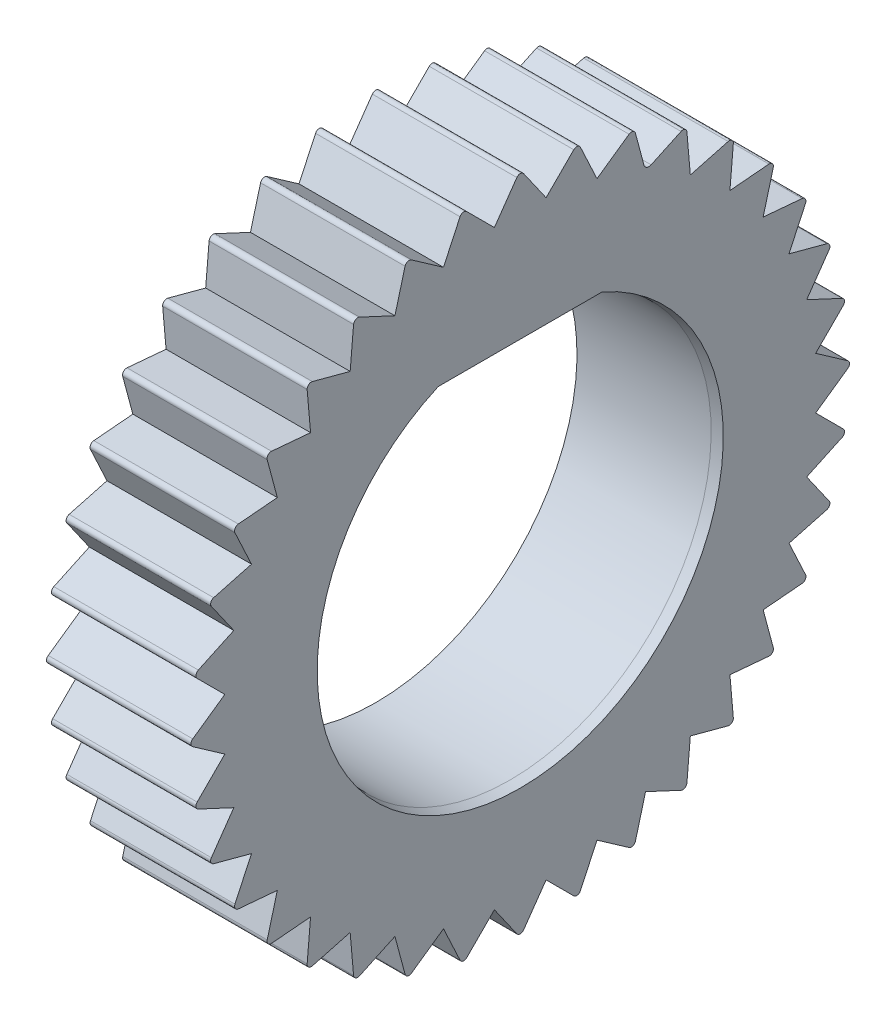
ISO-10303-21;
HEADER;
FILE_DESCRIPTION(('STEP AP214'),'2;1');
FILE_NAME('part.step','',(''),(''),'','','');
FILE_SCHEMA(('AUTOMOTIVE_DESIGN { 1 0 10303 214 1 1 1 1 }'));
ENDSEC;
DATA;
#1=APPLICATION_CONTEXT('core data for automotive mechanical design processes');
#2=APPLICATION_PROTOCOL_DEFINITION('international standard','automotive_design',2000,#1);
#3=PRODUCT_CONTEXT('',#1,'mechanical');
#4=PRODUCT('Part','Part','',(#3));
#5=PRODUCT_RELATED_PRODUCT_CATEGORY('part','',(#4));
#6=PRODUCT_DEFINITION_FORMATION('','',#4);
#7=PRODUCT_DEFINITION_CONTEXT('part definition',#1,'design');
#8=PRODUCT_DEFINITION('design','',#6,#7);
#9=PRODUCT_DEFINITION_SHAPE('','',#8);
#10=(LENGTH_UNIT() NAMED_UNIT(*) SI_UNIT(.MILLI.,.METRE.));
#11=(NAMED_UNIT(*) PLANE_ANGLE_UNIT() SI_UNIT($,.RADIAN.));
#12=(NAMED_UNIT(*) SI_UNIT($,.STERADIAN.) SOLID_ANGLE_UNIT());
#13=UNCERTAINTY_MEASURE_WITH_UNIT(LENGTH_MEASURE(1.E-05),#10,'distance_accuracy_value','');
#14=(GEOMETRIC_REPRESENTATION_CONTEXT(3) GLOBAL_UNCERTAINTY_ASSIGNED_CONTEXT((#13)) GLOBAL_UNIT_ASSIGNED_CONTEXT((#10,
#11,#12)) REPRESENTATION_CONTEXT('',''));
#15=CARTESIAN_POINT('',(0.,0.,0.));
#16=DIRECTION('',(0.,0.,1.));
#17=DIRECTION('',(1.,0.,0.));
#18=AXIS2_PLACEMENT_3D('',#15,#16,#17);
#19=CARTESIAN_POINT('',(-20.,28.25,0.));
#20=DIRECTION('',(1.,0.,0.));
#21=DIRECTION('',(0.,0.,-1.));
#22=AXIS2_PLACEMENT_3D('',#19,#20,#21);
#23=PLANE('',#22);
#24=DIRECTION('',(0.,0.,1.));
#25=VECTOR('',#24,1.);
#26=CARTESIAN_POINT('',(-20.,18.,-8.90230426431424));
#27=LINE('',#26,#25);
#28=CARTESIAN_POINT('',(-20.,18.,-7.5));
#29=VERTEX_POINT('',#28);
#30=CARTESIAN_POINT('',(-20.,18.,7.5));
#31=VERTEX_POINT('',#30);
#32=EDGE_CURVE('E729',#29,#31,#27,.T.);
#33=ORIENTED_EDGE('',*,*,#32,.T.);
#34=CARTESIAN_POINT('',(-20.,0.,0.));
#35=DIRECTION('',(-1.,0.,0.));
#36=DIRECTION('',(0.,0.,1.));
#37=AXIS2_PLACEMENT_3D('',#34,#35,#36);
#38=CIRCLE('',#37,19.5);
#39=EDGE_CURVE('E1518',#29,#31,#38,.T.);
#40=ORIENTED_EDGE('',*,*,#39,.F.);
#41=EDGE_LOOP('',(#33,#40));
#42=FACE_BOUND('',#41,.T.);
#43=CARTESIAN_POINT('',(-20.,26.7458462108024,-12.4717929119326));
#44=DIRECTION('',(1.,0.,0.));
#45=DIRECTION('',(0.,0.,-1.));
#46=AXIS2_PLACEMENT_3D('',#43,#44,#45);
#47=CIRCLE('',#46,0.5);
#48=CARTESIAN_POINT('',(-20.,26.6164366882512,-11.9888299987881));
#49=VERTEX_POINT('',#48);
#50=CARTESIAN_POINT('',(-20.,26.2926923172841,-12.683102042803));
#51=VERTEX_POINT('',#50);
#52=EDGE_CURVE('E58',#49,#51,#47,.T.);
#53=ORIENTED_EDGE('',*,*,#52,.T.);
#54=DIRECTION('',(0.,0.42261826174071,-0.906307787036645));
#55=VECTOR('',#54,1.);
#56=CARTESIAN_POINT('',(-20.,27.644593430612,-15.5822633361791));
#57=LINE('',#56,#55);
#58=CARTESIAN_POINT('',(-20.,27.644593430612,-15.5822633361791));
#59=VERTEX_POINT('',#58);
#60=EDGE_CURVE('E776',#51,#59,#57,.T.);
#61=ORIENTED_EDGE('',*,*,#60,.T.);
#62=CARTESIAN_POINT('',(-20.,27.2820703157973,-15.7513106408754));
#63=DIRECTION('',(-1.,0.,0.));
#64=DIRECTION('',(0.,0.499999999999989,0.866025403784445));
#65=AXIS2_PLACEMENT_3D('',#62,#63,#64);
#66=CIRCLE('',#65,0.400000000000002);
#67=CARTESIAN_POINT('',(-20.,27.3169326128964,-16.1497885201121));
#68=VERTEX_POINT('',#67);
#69=EDGE_CURVE('E786',#59,#68,#66,.T.);
#70=ORIENTED_EDGE('',*,*,#69,.T.);
#71=DIRECTION('',(0.,-0.996194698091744,-0.0871557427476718));
#72=VECTOR('',#71,1.);
#73=CARTESIAN_POINT('',(-20.,27.3169326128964,-16.1497885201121));
#74=LINE('',#73,#72);
#75=CARTESIAN_POINT('',(-20.,23.5366254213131,-16.4805225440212));
#76=VERTEX_POINT('',#75);
#77=EDGE_CURVE('E781',#68,#76,#74,.T.);
#78=ORIENTED_EDGE('',*,*,#77,.T.);
#79=DIRECTION('',(0.,0.258819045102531,-0.965925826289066));
#80=VECTOR('',#79,1.);
#81=CARTESIAN_POINT('',(-20.,24.5187783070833,-20.1459670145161));
#82=LINE('',#81,#80);
#83=CARTESIAN_POINT('',(-20.,24.5187783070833,-20.1459670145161));
#84=VERTEX_POINT('',#83);
#85=EDGE_CURVE('E801',#76,#84,#82,.T.);
#86=ORIENTED_EDGE('',*,*,#85,.T.);
#87=CARTESIAN_POINT('',(-20.,24.1324079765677,-20.2494946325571));
#88=DIRECTION('',(-1.,0.,0.));
#89=DIRECTION('',(0.,0.64278760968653,0.766044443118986));
#90=AXIS2_PLACEMENT_3D('',#87,#88,#89);
#91=CIRCLE('',#90,0.400000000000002);
#92=CARTESIAN_POINT('',(-20.,24.0975456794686,-20.6479725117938));
#93=VERTEX_POINT('',#92);
#94=EDGE_CURVE('E796',#84,#93,#91,.T.);
#95=ORIENTED_EDGE('',*,*,#94,.T.);
#96=DIRECTION('',(0.,-0.996194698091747,0.0871557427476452));
#97=VECTOR('',#96,1.);
#98=CARTESIAN_POINT('',(-20.,24.0975456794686,-20.6479725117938));
#99=LINE('',#98,#97);
#100=CARTESIAN_POINT('',(-20.,20.3172384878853,-20.3172384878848));
#101=VERTEX_POINT('',#100);
#102=EDGE_CURVE('E808',#93,#101,#99,.T.);
#103=ORIENTED_EDGE('',*,*,#102,.T.);
#104=DIRECTION('',(0.,0.0871557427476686,-0.996194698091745));
#105=VECTOR('',#104,1.);
#106=CARTESIAN_POINT('',(-20.,20.6479725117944,-24.0975456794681));
#107=LINE('',#106,#105);
#108=CARTESIAN_POINT('',(-20.,20.6479725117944,-24.0975456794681));
#109=VERTEX_POINT('',#108);
#110=EDGE_CURVE('E823',#101,#109,#107,.T.);
#111=ORIENTED_EDGE('',*,*,#110,.T.);
#112=CARTESIAN_POINT('',(-20.,20.2494946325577,-24.1324079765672));
#113=DIRECTION('',(-1.,0.,0.));
#114=DIRECTION('',(0.,0.766044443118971,0.642787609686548));
#115=AXIS2_PLACEMENT_3D('',#112,#113,#114);
#116=CIRCLE('',#115,0.400000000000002);
#117=CARTESIAN_POINT('',(-20.,20.1459670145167,-24.5187783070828));
#118=VERTEX_POINT('',#117);
#119=EDGE_CURVE('E818',#109,#118,#116,.T.);
#120=ORIENTED_EDGE('',*,*,#119,.T.);
#121=DIRECTION('',(0.,-0.965925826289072,0.258819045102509));
#122=VECTOR('',#121,1.);
#123=CARTESIAN_POINT('',(-20.,20.1459670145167,-24.5187783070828));
#124=LINE('',#123,#122);
#125=CARTESIAN_POINT('',(-20.,16.4805225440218,-23.5366254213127));
#126=VERTEX_POINT('',#125);
#127=EDGE_CURVE('E830',#118,#126,#124,.T.);
#128=ORIENTED_EDGE('',*,*,#127,.T.);
#129=DIRECTION('',(0.,-0.0871557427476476,-0.996194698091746));
#130=VECTOR('',#129,1.);
#131=CARTESIAN_POINT('',(-20.,16.1497885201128,-27.316932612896));
#132=LINE('',#131,#130);
#133=CARTESIAN_POINT('',(-20.,16.1497885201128,-27.316932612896));
#134=VERTEX_POINT('',#133);
#135=EDGE_CURVE('E845',#126,#134,#132,.T.);
#136=ORIENTED_EDGE('',*,*,#135,.T.);
#137=CARTESIAN_POINT('',(-20.,15.7513106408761,-27.282070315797));
#138=DIRECTION('',(-1.,0.,0.));
#139=DIRECTION('',(0.,0.866025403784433,0.50000000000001));
#140=AXIS2_PLACEMENT_3D('',#137,#138,#139);
#141=CIRCLE('',#140,0.400000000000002);
#142=CARTESIAN_POINT('',(-20.,15.5822633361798,-27.6445934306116));
#143=VERTEX_POINT('',#142);
#144=EDGE_CURVE('E840',#134,#143,#141,.T.);
#145=ORIENTED_EDGE('',*,*,#144,.T.);
#146=DIRECTION('',(0.,-0.906307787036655,0.422618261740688));
#147=VECTOR('',#146,1.);
#148=CARTESIAN_POINT('',(-20.,15.5822633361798,-27.6445934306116));
#149=LINE('',#148,#147);
#150=CARTESIAN_POINT('',(-20.,12.1430542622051,-26.0408639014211));
#151=VERTEX_POINT('',#150);
#152=EDGE_CURVE('E852',#143,#151,#149,.T.);
#153=ORIENTED_EDGE('',*,*,#152,.T.);
#154=DIRECTION('',(0.,-0.258819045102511,-0.965925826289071));
#155=VECTOR('',#154,1.);
#156=CARTESIAN_POINT('',(-20.,11.1609013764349,-29.7063083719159));
#157=LINE('',#156,#155);
#158=CARTESIAN_POINT('',(-20.,11.1609013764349,-29.7063083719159));
#159=VERTEX_POINT('',#158);
#160=EDGE_CURVE('E867',#151,#159,#157,.T.);
#161=ORIENTED_EDGE('',*,*,#160,.T.);
#162=CARTESIAN_POINT('',(-20.,10.7745310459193,-29.6027807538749));
#163=DIRECTION('',(-1.,0.,0.));
#164=DIRECTION('',(0.,0.939692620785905,0.342020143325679));
#165=AXIS2_PLACEMENT_3D('',#162,#163,#164);
#166=CIRCLE('',#165,0.400000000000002);
#167=CARTESIAN_POINT('',(-20.,10.5451004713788,-29.9304415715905));
#168=VERTEX_POINT('',#167);
#169=EDGE_CURVE('E862',#159,#168,#166,.T.);
#170=ORIENTED_EDGE('',*,*,#169,.T.);
#171=DIRECTION('',(0.,-0.819152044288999,0.573576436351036));
#172=VECTOR('',#171,1.);
#173=CARTESIAN_POINT('',(-20.,10.5451004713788,-29.9304415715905));
#174=LINE('',#173,#172);
#175=CARTESIAN_POINT('',(-20.,7.43662542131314,-27.7538639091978));
#176=VERTEX_POINT('',#175);
#177=EDGE_CURVE('E874',#168,#176,#174,.T.);
#178=ORIENTED_EDGE('',*,*,#177,.T.);
#179=DIRECTION('',(0.,-0.422618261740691,-0.906307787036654));
#180=VECTOR('',#179,1.);
#181=CARTESIAN_POINT('',(-20.,5.8328958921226,-31.1930729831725));
#182=LINE('',#181,#180);
#183=CARTESIAN_POINT('',(-20.,5.8328958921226,-31.1930729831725));
#184=VERTEX_POINT('',#183);
#185=EDGE_CURVE('E889',#176,#184,#182,.T.);
#186=ORIENTED_EDGE('',*,*,#185,.T.);
#187=CARTESIAN_POINT('',(-20.,5.47037277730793,-31.0240256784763));
#188=DIRECTION('',(-1.,0.,0.));
#189=DIRECTION('',(0.,0.984807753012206,0.17364817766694));
#190=AXIS2_PLACEMENT_3D('',#187,#188,#189);
#191=CIRCLE('',#190,0.400000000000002);
#192=CARTESIAN_POINT('',(-20.,5.18753006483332,-31.3068683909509));
#193=VERTEX_POINT('',#192);
#194=EDGE_CURVE('E884',#184,#193,#191,.T.);
#195=ORIENTED_EDGE('',*,*,#194,.T.);
#196=DIRECTION('',(0.,-0.707106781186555,0.70710678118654));
#197=VECTOR('',#196,1.);
#198=CARTESIAN_POINT('',(-20.,5.18753006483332,-31.3068683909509));
#199=LINE('',#198,#197);
#200=CARTESIAN_POINT('',(-20.,2.50423848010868,-28.6235768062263));
#201=VERTEX_POINT('',#200);
#202=EDGE_CURVE('E896',#193,#201,#199,.T.);
#203=ORIENTED_EDGE('',*,*,#202,.T.);
#204=DIRECTION('',(0.,-0.573576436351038,-0.819152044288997));
#205=VECTOR('',#204,1.);
#206=CARTESIAN_POINT('',(-20.,0.327660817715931,-31.732051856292));
#207=LINE('',#206,#205);
#208=CARTESIAN_POINT('',(-20.,0.327660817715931,-31.732051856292));
#209=VERTEX_POINT('',#208);
#210=EDGE_CURVE('E911',#201,#209,#207,.T.);
#211=ORIENTED_EDGE('',*,*,#210,.T.);
#212=CARTESIAN_POINT('',(-20.,3.30114411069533E-13,-31.5026212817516));
#213=DIRECTION('',(-1.,0.,0.));
#214=DIRECTION('',(0.,1.,0.));
#215=AXIS2_PLACEMENT_3D('',#212,#213,#214);
#216=CIRCLE('',#215,0.400000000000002);
#217=CARTESIAN_POINT('',(-20.,-0.327660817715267,-31.732051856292));
#218=VERTEX_POINT('',#217);
#219=EDGE_CURVE('E906',#209,#218,#216,.T.);
#220=ORIENTED_EDGE('',*,*,#219,.T.);
#221=DIRECTION('',(0.,-0.573576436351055,0.819152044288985));
#222=VECTOR('',#221,1.);
#223=CARTESIAN_POINT('',(-20.,-0.327660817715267,-31.732051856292));
#224=LINE('',#223,#222);
#225=CARTESIAN_POINT('',(-20.,-2.50423848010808,-28.6235768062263));
#226=VERTEX_POINT('',#225);
#227=EDGE_CURVE('E918',#218,#226,#224,.T.);
#228=ORIENTED_EDGE('',*,*,#227,.T.);
#229=DIRECTION('',(0.,-0.707106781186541,-0.707106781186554));
#230=VECTOR('',#229,1.);
#231=CARTESIAN_POINT('',(-20.,-5.18753006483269,-31.306868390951));
#232=LINE('',#231,#230);
#233=CARTESIAN_POINT('',(-20.,-5.18753006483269,-31.306868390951));
#234=VERTEX_POINT('',#233);
#235=EDGE_CURVE('E933',#226,#234,#232,.T.);
#236=ORIENTED_EDGE('',*,*,#235,.T.);
#237=CARTESIAN_POINT('',(-20.,-5.47037277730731,-31.0240256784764));
#238=DIRECTION('',(-1.,0.,0.));
#239=DIRECTION('',(0.,0.98480775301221,-0.173648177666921));
#240=AXIS2_PLACEMENT_3D('',#237,#238,#239);
#241=CIRCLE('',#240,0.400000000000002);
#242=CARTESIAN_POINT('',(-20.,-5.83289589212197,-31.1930729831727));
#243=VERTEX_POINT('',#242);
#244=EDGE_CURVE('E928',#234,#243,#241,.T.);
#245=ORIENTED_EDGE('',*,*,#244,.T.);
#246=DIRECTION('',(0.,-0.422618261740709,0.906307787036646));
#247=VECTOR('',#246,1.);
#248=CARTESIAN_POINT('',(-20.,-5.83289589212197,-31.1930729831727));
#249=LINE('',#248,#247);
#250=CARTESIAN_POINT('',(-20.,-7.43662542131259,-27.7538639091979));
#251=VERTEX_POINT('',#250);
#252=EDGE_CURVE('E940',#243,#251,#249,.T.);
#253=ORIENTED_EDGE('',*,*,#252,.T.);
#254=DIRECTION('',(0.,-0.819152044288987,-0.573576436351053));
#255=VECTOR('',#254,1.);
#256=CARTESIAN_POINT('',(-20.,-10.5451004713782,-29.9304415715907));
#257=LINE('',#256,#255);
#258=CARTESIAN_POINT('',(-20.,-10.5451004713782,-29.9304415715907));
#259=VERTEX_POINT('',#258);
#260=EDGE_CURVE('E955',#251,#259,#257,.T.);
#261=ORIENTED_EDGE('',*,*,#260,.T.);
#262=CARTESIAN_POINT('',(-20.,-10.7745310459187,-29.6027807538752));
#263=DIRECTION('',(-1.,0.,0.));
#264=DIRECTION('',(0.,0.939692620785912,-0.34202014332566));
#265=AXIS2_PLACEMENT_3D('',#262,#263,#264);
#266=CIRCLE('',#265,0.400000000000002);
#267=CARTESIAN_POINT('',(-20.,-11.1609013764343,-29.7063083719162));
#268=VERTEX_POINT('',#267);
#269=EDGE_CURVE('E950',#259,#268,#266,.T.);
#270=ORIENTED_EDGE('',*,*,#269,.T.);
#271=DIRECTION('',(0.,-0.25881904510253,0.965925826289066));
#272=VECTOR('',#271,1.);
#273=CARTESIAN_POINT('',(-20.,-11.1609013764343,-29.7063083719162));
#274=LINE('',#273,#272);
#275=CARTESIAN_POINT('',(-20.,-12.1430542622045,-26.0408639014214));
#276=VERTEX_POINT('',#275);
#277=EDGE_CURVE('E962',#268,#276,#274,.T.);
#278=ORIENTED_EDGE('',*,*,#277,.T.);
#279=DIRECTION('',(0.,-0.906307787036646,-0.422618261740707));
#280=VECTOR('',#279,1.);
#281=CARTESIAN_POINT('',(-20.,-15.5822633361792,-27.644593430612));
#282=LINE('',#281,#280);
#283=CARTESIAN_POINT('',(-20.,-15.5822633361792,-27.644593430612));
#284=VERTEX_POINT('',#283);
#285=EDGE_CURVE('E977',#276,#284,#282,.T.);
#286=ORIENTED_EDGE('',*,*,#285,.T.);
#287=CARTESIAN_POINT('',(-20.,-15.7513106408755,-27.2820703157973));
#288=DIRECTION('',(-1.,0.,0.));
#289=DIRECTION('',(0.,0.866025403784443,-0.499999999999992));
#290=AXIS2_PLACEMENT_3D('',#287,#288,#289);
#291=CIRCLE('',#290,0.400000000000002);
#292=CARTESIAN_POINT('',(-20.,-16.1497885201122,-27.3169326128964));
#293=VERTEX_POINT('',#292);
#294=EDGE_CURVE('E972',#284,#293,#291,.T.);
#295=ORIENTED_EDGE('',*,*,#294,.T.);
#296=DIRECTION('',(0.,-0.0871557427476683,0.996194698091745));
#297=VECTOR('',#296,1.);
#298=CARTESIAN_POINT('',(-20.,-16.1497885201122,-27.3169326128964));
#299=LINE('',#298,#297);
#300=CARTESIAN_POINT('',(-20.,-16.4805225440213,-23.536625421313));
#301=VERTEX_POINT('',#300);
#302=EDGE_CURVE('E984',#293,#301,#299,.T.);
#303=ORIENTED_EDGE('',*,*,#302,.T.);
#304=DIRECTION('',(0.,-0.965925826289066,-0.258819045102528));
#305=VECTOR('',#304,1.);
#306=CARTESIAN_POINT('',(-20.,-20.1459670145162,-24.5187783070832));
#307=LINE('',#306,#305);
#308=CARTESIAN_POINT('',(-20.,-20.1459670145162,-24.5187783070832));
#309=VERTEX_POINT('',#308);
#310=EDGE_CURVE('E999',#301,#309,#307,.T.);
#311=ORIENTED_EDGE('',*,*,#310,.T.);
#312=CARTESIAN_POINT('',(-20.,-20.2494946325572,-24.1324079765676));
#313=DIRECTION('',(-1.,0.,0.));
#314=DIRECTION('',(0.,0.766044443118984,-0.642787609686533));
#315=AXIS2_PLACEMENT_3D('',#312,#313,#314);
#316=CIRCLE('',#315,0.400000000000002);
#317=CARTESIAN_POINT('',(-20.,-20.6479725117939,-24.0975456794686));
#318=VERTEX_POINT('',#317);
#319=EDGE_CURVE('E994',#309,#318,#316,.T.);
#320=ORIENTED_EDGE('',*,*,#319,.T.);
#321=DIRECTION('',(0.,0.0871557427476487,0.996194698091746));
#322=VECTOR('',#321,1.);
#323=CARTESIAN_POINT('',(-20.,-20.6479725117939,-24.0975456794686));
#324=LINE('',#323,#322);
#325=CARTESIAN_POINT('',(-20.,-20.3172384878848,-20.3172384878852));
#326=VERTEX_POINT('',#325);
#327=EDGE_CURVE('E1006',#318,#326,#324,.T.);
#328=ORIENTED_EDGE('',*,*,#327,.T.);
#329=DIRECTION('',(0.,-0.996194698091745,-0.0871557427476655));
#330=VECTOR('',#329,1.);
#331=CARTESIAN_POINT('',(-20.,-24.0975456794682,-20.6479725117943));
#332=LINE('',#331,#330);
#333=CARTESIAN_POINT('',(-20.,-24.0975456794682,-20.6479725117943));
#334=VERTEX_POINT('',#333);
#335=EDGE_CURVE('E1021',#326,#334,#332,.T.);
#336=ORIENTED_EDGE('',*,*,#335,.T.);
#337=CARTESIAN_POINT('',(-20.,-24.1324079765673,-20.2494946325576));
#338=DIRECTION('',(-1.,0.,0.));
#339=DIRECTION('',(0.,0.642787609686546,-0.766044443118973));
#340=AXIS2_PLACEMENT_3D('',#337,#338,#339);
#341=CIRCLE('',#340,0.400000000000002);
#342=CARTESIAN_POINT('',(-20.,-24.5187783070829,-20.1459670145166));
#343=VERTEX_POINT('',#342);
#344=EDGE_CURVE('E1016',#334,#343,#341,.T.);
#345=ORIENTED_EDGE('',*,*,#344,.T.);
#346=DIRECTION('',(0.,0.258819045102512,0.965925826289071));
#347=VECTOR('',#346,1.);
#348=CARTESIAN_POINT('',(-20.,-24.5187783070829,-20.1459670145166));
#349=LINE('',#348,#347);
#350=CARTESIAN_POINT('',(-20.,-23.5366254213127,-16.4805225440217));
#351=VERTEX_POINT('',#350);
#352=EDGE_CURVE('E1028',#343,#351,#349,.T.);
#353=ORIENTED_EDGE('',*,*,#352,.T.);
#354=DIRECTION('',(0.,-0.996194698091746,0.0871557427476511));
#355=VECTOR('',#354,1.);
#356=CARTESIAN_POINT('',(-20.,-27.3169326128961,-16.1497885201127));
#357=LINE('',#356,#355);
#358=CARTESIAN_POINT('',(-20.,-27.3169326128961,-16.1497885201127));
#359=VERTEX_POINT('',#358);
#360=EDGE_CURVE('E1043',#351,#359,#357,.T.);
#361=ORIENTED_EDGE('',*,*,#360,.T.);
#362=CARTESIAN_POINT('',(-20.,-27.282070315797,-15.751310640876));
#363=DIRECTION('',(-1.,0.,0.));
#364=DIRECTION('',(0.,0.500000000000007,-0.866025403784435));
#365=AXIS2_PLACEMENT_3D('',#362,#363,#364);
#366=CIRCLE('',#365,0.400000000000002);
#367=CARTESIAN_POINT('',(-20.,-27.6445934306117,-15.5822633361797));
#368=VERTEX_POINT('',#367);
#369=EDGE_CURVE('E1038',#359,#368,#366,.T.);
#370=ORIENTED_EDGE('',*,*,#369,.T.);
#371=DIRECTION('',(0.,0.422618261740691,0.906307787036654));
#372=VECTOR('',#371,1.);
#373=CARTESIAN_POINT('',(-20.,-27.6445934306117,-15.5822633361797));
#374=LINE('',#373,#372);
#375=CARTESIAN_POINT('',(-20.,-26.0408639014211,-12.143054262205));
#376=VERTEX_POINT('',#375);
#377=EDGE_CURVE('E1050',#368,#376,#374,.T.);
#378=ORIENTED_EDGE('',*,*,#377,.T.);
#379=DIRECTION('',(0.,-0.96592582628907,0.258819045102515));
#380=VECTOR('',#379,1.);
#381=CARTESIAN_POINT('',(-20.,-29.706308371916,-11.1609013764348));
#382=LINE('',#381,#380);
#383=CARTESIAN_POINT('',(-20.,-29.706308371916,-11.1609013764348));
#384=VERTEX_POINT('',#383);
#385=EDGE_CURVE('E1065',#376,#384,#382,.T.);
#386=ORIENTED_EDGE('',*,*,#385,.T.);
#387=CARTESIAN_POINT('',(-20.,-29.602780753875,-10.7745310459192));
#388=DIRECTION('',(-1.,0.,0.));
#389=DIRECTION('',(0.,0.342020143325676,-0.939692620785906));
#390=AXIS2_PLACEMENT_3D('',#387,#388,#389);
#391=CIRCLE('',#390,0.400000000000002);
#392=CARTESIAN_POINT('',(-20.,-29.9304415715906,-10.5451004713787));
#393=VERTEX_POINT('',#392);
#394=EDGE_CURVE('E1060',#384,#393,#391,.T.);
#395=ORIENTED_EDGE('',*,*,#394,.T.);
#396=DIRECTION('',(0.,0.573576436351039,0.819152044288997));
#397=VECTOR('',#396,1.);
#398=CARTESIAN_POINT('',(-20.,-29.9304415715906,-10.5451004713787));
#399=LINE('',#398,#397);
#400=CARTESIAN_POINT('',(-20.,-27.7538639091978,-7.43662542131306));
#401=VERTEX_POINT('',#400);
#402=EDGE_CURVE('E1072',#393,#401,#399,.T.);
#403=ORIENTED_EDGE('',*,*,#402,.T.);
#404=DIRECTION('',(0.,-0.906307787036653,0.422618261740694));
#405=VECTOR('',#404,1.);
#406=CARTESIAN_POINT('',(-20.,-31.1930729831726,-5.8328958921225));
#407=LINE('',#406,#405);
#408=CARTESIAN_POINT('',(-20.,-31.1930729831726,-5.8328958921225));
#409=VERTEX_POINT('',#408);
#410=EDGE_CURVE('E1087',#401,#409,#407,.T.);
#411=ORIENTED_EDGE('',*,*,#410,.T.);
#412=CARTESIAN_POINT('',(-20.,-31.0240256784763,-5.47037277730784));
#413=DIRECTION('',(-1.,0.,0.));
#414=DIRECTION('',(0.,0.173648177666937,-0.984807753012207));
#415=AXIS2_PLACEMENT_3D('',#412,#413,#414);
#416=CIRCLE('',#415,0.400000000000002);
#417=CARTESIAN_POINT('',(-20.,-31.3068683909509,-5.18753006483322));
#418=VERTEX_POINT('',#417);
#419=EDGE_CURVE('E1082',#409,#418,#416,.T.);
#420=ORIENTED_EDGE('',*,*,#419,.T.);
#421=DIRECTION('',(0.,0.707106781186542,0.707106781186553));
#422=VECTOR('',#421,1.);
#423=CARTESIAN_POINT('',(-20.,-31.3068683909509,-5.18753006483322));
#424=LINE('',#423,#422);
#425=CARTESIAN_POINT('',(-20.,-28.6235768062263,-2.50423848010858));
#426=VERTEX_POINT('',#425);
#427=EDGE_CURVE('E1094',#418,#426,#424,.T.);
#428=ORIENTED_EDGE('',*,*,#427,.T.);
#429=DIRECTION('',(0.,-0.819152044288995,0.573576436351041));
#430=VECTOR('',#429,1.);
#431=CARTESIAN_POINT('',(-20.,-31.732051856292,-0.327660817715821));
#432=LINE('',#431,#430);
#433=CARTESIAN_POINT('',(-20.,-31.732051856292,-0.327660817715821));
#434=VERTEX_POINT('',#433);
#435=EDGE_CURVE('E1109',#426,#434,#432,.T.);
#436=ORIENTED_EDGE('',*,*,#435,.T.);
#437=CARTESIAN_POINT('',(-20.,-31.5026212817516,-2.20123533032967E-13));
#438=DIRECTION('',(-1.,0.,0.));
#439=DIRECTION('',(0.,0.,-1.));
#440=AXIS2_PLACEMENT_3D('',#437,#438,#439);
#441=CIRCLE('',#440,0.400000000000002);
#442=CARTESIAN_POINT('',(-20.,-31.732051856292,0.327660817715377));
#443=VERTEX_POINT('',#442);
#444=EDGE_CURVE('E1104',#434,#443,#441,.T.);
#445=ORIENTED_EDGE('',*,*,#444,.T.);
#446=DIRECTION('',(0.,0.819152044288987,0.573576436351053));
#447=VECTOR('',#446,1.);
#448=CARTESIAN_POINT('',(-20.,-31.732051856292,0.327660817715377));
#449=LINE('',#448,#447);
#450=CARTESIAN_POINT('',(-20.,-28.6235768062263,2.50423848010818));
#451=VERTEX_POINT('',#450);
#452=EDGE_CURVE('E1116',#443,#451,#449,.T.);
#453=ORIENTED_EDGE('',*,*,#452,.T.);
#454=DIRECTION('',(0.,-0.707106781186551,0.707106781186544));
#455=VECTOR('',#454,1.);
#456=CARTESIAN_POINT('',(-20.,-31.306868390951,5.1875300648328));
#457=LINE('',#456,#455);
#458=CARTESIAN_POINT('',(-20.,-31.306868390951,5.1875300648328));
#459=VERTEX_POINT('',#458);
#460=EDGE_CURVE('E1131',#451,#459,#457,.T.);
#461=ORIENTED_EDGE('',*,*,#460,.T.);
#462=CARTESIAN_POINT('',(-20.,-31.0240256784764,5.47037277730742));
#463=DIRECTION('',(-1.,0.,0.));
#464=DIRECTION('',(0.,-0.173648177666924,-0.984807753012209));
#465=AXIS2_PLACEMENT_3D('',#462,#463,#464);
#466=CIRCLE('',#465,0.400000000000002);
#467=CARTESIAN_POINT('',(-20.,-31.1930729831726,5.83289589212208));
#468=VERTEX_POINT('',#467);
#469=EDGE_CURVE('E1126',#459,#468,#466,.T.);
#470=ORIENTED_EDGE('',*,*,#469,.T.);
#471=DIRECTION('',(0.,0.906307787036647,0.422618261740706));
#472=VECTOR('',#471,1.);
#473=CARTESIAN_POINT('',(-20.,-31.1930729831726,5.83289589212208));
#474=LINE('',#473,#472);
#475=CARTESIAN_POINT('',(-20.,-27.7538639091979,7.43662542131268));
#476=VERTEX_POINT('',#475);
#477=EDGE_CURVE('E1138',#468,#476,#474,.T.);
#478=ORIENTED_EDGE('',*,*,#477,.T.);
#479=DIRECTION('',(0.,-0.57357643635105,0.819152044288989));
#480=VECTOR('',#479,1.);
#481=CARTESIAN_POINT('',(-20.,-29.9304415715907,10.5451004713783));
#482=LINE('',#481,#480);
#483=CARTESIAN_POINT('',(-20.,-29.9304415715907,10.5451004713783));
#484=VERTEX_POINT('',#483);
#485=EDGE_CURVE('E1153',#476,#484,#482,.T.);
#486=ORIENTED_EDGE('',*,*,#485,.T.);
#487=CARTESIAN_POINT('',(-20.,-29.6027807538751,10.7745310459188));
#488=DIRECTION('',(-1.,0.,0.));
#489=DIRECTION('',(0.,-0.342020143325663,-0.939692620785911));
#490=AXIS2_PLACEMENT_3D('',#487,#488,#489);
#491=CIRCLE('',#490,0.400000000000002);
#492=CARTESIAN_POINT('',(-20.,-29.7063083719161,11.1609013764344));
#493=VERTEX_POINT('',#492);
#494=EDGE_CURVE('E1148',#484,#493,#491,.T.);
#495=ORIENTED_EDGE('',*,*,#494,.T.);
#496=DIRECTION('',(0.,0.965925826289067,0.258819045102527));
#497=VECTOR('',#496,1.);
#498=CARTESIAN_POINT('',(-20.,-29.7063083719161,11.1609013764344));
#499=LINE('',#498,#497);
#500=CARTESIAN_POINT('',(-20.,-26.0408639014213,12.1430542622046));
#501=VERTEX_POINT('',#500);
#502=EDGE_CURVE('E1160',#493,#501,#499,.T.);
#503=ORIENTED_EDGE('',*,*,#502,.T.);
#504=DIRECTION('',(0.,-0.422618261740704,0.906307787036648));
#505=VECTOR('',#504,1.);
#506=CARTESIAN_POINT('',(-20.,-27.6445934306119,15.5822633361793));
#507=LINE('',#506,#505);
#508=CARTESIAN_POINT('',(-20.,-27.6445934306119,15.5822633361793));
#509=VERTEX_POINT('',#508);
#510=EDGE_CURVE('E1175',#501,#509,#507,.T.);
#511=ORIENTED_EDGE('',*,*,#510,.T.);
#512=CARTESIAN_POINT('',(-20.,-27.2820703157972,15.7513106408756));
#513=DIRECTION('',(-1.,0.,0.));
#514=DIRECTION('',(0.,-0.499999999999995,-0.866025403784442));
#515=AXIS2_PLACEMENT_3D('',#512,#513,#514);
#516=CIRCLE('',#515,0.400000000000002);
#517=CARTESIAN_POINT('',(-20.,-27.3169326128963,16.1497885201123));
#518=VERTEX_POINT('',#517);
#519=EDGE_CURVE('E1170',#509,#518,#516,.T.);
#520=ORIENTED_EDGE('',*,*,#519,.T.);
#521=DIRECTION('',(0.,0.996194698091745,0.0871557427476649));
#522=VECTOR('',#521,1.);
#523=CARTESIAN_POINT('',(-20.,-27.3169326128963,16.1497885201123));
#524=LINE('',#523,#522);
#525=CARTESIAN_POINT('',(-20.,-23.5366254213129,16.4805225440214));
#526=VERTEX_POINT('',#525);
#527=EDGE_CURVE('E1182',#518,#526,#524,.T.);
#528=ORIENTED_EDGE('',*,*,#527,.T.);
#529=DIRECTION('',(0.,-0.258819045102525,0.965925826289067));
#530=VECTOR('',#529,1.);
#531=CARTESIAN_POINT('',(-20.,-24.5187783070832,20.1459670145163));
#532=LINE('',#531,#530);
#533=CARTESIAN_POINT('',(-20.,-24.5187783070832,20.1459670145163));
#534=VERTEX_POINT('',#533);
#535=EDGE_CURVE('E1197',#526,#534,#532,.T.);
#536=ORIENTED_EDGE('',*,*,#535,.T.);
#537=CARTESIAN_POINT('',(-20.,-24.1324079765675,20.2494946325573));
#538=DIRECTION('',(-1.,0.,0.));
#539=DIRECTION('',(0.,-0.642787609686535,-0.766044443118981));
#540=AXIS2_PLACEMENT_3D('',#537,#538,#539);
#541=CIRCLE('',#540,0.400000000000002);
#542=CARTESIAN_POINT('',(-20.,-24.0975456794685,20.647972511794));
#543=VERTEX_POINT('',#542);
#544=EDGE_CURVE('E1192',#534,#543,#541,.T.);
#545=ORIENTED_EDGE('',*,*,#544,.T.);
#546=DIRECTION('',(0.,0.996194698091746,-0.0871557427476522));
#547=VECTOR('',#546,1.);
#548=CARTESIAN_POINT('',(-20.,-24.0975456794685,20.647972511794));
#549=LINE('',#548,#547);
#550=CARTESIAN_POINT('',(-20.,-20.3172384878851,20.3172384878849));
#551=VERTEX_POINT('',#550);
#552=EDGE_CURVE('E1204',#543,#551,#549,.T.);
#553=ORIENTED_EDGE('',*,*,#552,.T.);
#554=DIRECTION('',(0.,-0.0871557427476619,0.996194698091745));
#555=VECTOR('',#554,1.);
#556=CARTESIAN_POINT('',(-20.,-20.6479725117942,24.0975456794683));
#557=LINE('',#556,#555);
#558=CARTESIAN_POINT('',(-20.,-20.6479725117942,24.0975456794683));
#559=VERTEX_POINT('',#558);
#560=EDGE_CURVE('E1219',#551,#559,#557,.T.);
#561=ORIENTED_EDGE('',*,*,#560,.T.);
#562=CARTESIAN_POINT('',(-20.,-20.2494946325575,24.1324079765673));
#563=DIRECTION('',(-1.,0.,0.));
#564=DIRECTION('',(0.,-0.766044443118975,-0.642787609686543));
#565=AXIS2_PLACEMENT_3D('',#562,#563,#564);
#566=CIRCLE('',#565,0.400000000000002);
#567=CARTESIAN_POINT('',(-20.,-20.1459670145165,24.518778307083));
#568=VERTEX_POINT('',#567);
#569=EDGE_CURVE('E1214',#559,#568,#566,.T.);
#570=ORIENTED_EDGE('',*,*,#569,.T.);
#571=DIRECTION('',(0.,0.96592582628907,-0.258819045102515));
#572=VECTOR('',#571,1.);
#573=CARTESIAN_POINT('',(-20.,-20.1459670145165,24.518778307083));
#574=LINE('',#573,#572);
#575=CARTESIAN_POINT('',(-20.,-16.4805225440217,23.5366254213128));
#576=VERTEX_POINT('',#575);
#577=EDGE_CURVE('E1226',#568,#576,#574,.T.);
#578=ORIENTED_EDGE('',*,*,#577,.T.);
#579=DIRECTION('',(0.,0.0871557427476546,0.996194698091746));
#580=VECTOR('',#579,1.);
#581=CARTESIAN_POINT('',(-20.,-16.1497885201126,27.3169326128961));
#582=LINE('',#581,#580);
#583=CARTESIAN_POINT('',(-20.,-16.1497885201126,27.3169326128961));
#584=VERTEX_POINT('',#583);
#585=EDGE_CURVE('E1241',#576,#584,#582,.T.);
#586=ORIENTED_EDGE('',*,*,#585,.T.);
#587=CARTESIAN_POINT('',(-20.,-15.7513106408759,27.2820703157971));
#588=DIRECTION('',(-1.,0.,0.));
#589=DIRECTION('',(0.,-0.866025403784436,-0.500000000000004));
#590=AXIS2_PLACEMENT_3D('',#587,#588,#589);
#591=CIRCLE('',#590,0.400000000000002);
#592=CARTESIAN_POINT('',(-20.,-15.5822633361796,27.6445934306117));
#593=VERTEX_POINT('',#592);
#594=EDGE_CURVE('E1236',#584,#593,#591,.T.);
#595=ORIENTED_EDGE('',*,*,#594,.T.);
#596=DIRECTION('',(0.,0.906307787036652,-0.422618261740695));
#597=VECTOR('',#596,1.);
#598=CARTESIAN_POINT('',(-20.,-15.5822633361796,27.6445934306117));
#599=LINE('',#598,#597);
#600=CARTESIAN_POINT('',(-20.,-12.1430542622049,26.0408639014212));
#601=VERTEX_POINT('',#600);
#602=EDGE_CURVE('E1248',#593,#601,#599,.T.);
#603=ORIENTED_EDGE('',*,*,#602,.T.);
#604=DIRECTION('',(0.,0.258819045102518,0.965925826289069));
#605=VECTOR('',#604,1.);
#606=CARTESIAN_POINT('',(-20.,-11.1609013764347,29.706308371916));
#607=LINE('',#606,#605);
#608=CARTESIAN_POINT('',(-20.,-11.1609013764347,29.706308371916));
#609=VERTEX_POINT('',#608);
#610=EDGE_CURVE('E1263',#601,#609,#607,.T.);
#611=ORIENTED_EDGE('',*,*,#610,.T.);
#612=CARTESIAN_POINT('',(-20.,-10.7745310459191,29.602780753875));
#613=DIRECTION('',(-1.,0.,0.));
#614=DIRECTION('',(0.,-0.939692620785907,-0.342020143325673));
#615=AXIS2_PLACEMENT_3D('',#612,#613,#614);
#616=CIRCLE('',#615,0.400000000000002);
#617=CARTESIAN_POINT('',(-20.,-10.5451004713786,29.9304415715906));
#618=VERTEX_POINT('',#617);
#619=EDGE_CURVE('E1258',#609,#618,#616,.T.);
#620=ORIENTED_EDGE('',*,*,#619,.T.);
#621=DIRECTION('',(0.,0.819152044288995,-0.573576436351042));
#622=VECTOR('',#621,1.);
#623=CARTESIAN_POINT('',(-20.,-10.5451004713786,29.9304415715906));
#624=LINE('',#623,#622);
#625=CARTESIAN_POINT('',(-20.,-7.43662542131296,27.7538639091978));
#626=VERTEX_POINT('',#625);
#627=EDGE_CURVE('E1270',#618,#626,#624,.T.);
#628=ORIENTED_EDGE('',*,*,#627,.T.);
#629=DIRECTION('',(0.,0.422618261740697,0.906307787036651));
#630=VECTOR('',#629,1.);
#631=CARTESIAN_POINT('',(-20.,-5.83289589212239,31.1930729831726));
#632=LINE('',#631,#630);
#633=CARTESIAN_POINT('',(-20.,-5.83289589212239,31.1930729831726));
#634=VERTEX_POINT('',#633);
#635=EDGE_CURVE('E1285',#626,#634,#632,.T.);
#636=ORIENTED_EDGE('',*,*,#635,.T.);
#637=CARTESIAN_POINT('',(-20.,-5.47037277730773,31.0240256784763));
#638=DIRECTION('',(-1.,0.,0.));
#639=DIRECTION('',(0.,-0.984807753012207,-0.173648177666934));
#640=AXIS2_PLACEMENT_3D('',#637,#638,#639);
#641=CIRCLE('',#640,0.400000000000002);
#642=CARTESIAN_POINT('',(-20.,-5.18753006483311,31.3068683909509));
#643=VERTEX_POINT('',#642);
#644=EDGE_CURVE('E1280',#634,#643,#641,.T.);
#645=ORIENTED_EDGE('',*,*,#644,.T.);
#646=DIRECTION('',(0.,0.707106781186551,-0.707106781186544));
#647=VECTOR('',#646,1.);
#648=CARTESIAN_POINT('',(-20.,-5.18753006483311,31.3068683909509));
#649=LINE('',#648,#647);
#650=CARTESIAN_POINT('',(-20.,-2.50423848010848,28.6235768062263));
#651=VERTEX_POINT('',#650);
#652=EDGE_CURVE('E1292',#643,#651,#649,.T.);
#653=ORIENTED_EDGE('',*,*,#652,.T.);
#654=DIRECTION('',(0.,0.573576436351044,0.819152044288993));
#655=VECTOR('',#654,1.);
#656=CARTESIAN_POINT('',(-20.,-0.32766081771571,31.732051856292));
#657=LINE('',#656,#655);
#658=CARTESIAN_POINT('',(-20.,-0.32766081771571,31.732051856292));
#659=VERTEX_POINT('',#658);
#660=EDGE_CURVE('E1307',#651,#659,#657,.T.);
#661=ORIENTED_EDGE('',*,*,#660,.T.);
#662=CARTESIAN_POINT('',(-20.,-1.10132654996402E-13,31.5026212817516));
#663=DIRECTION('',(-1.,0.,0.));
#664=DIRECTION('',(0.,-1.,0.));
#665=AXIS2_PLACEMENT_3D('',#662,#663,#664);
#666=CIRCLE('',#665,0.400000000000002);
#667=CARTESIAN_POINT('',(-20.,0.327660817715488,31.732051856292));
#668=VERTEX_POINT('',#667);
#669=EDGE_CURVE('E1302',#659,#668,#666,.T.);
#670=ORIENTED_EDGE('',*,*,#669,.T.);
#671=DIRECTION('',(0.,0.57357643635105,-0.819152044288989));
#672=VECTOR('',#671,1.);
#673=CARTESIAN_POINT('',(-20.,0.327660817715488,31.732051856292));
#674=LINE('',#673,#672);
#675=CARTESIAN_POINT('',(-20.,2.50423848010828,28.6235768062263));
#676=VERTEX_POINT('',#675);
#677=EDGE_CURVE('E1314',#668,#676,#674,.T.);
#678=ORIENTED_EDGE('',*,*,#677,.T.);
#679=DIRECTION('',(0.,0.707106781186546,0.707106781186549));
#680=VECTOR('',#679,1.);
#681=CARTESIAN_POINT('',(-20.,5.1875300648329,31.306868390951));
#682=LINE('',#681,#680);
#683=CARTESIAN_POINT('',(-20.,5.1875300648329,31.306868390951));
#684=VERTEX_POINT('',#683);
#685=EDGE_CURVE('E1329',#676,#684,#682,.T.);
#686=ORIENTED_EDGE('',*,*,#685,.T.);
#687=CARTESIAN_POINT('',(-20.,5.47037277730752,31.0240256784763));
#688=DIRECTION('',(-1.,0.,0.));
#689=DIRECTION('',(0.,-0.984807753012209,0.173648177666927));
#690=AXIS2_PLACEMENT_3D('',#687,#688,#689);
#691=CIRCLE('',#690,0.400000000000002);
#692=CARTESIAN_POINT('',(-20.,5.83289589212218,31.1930729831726));
#693=VERTEX_POINT('',#692);
#694=EDGE_CURVE('E1324',#684,#693,#691,.T.);
#695=ORIENTED_EDGE('',*,*,#694,.T.);
#696=DIRECTION('',(0.,0.422618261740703,-0.906307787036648));
#697=VECTOR('',#696,1.);
#698=CARTESIAN_POINT('',(-20.,5.83289589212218,31.1930729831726));
#699=LINE('',#698,#697);
#700=CARTESIAN_POINT('',(-20.,7.43662542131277,27.7538639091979));
#701=VERTEX_POINT('',#700);
#702=EDGE_CURVE('E1336',#693,#701,#699,.T.);
#703=ORIENTED_EDGE('',*,*,#702,.T.);
#704=DIRECTION('',(0.,0.819152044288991,0.573576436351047));
#705=VECTOR('',#704,1.);
#706=CARTESIAN_POINT('',(-20.,10.5451004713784,29.9304415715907));
#707=LINE('',#706,#705);
#708=CARTESIAN_POINT('',(-20.,10.5451004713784,29.9304415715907));
#709=VERTEX_POINT('',#708);
#710=EDGE_CURVE('E1351',#701,#709,#707,.T.);
#711=ORIENTED_EDGE('',*,*,#710,.T.);
#712=CARTESIAN_POINT('',(-20.,10.7745310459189,29.6027807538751));
#713=DIRECTION('',(-1.,0.,0.));
#714=DIRECTION('',(0.,-0.939692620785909,0.342020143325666));
#715=AXIS2_PLACEMENT_3D('',#712,#713,#714);
#716=CIRCLE('',#715,0.400000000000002);
#717=CARTESIAN_POINT('',(-20.,11.1609013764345,29.7063083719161));
#718=VERTEX_POINT('',#717);
#719=EDGE_CURVE('E1346',#709,#718,#716,.T.);
#720=ORIENTED_EDGE('',*,*,#719,.T.);
#721=DIRECTION('',(0.,0.258819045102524,-0.965925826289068));
#722=VECTOR('',#721,1.);
#723=CARTESIAN_POINT('',(-20.,11.1609013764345,29.7063083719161));
#724=LINE('',#723,#722);
#725=CARTESIAN_POINT('',(-20.,12.1430542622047,26.0408639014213));
#726=VERTEX_POINT('',#725);
#727=EDGE_CURVE('E1358',#718,#726,#724,.T.);
#728=ORIENTED_EDGE('',*,*,#727,.T.);
#729=DIRECTION('',(0.,0.906307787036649,0.422618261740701));
#730=VECTOR('',#729,1.);
#731=CARTESIAN_POINT('',(-20.,15.5822633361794,27.6445934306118));
#732=LINE('',#731,#730);
#733=CARTESIAN_POINT('',(-20.,15.5822633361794,27.6445934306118));
#734=VERTEX_POINT('',#733);
#735=EDGE_CURVE('E1373',#726,#734,#732,.T.);
#736=ORIENTED_EDGE('',*,*,#735,.T.);
#737=CARTESIAN_POINT('',(-20.,15.7513106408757,27.2820703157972));
#738=DIRECTION('',(-1.,0.,0.));
#739=DIRECTION('',(0.,-0.86602540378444,0.499999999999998));
#740=AXIS2_PLACEMENT_3D('',#737,#738,#739);
#741=CIRCLE('',#740,0.400000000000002);
#742=CARTESIAN_POINT('',(-20.,16.1497885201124,27.3169326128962));
#743=VERTEX_POINT('',#742);
#744=EDGE_CURVE('E1368',#734,#743,#741,.T.);
#745=ORIENTED_EDGE('',*,*,#744,.T.);
#746=DIRECTION('',(0.,0.0871557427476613,-0.996194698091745));
#747=VECTOR('',#746,1.);
#748=CARTESIAN_POINT('',(-20.,16.1497885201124,27.3169326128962));
#749=LINE('',#748,#747);
#750=CARTESIAN_POINT('',(-20.,16.4805225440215,23.5366254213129));
#751=VERTEX_POINT('',#750);
#752=EDGE_CURVE('E1380',#743,#751,#749,.T.);
#753=ORIENTED_EDGE('',*,*,#752,.T.);
#754=DIRECTION('',(0.,0.965925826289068,0.258819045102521));
#755=VECTOR('',#754,1.);
#756=CARTESIAN_POINT('',(-20.,20.1459670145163,24.5187783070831));
#757=LINE('',#756,#755);
#758=CARTESIAN_POINT('',(-20.,20.1459670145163,24.5187783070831));
#759=VERTEX_POINT('',#758);
#760=EDGE_CURVE('E1395',#751,#759,#757,.T.);
#761=ORIENTED_EDGE('',*,*,#760,.T.);
#762=CARTESIAN_POINT('',(-20.,20.2494946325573,24.1324079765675));
#763=DIRECTION('',(-1.,0.,0.));
#764=DIRECTION('',(0.,-0.766044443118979,0.642787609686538));
#765=AXIS2_PLACEMENT_3D('',#762,#763,#764);
#766=CIRCLE('',#765,0.400000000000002);
#767=CARTESIAN_POINT('',(-20.,20.647972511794,24.0975456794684));
#768=VERTEX_POINT('',#767);
#769=EDGE_CURVE('E1390',#759,#768,#766,.T.);
#770=ORIENTED_EDGE('',*,*,#769,.T.);
#771=DIRECTION('',(0.,-0.0871557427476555,-0.996194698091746));
#772=VECTOR('',#771,1.);
#773=CARTESIAN_POINT('',(-20.,20.647972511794,24.0975456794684));
#774=LINE('',#773,#772);
#775=CARTESIAN_POINT('',(-20.,20.317238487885,20.3172384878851));
#776=VERTEX_POINT('',#775);
#777=EDGE_CURVE('E1402',#768,#776,#774,.T.);
#778=ORIENTED_EDGE('',*,*,#777,.T.);
#779=DIRECTION('',(0.,0.996194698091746,0.0871557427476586));
#780=VECTOR('',#779,1.);
#781=CARTESIAN_POINT('',(-20.,24.0975456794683,20.6479725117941));
#782=LINE('',#781,#780);
#783=CARTESIAN_POINT('',(-20.,24.0975456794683,20.6479725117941));
#784=VERTEX_POINT('',#783);
#785=EDGE_CURVE('E1417',#776,#784,#782,.T.);
#786=ORIENTED_EDGE('',*,*,#785,.T.);
#787=CARTESIAN_POINT('',(-20.,24.1324079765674,20.2494946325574));
#788=DIRECTION('',(-1.,0.,0.));
#789=DIRECTION('',(0.,-0.642787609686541,0.766044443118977));
#790=AXIS2_PLACEMENT_3D('',#787,#788,#789);
#791=CIRCLE('',#790,0.400000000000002);
#792=CARTESIAN_POINT('',(-20.,24.518778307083,20.1459670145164));
#793=VERTEX_POINT('',#792);
#794=EDGE_CURVE('E1412',#784,#793,#791,.T.);
#795=ORIENTED_EDGE('',*,*,#794,.T.);
#796=DIRECTION('',(0.,-0.258819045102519,-0.965925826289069));
#797=VECTOR('',#796,1.);
#798=CARTESIAN_POINT('',(-20.,24.518778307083,20.1459670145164));
#799=LINE('',#798,#797);
#800=CARTESIAN_POINT('',(-20.,23.5366254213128,16.4805225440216));
#801=VERTEX_POINT('',#800);
#802=EDGE_CURVE('E1424',#793,#801,#799,.T.);
#803=ORIENTED_EDGE('',*,*,#802,.T.);
#804=DIRECTION('',(0.,0.996194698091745,-0.087155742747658));
#805=VECTOR('',#804,1.);
#806=CARTESIAN_POINT('',(-20.,27.3169326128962,16.1497885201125));
#807=LINE('',#806,#805);
#808=CARTESIAN_POINT('',(-20.,27.3169326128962,16.1497885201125));
#809=VERTEX_POINT('',#808);
#810=EDGE_CURVE('E1439',#801,#809,#807,.T.);
#811=ORIENTED_EDGE('',*,*,#810,.T.);
#812=CARTESIAN_POINT('',(-20.,27.2820703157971,15.7513106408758));
#813=DIRECTION('',(-1.,0.,0.));
#814=DIRECTION('',(0.,-0.500000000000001,0.866025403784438));
#815=AXIS2_PLACEMENT_3D('',#812,#813,#814);
#816=CIRCLE('',#815,0.400000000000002);
#817=CARTESIAN_POINT('',(-20.,27.6445934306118,15.5822633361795));
#818=VERTEX_POINT('',#817);
#819=EDGE_CURVE('E1434',#809,#818,#816,.T.);
#820=ORIENTED_EDGE('',*,*,#819,.T.);
#821=DIRECTION('',(0.,-0.422618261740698,-0.906307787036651));
#822=VECTOR('',#821,1.);
#823=CARTESIAN_POINT('',(-20.,27.6445934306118,15.5822633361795));
#824=LINE('',#823,#822);
#825=CARTESIAN_POINT('',(-20.,26.0408639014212,12.1430542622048));
#826=VERTEX_POINT('',#825);
#827=EDGE_CURVE('E1446',#818,#826,#824,.T.);
#828=ORIENTED_EDGE('',*,*,#827,.T.);
#829=DIRECTION('',(0.,0.965925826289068,-0.258819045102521));
#830=VECTOR('',#829,1.);
#831=CARTESIAN_POINT('',(-20.,29.7063083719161,11.1609013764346));
#832=LINE('',#831,#830);
#833=CARTESIAN_POINT('',(-20.,29.7063083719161,11.1609013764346));
#834=VERTEX_POINT('',#833);
#835=EDGE_CURVE('E1461',#826,#834,#832,.T.);
#836=ORIENTED_EDGE('',*,*,#835,.T.);
#837=CARTESIAN_POINT('',(-20.,29.602780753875,10.774531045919));
#838=DIRECTION('',(-1.,0.,0.));
#839=DIRECTION('',(0.,-0.342020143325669,0.939692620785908));
#840=AXIS2_PLACEMENT_3D('',#837,#838,#839);
#841=CIRCLE('',#840,0.400000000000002);
#842=CARTESIAN_POINT('',(-20.,29.9304415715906,10.5451004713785));
#843=VERTEX_POINT('',#842);
#844=EDGE_CURVE('E1456',#834,#843,#841,.T.);
#845=ORIENTED_EDGE('',*,*,#844,.T.);
#846=DIRECTION('',(0.,-0.573576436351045,-0.819152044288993));
#847=VECTOR('',#846,1.);
#848=CARTESIAN_POINT('',(-20.,29.9304415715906,10.5451004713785));
#849=LINE('',#848,#847);
#850=CARTESIAN_POINT('',(-20.,27.7538639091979,7.43662542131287));
#851=VERTEX_POINT('',#850);
#852=EDGE_CURVE('E1468',#843,#851,#849,.T.);
#853=ORIENTED_EDGE('',*,*,#852,.T.);
#854=DIRECTION('',(0.,0.90630778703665,-0.4226182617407));
#855=VECTOR('',#854,1.);
#856=CARTESIAN_POINT('',(-20.,31.1930729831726,5.83289589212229));
#857=LINE('',#856,#855);
#858=CARTESIAN_POINT('',(-20.,31.1930729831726,5.83289589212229));
#859=VERTEX_POINT('',#858);
#860=EDGE_CURVE('E1483',#851,#859,#857,.T.);
#861=ORIENTED_EDGE('',*,*,#860,.T.);
#862=CARTESIAN_POINT('',(-20.,31.0240256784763,5.47037277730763));
#863=DIRECTION('',(-1.,0.,0.));
#864=DIRECTION('',(0.,-0.173648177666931,0.984807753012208));
#865=AXIS2_PLACEMENT_3D('',#862,#863,#864);
#866=CIRCLE('',#865,0.400000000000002);
#867=CARTESIAN_POINT('',(-20.,31.3068683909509,5.18753006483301));
#868=VERTEX_POINT('',#867);
#869=EDGE_CURVE('E1478',#859,#868,#866,.T.);
#870=ORIENTED_EDGE('',*,*,#869,.T.);
#871=DIRECTION('',(0.,-0.707106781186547,-0.707106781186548));
#872=VECTOR('',#871,1.);
#873=CARTESIAN_POINT('',(-20.,31.3068683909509,5.18753006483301));
#874=LINE('',#873,#872);
#875=CARTESIAN_POINT('',(-20.,28.6235768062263,2.50423848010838));
#876=VERTEX_POINT('',#875);
#877=EDGE_CURVE('E1491',#868,#876,#874,.T.);
#878=ORIENTED_EDGE('',*,*,#877,.T.);
#879=DIRECTION('',(0.,0.819152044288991,-0.573576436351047));
#880=VECTOR('',#879,1.);
#881=CARTESIAN_POINT('',(-20.,31.732051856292,0.327660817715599));
#882=LINE('',#881,#880);
#883=CARTESIAN_POINT('',(-20.,31.732051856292,0.327660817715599));
#884=VERTEX_POINT('',#883);
#885=EDGE_CURVE('E1504',#876,#884,#882,.T.);
#886=ORIENTED_EDGE('',*,*,#885,.T.);
#887=CARTESIAN_POINT('',(-20.,31.5026212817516,0.));
#888=DIRECTION('',(-1.,0.,0.));
#889=DIRECTION('',(0.,0.,1.));
#890=AXIS2_PLACEMENT_3D('',#887,#888,#889);
#891=CIRCLE('',#890,0.400000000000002);
#892=CARTESIAN_POINT('',(-20.,31.732051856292,-0.327660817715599));
#893=VERTEX_POINT('',#892);
#894=EDGE_CURVE('E1498',#884,#893,#891,.T.);
#895=ORIENTED_EDGE('',*,*,#894,.T.);
#896=DIRECTION('',(0.,-0.819152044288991,-0.573576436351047));
#897=VECTOR('',#896,1.);
#898=CARTESIAN_POINT('',(-20.,31.732051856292,-0.327660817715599));
#899=LINE('',#898,#897);
#900=CARTESIAN_POINT('',(-20.,28.6235768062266,-2.50423848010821));
#901=VERTEX_POINT('',#900);
#902=EDGE_CURVE('E1511',#893,#901,#899,.T.);
#903=ORIENTED_EDGE('',*,*,#902,.T.);
#904=DIRECTION('',(0.,0.707106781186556,-0.707106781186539));
#905=VECTOR('',#904,1.);
#906=CARTESIAN_POINT('',(-20.,31.306868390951,-5.18753006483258));
#907=LINE('',#906,#905);
#908=CARTESIAN_POINT('',(-20.,31.306868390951,-5.18753006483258));
#909=VERTEX_POINT('',#908);
#910=EDGE_CURVE('E1529',#901,#909,#907,.T.);
#911=ORIENTED_EDGE('',*,*,#910,.T.);
#912=CARTESIAN_POINT('',(-20.,31.0240256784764,-5.4703727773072));
#913=DIRECTION('',(-1.,0.,0.));
#914=DIRECTION('',(0.,0.173648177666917,0.984807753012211));
#915=AXIS2_PLACEMENT_3D('',#912,#913,#914);
#916=CIRCLE('',#915,0.400000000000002);
#917=CARTESIAN_POINT('',(-20.,31.1930729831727,-5.83289589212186));
#918=VERTEX_POINT('',#917);
#919=EDGE_CURVE('E1546',#909,#918,#916,.T.);
#920=ORIENTED_EDGE('',*,*,#919,.T.);
#921=DIRECTION('',(0.,-0.906307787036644,-0.422618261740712));
#922=VECTOR('',#921,1.);
#923=CARTESIAN_POINT('',(-20.,31.1930729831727,-5.83289589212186));
#924=LINE('',#923,#922);
#925=CARTESIAN_POINT('',(-20.,27.753863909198,-7.43662542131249));
#926=VERTEX_POINT('',#925);
#927=EDGE_CURVE('E1549',#918,#926,#924,.T.);
#928=ORIENTED_EDGE('',*,*,#927,.T.);
#929=DIRECTION('',(0.,0.573576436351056,-0.819152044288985));
#930=VECTOR('',#929,1.);
#931=CARTESIAN_POINT('',(-20.,29.9304415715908,-10.5451004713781));
#932=LINE('',#931,#930);
#933=CARTESIAN_POINT('',(-20.,29.9304415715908,-10.5451004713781));
#934=VERTEX_POINT('',#933);
#935=EDGE_CURVE('E1558',#926,#934,#932,.T.);
#936=ORIENTED_EDGE('',*,*,#935,.T.);
#937=CARTESIAN_POINT('',(-20.,29.6027807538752,-10.7745310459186));
#938=DIRECTION('',(-1.,0.,0.));
#939=DIRECTION('',(0.,0.342020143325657,0.939692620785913));
#940=AXIS2_PLACEMENT_3D('',#937,#938,#939);
#941=CIRCLE('',#940,0.400000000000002);
#942=CARTESIAN_POINT('',(-20.,29.7063083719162,-11.1609013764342));
#943=VERTEX_POINT('',#942);
#944=EDGE_CURVE('E1557',#934,#943,#941,.T.);
#945=ORIENTED_EDGE('',*,*,#944,.T.);
#946=DIRECTION('',(0.,-0.965925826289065,-0.258819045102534));
#947=VECTOR('',#946,1.);
#948=CARTESIAN_POINT('',(-20.,29.7063083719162,-11.1609013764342));
#949=LINE('',#948,#947);
#950=EDGE_CURVE('E1563',#943,#49,#949,.T.);
#951=ORIENTED_EDGE('',*,*,#950,.T.);
#952=EDGE_LOOP('',(#53,#61,#70,#78,#86,#95,#103,#111,#120,#128,#136,#145,#153,#161,#170,#178,
#186,#195,#203,#211,#220,#228,#236,#245,#253,#261,#270,#278,#286,#295,#303,#311,#320,#328,#336,
#345,#353,#361,#370,#378,#386,#395,#403,#411,#420,#428,#436,#445,#453,#461,#470,#478,#486,#495,
#503,#511,#520,#528,#536,#545,#553,#561,#570,#578,#586,#595,#603,#611,#620,#628,#636,#645,#653,
#661,#670,#678,#686,#695,#703,#711,#720,#728,#736,#745,#753,#761,#770,#778,#786,#795,#803,#811,
#820,#828,#836,#845,#853,#861,#870,#878,#886,#895,#903,#911,#920,#928,#936,#945,#951));
#953=FACE_BOUND('',#952,.T.);
#954=ADVANCED_FACE('F32',(#42,#953),#23,.F.);
#955=CARTESIAN_POINT('',(-60.,0.,0.));
#956=DIRECTION('',(-1.,0.,0.));
#957=DIRECTION('',(0.,0.,1.));
#958=AXIS2_PLACEMENT_3D('',#955,#956,#957);
#959=CYLINDRICAL_SURFACE('',#958,19.5);
#960=ORIENTED_EDGE('',*,*,#39,.T.);
#961=DIRECTION('',(-1.,0.,0.));
#962=VECTOR('',#961,1.);
#963=CARTESIAN_POINT('',(-60.,18.,7.5));
#964=LINE('',#963,#962);
#965=CARTESIAN_POINT('',(-7.00000000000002,18.,7.5));
#966=VERTEX_POINT('',#965);
#967=EDGE_CURVE('E1550',#31,#966,#964,.F.);
#968=ORIENTED_EDGE('',*,*,#967,.T.);
#969=CARTESIAN_POINT('',(-7.00000000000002,0.,0.));
#970=DIRECTION('',(-1.,0.,0.));
#971=DIRECTION('',(0.,0.,1.));
#972=AXIS2_PLACEMENT_3D('',#969,#970,#971);
#973=CIRCLE('',#972,19.5);
#974=CARTESIAN_POINT('',(-7.00000000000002,18.,-7.5));
#975=VERTEX_POINT('',#974);
#976=EDGE_CURVE('E736',#966,#975,#973,.F.);
#977=ORIENTED_EDGE('',*,*,#976,.T.);
#978=DIRECTION('',(-1.,0.,0.));
#979=VECTOR('',#978,1.);
#980=CARTESIAN_POINT('',(-60.,18.,-7.5));
#981=LINE('',#980,#979);
#982=EDGE_CURVE('E728',#975,#29,#981,.T.);
#983=ORIENTED_EDGE('',*,*,#982,.T.);
#984=EDGE_LOOP('',(#960,#968,#977,#983));
#985=FACE_BOUND('',#984,.T.);
#986=ADVANCED_FACE('F2043',(#985),#959,.F.);
#987=CARTESIAN_POINT('',(-6.,28.25,0.));
#988=DIRECTION('',(-1.,0.,0.));
#989=DIRECTION('',(0.,0.,1.));
#990=AXIS2_PLACEMENT_3D('',#987,#988,#989);
#991=PLANE('',#990);
#992=DIRECTION('',(0.,0.,1.));
#993=VECTOR('',#992,1.);
#994=CARTESIAN_POINT('',(-6.,18.,-8.90230426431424));
#995=LINE('',#994,#993);
#996=CARTESIAN_POINT('',(-6.,18.,-7.9471909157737));
#997=VERTEX_POINT('',#996);
#998=CARTESIAN_POINT('',(-6.,18.,7.9471909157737));
#999=VERTEX_POINT('',#998);
#1000=EDGE_CURVE('E50',#997,#999,#995,.T.);
#1001=ORIENTED_EDGE('',*,*,#1000,.F.);
#1002=CARTESIAN_POINT('',(-6.,0.,0.));
#1003=DIRECTION('',(-1.,0.,0.));
#1004=DIRECTION('',(0.,0.,1.));
#1005=AXIS2_PLACEMENT_3D('',#1002,#1003,#1004);
#1006=CIRCLE('',#1005,19.6763269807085);
#1007=EDGE_CURVE('E734',#997,#999,#1006,.T.);
#1008=ORIENTED_EDGE('',*,*,#1007,.T.);
#1009=EDGE_LOOP('',(#1001,#1008));
#1010=FACE_BOUND('',#1009,.T.);
#1011=DIRECTION('',(0.,0.42261826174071,-0.906307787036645));
#1012=VECTOR('',#1011,1.);
#1013=CARTESIAN_POINT('',(-6.,27.644593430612,-15.5822633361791));
#1014=LINE('',#1013,#1012);
#1015=CARTESIAN_POINT('',(-6.,26.2926923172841,-12.683102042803));
#1016=VERTEX_POINT('',#1015);
#1017=CARTESIAN_POINT('',(-6.,27.644593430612,-15.5822633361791));
#1018=VERTEX_POINT('',#1017);
#1019=EDGE_CURVE('E761',#1016,#1018,#1014,.T.);
#1020=ORIENTED_EDGE('',*,*,#1019,.F.);
#1021=CARTESIAN_POINT('',(-6.,26.7458462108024,-12.4717929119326));
#1022=DIRECTION('',(-1.,0.,0.));
#1023=DIRECTION('',(0.,0.,1.));
#1024=AXIS2_PLACEMENT_3D('',#1021,#1022,#1023);
#1025=CIRCLE('',#1024,0.5);
#1026=CARTESIAN_POINT('',(-6.,26.6164366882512,-11.9888299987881));
#1027=VERTEX_POINT('',#1026);
#1028=EDGE_CURVE('E752',#1016,#1027,#1025,.T.);
#1029=ORIENTED_EDGE('',*,*,#1028,.T.);
#1030=DIRECTION('',(0.,-0.965925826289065,-0.258819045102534));
#1031=VECTOR('',#1030,1.);
#1032=CARTESIAN_POINT('',(-6.,29.7063083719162,-11.1609013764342));
#1033=LINE('',#1032,#1031);
#1034=CARTESIAN_POINT('',(-6.,29.7063083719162,-11.1609013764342));
#1035=VERTEX_POINT('',#1034);
#1036=EDGE_CURVE('E758',#1035,#1027,#1033,.T.);
#1037=ORIENTED_EDGE('',*,*,#1036,.F.);
#1038=CARTESIAN_POINT('',(-6.,29.6027807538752,-10.7745310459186));
#1039=DIRECTION('',(-1.,0.,0.));
#1040=DIRECTION('',(0.,0.342020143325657,0.939692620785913));
#1041=AXIS2_PLACEMENT_3D('',#1038,#1039,#1040);
#1042=CIRCLE('',#1041,0.400000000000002);
#1043=CARTESIAN_POINT('',(-6.,29.9304415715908,-10.5451004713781));
#1044=VERTEX_POINT('',#1043);
#1045=EDGE_CURVE('E770',#1044,#1035,#1042,.T.);
#1046=ORIENTED_EDGE('',*,*,#1045,.F.);
#1047=DIRECTION('',(0.,0.573576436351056,-0.819152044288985));
#1048=VECTOR('',#1047,1.);
#1049=CARTESIAN_POINT('',(-6.,29.9304415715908,-10.5451004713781));
#1050=LINE('',#1049,#1048);
#1051=CARTESIAN_POINT('',(-6.,27.753863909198,-7.43662542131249));
#1052=VERTEX_POINT('',#1051);
#1053=EDGE_CURVE('E769',#1052,#1044,#1050,.T.);
#1054=ORIENTED_EDGE('',*,*,#1053,.F.);
#1055=DIRECTION('',(0.,-0.906307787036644,-0.422618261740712));
#1056=VECTOR('',#1055,1.);
#1057=CARTESIAN_POINT('',(-6.,31.1930729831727,-5.83289589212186));
#1058=LINE('',#1057,#1056);
#1059=CARTESIAN_POINT('',(-6.,31.1930729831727,-5.83289589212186));
#1060=VERTEX_POINT('',#1059);
#1061=EDGE_CURVE('E1539',#1060,#1052,#1058,.T.);
#1062=ORIENTED_EDGE('',*,*,#1061,.F.);
#1063=CARTESIAN_POINT('',(-6.,31.0240256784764,-5.4703727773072));
#1064=DIRECTION('',(-1.,0.,0.));
#1065=DIRECTION('',(0.,0.173648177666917,0.984807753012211));
#1066=AXIS2_PLACEMENT_3D('',#1063,#1064,#1065);
#1067=CIRCLE('',#1066,0.400000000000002);
#1068=CARTESIAN_POINT('',(-6.,31.306868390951,-5.18753006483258));
#1069=VERTEX_POINT('',#1068);
#1070=EDGE_CURVE('E1537',#1069,#1060,#1067,.T.);
#1071=ORIENTED_EDGE('',*,*,#1070,.F.);
#1072=DIRECTION('',(0.,0.707106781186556,-0.707106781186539));
#1073=VECTOR('',#1072,1.);
#1074=CARTESIAN_POINT('',(-6.,31.306868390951,-5.18753006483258));
#1075=LINE('',#1074,#1073);
#1076=CARTESIAN_POINT('',(-6.,28.6235768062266,-2.5042384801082));
#1077=VERTEX_POINT('',#1076);
#1078=EDGE_CURVE('E1527',#1077,#1069,#1075,.T.);
#1079=ORIENTED_EDGE('',*,*,#1078,.F.);
#1080=DIRECTION('',(0.,-0.819152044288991,-0.573576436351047));
#1081=VECTOR('',#1080,1.);
#1082=CARTESIAN_POINT('',(-6.,31.732051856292,-0.327660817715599));
#1083=LINE('',#1082,#1081);
#1084=CARTESIAN_POINT('',(-6.,31.732051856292,-0.327660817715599));
#1085=VERTEX_POINT('',#1084);
#1086=EDGE_CURVE('E1503',#1085,#1077,#1083,.T.);
#1087=ORIENTED_EDGE('',*,*,#1086,.F.);
#1088=CARTESIAN_POINT('',(-6.,31.5026212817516,0.));
#1089=DIRECTION('',(-1.,0.,0.));
#1090=DIRECTION('',(0.,0.,1.));
#1091=AXIS2_PLACEMENT_3D('',#1088,#1089,#1090);
#1092=CIRCLE('',#1091,0.400000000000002);
#1093=CARTESIAN_POINT('',(-6.,31.732051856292,0.327660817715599));
#1094=VERTEX_POINT('',#1093);
#1095=EDGE_CURVE('E1500',#1094,#1085,#1092,.T.);
#1096=ORIENTED_EDGE('',*,*,#1095,.F.);
#1097=DIRECTION('',(0.,0.819152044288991,-0.573576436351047));
#1098=VECTOR('',#1097,1.);
#1099=CARTESIAN_POINT('',(-6.,31.732051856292,0.327660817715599));
#1100=LINE('',#1099,#1098);
#1101=CARTESIAN_POINT('',(-6.,28.6235768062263,2.50423848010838));
#1102=VERTEX_POINT('',#1101);
#1103=EDGE_CURVE('E1506',#1102,#1094,#1100,.T.);
#1104=ORIENTED_EDGE('',*,*,#1103,.F.);
#1105=DIRECTION('',(0.,-0.707106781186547,-0.707106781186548));
#1106=VECTOR('',#1105,1.);
#1107=CARTESIAN_POINT('',(-6.,31.3068683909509,5.18753006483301));
#1108=LINE('',#1107,#1106);
#1109=CARTESIAN_POINT('',(-6.,31.3068683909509,5.18753006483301));
#1110=VERTEX_POINT('',#1109);
#1111=EDGE_CURVE('E1482',#1110,#1102,#1108,.T.);
#1112=ORIENTED_EDGE('',*,*,#1111,.F.);
#1113=CARTESIAN_POINT('',(-6.,31.0240256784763,5.47037277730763));
#1114=DIRECTION('',(-1.,0.,0.));
#1115=DIRECTION('',(0.,-0.173648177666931,0.984807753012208));
#1116=AXIS2_PLACEMENT_3D('',#1113,#1114,#1115);
#1117=CIRCLE('',#1116,0.400000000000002);
#1118=CARTESIAN_POINT('',(-6.,31.1930729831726,5.83289589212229));
#1119=VERTEX_POINT('',#1118);
#1120=EDGE_CURVE('E1479',#1119,#1110,#1117,.T.);
#1121=ORIENTED_EDGE('',*,*,#1120,.F.);
#1122=DIRECTION('',(0.,0.90630778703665,-0.4226182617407));
#1123=VECTOR('',#1122,1.);
#1124=CARTESIAN_POINT('',(-6.,31.1930729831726,5.83289589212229));
#1125=LINE('',#1124,#1123);
#1126=CARTESIAN_POINT('',(-6.,27.7538639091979,7.43662542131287));
#1127=VERTEX_POINT('',#1126);
#1128=EDGE_CURVE('E1486',#1127,#1119,#1125,.T.);
#1129=ORIENTED_EDGE('',*,*,#1128,.F.);
#1130=DIRECTION('',(0.,-0.573576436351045,-0.819152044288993));
#1131=VECTOR('',#1130,1.);
#1132=CARTESIAN_POINT('',(-6.,29.9304415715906,10.5451004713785));
#1133=LINE('',#1132,#1131);
#1134=CARTESIAN_POINT('',(-6.,29.9304415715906,10.5451004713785));
#1135=VERTEX_POINT('',#1134);
#1136=EDGE_CURVE('E1460',#1135,#1127,#1133,.T.);
#1137=ORIENTED_EDGE('',*,*,#1136,.F.);
#1138=CARTESIAN_POINT('',(-6.,29.602780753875,10.774531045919));
#1139=DIRECTION('',(-1.,0.,0.));
#1140=DIRECTION('',(0.,-0.342020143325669,0.939692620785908));
#1141=AXIS2_PLACEMENT_3D('',#1138,#1139,#1140);
#1142=CIRCLE('',#1141,0.400000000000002);
#1143=CARTESIAN_POINT('',(-6.,29.7063083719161,11.1609013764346));
#1144=VERTEX_POINT('',#1143);
#1145=EDGE_CURVE('E1457',#1144,#1135,#1142,.T.);
#1146=ORIENTED_EDGE('',*,*,#1145,.F.);
#1147=DIRECTION('',(0.,0.965925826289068,-0.258819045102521));
#1148=VECTOR('',#1147,1.);
#1149=CARTESIAN_POINT('',(-6.,29.7063083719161,11.1609013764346));
#1150=LINE('',#1149,#1148);
#1151=CARTESIAN_POINT('',(-6.,26.0408639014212,12.1430542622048));
#1152=VERTEX_POINT('',#1151);
#1153=EDGE_CURVE('E1463',#1152,#1144,#1150,.T.);
#1154=ORIENTED_EDGE('',*,*,#1153,.F.);
#1155=DIRECTION('',(0.,-0.422618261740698,-0.906307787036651));
#1156=VECTOR('',#1155,1.);
#1157=CARTESIAN_POINT('',(-6.,27.6445934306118,15.5822633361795));
#1158=LINE('',#1157,#1156);
#1159=CARTESIAN_POINT('',(-6.,27.6445934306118,15.5822633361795));
#1160=VERTEX_POINT('',#1159);
#1161=EDGE_CURVE('E1438',#1160,#1152,#1158,.T.);
#1162=ORIENTED_EDGE('',*,*,#1161,.F.);
#1163=CARTESIAN_POINT('',(-6.,27.2820703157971,15.7513106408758));
#1164=DIRECTION('',(-1.,0.,0.));
#1165=DIRECTION('',(0.,-0.500000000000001,0.866025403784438));
#1166=AXIS2_PLACEMENT_3D('',#1163,#1164,#1165);
#1167=CIRCLE('',#1166,0.400000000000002);
#1168=CARTESIAN_POINT('',(-6.,27.3169326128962,16.1497885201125));
#1169=VERTEX_POINT('',#1168);
#1170=EDGE_CURVE('E1435',#1169,#1160,#1167,.T.);
#1171=ORIENTED_EDGE('',*,*,#1170,.F.);
#1172=DIRECTION('',(0.,0.996194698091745,-0.087155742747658));
#1173=VECTOR('',#1172,1.);
#1174=CARTESIAN_POINT('',(-6.,27.3169326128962,16.1497885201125));
#1175=LINE('',#1174,#1173);
#1176=CARTESIAN_POINT('',(-6.,23.5366254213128,16.4805225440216));
#1177=VERTEX_POINT('',#1176);
#1178=EDGE_CURVE('E1441',#1177,#1169,#1175,.T.);
#1179=ORIENTED_EDGE('',*,*,#1178,.F.);
#1180=DIRECTION('',(0.,-0.258819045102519,-0.965925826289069));
#1181=VECTOR('',#1180,1.);
#1182=CARTESIAN_POINT('',(-6.,24.518778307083,20.1459670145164));
#1183=LINE('',#1182,#1181);
#1184=CARTESIAN_POINT('',(-6.,24.518778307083,20.1459670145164));
#1185=VERTEX_POINT('',#1184);
#1186=EDGE_CURVE('E1416',#1185,#1177,#1183,.T.);
#1187=ORIENTED_EDGE('',*,*,#1186,.F.);
#1188=CARTESIAN_POINT('',(-6.,24.1324079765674,20.2494946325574));
#1189=DIRECTION('',(-1.,0.,0.));
#1190=DIRECTION('',(0.,-0.642787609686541,0.766044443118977));
#1191=AXIS2_PLACEMENT_3D('',#1188,#1189,#1190);
#1192=CIRCLE('',#1191,0.400000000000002);
#1193=CARTESIAN_POINT('',(-6.,24.0975456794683,20.6479725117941));
#1194=VERTEX_POINT('',#1193);
#1195=EDGE_CURVE('E1413',#1194,#1185,#1192,.T.);
#1196=ORIENTED_EDGE('',*,*,#1195,.F.);
#1197=DIRECTION('',(0.,0.996194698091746,0.0871557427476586));
#1198=VECTOR('',#1197,1.);
#1199=CARTESIAN_POINT('',(-6.,24.0975456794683,20.6479725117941));
#1200=LINE('',#1199,#1198);
#1201=CARTESIAN_POINT('',(-6.,20.317238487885,20.3172384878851));
#1202=VERTEX_POINT('',#1201);
#1203=EDGE_CURVE('E1419',#1202,#1194,#1200,.T.);
#1204=ORIENTED_EDGE('',*,*,#1203,.F.);
#1205=DIRECTION('',(0.,-0.0871557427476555,-0.996194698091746));
#1206=VECTOR('',#1205,1.);
#1207=CARTESIAN_POINT('',(-6.,20.647972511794,24.0975456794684));
#1208=LINE('',#1207,#1206);
#1209=CARTESIAN_POINT('',(-6.,20.647972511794,24.0975456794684));
#1210=VERTEX_POINT('',#1209);
#1211=EDGE_CURVE('E1394',#1210,#1202,#1208,.T.);
#1212=ORIENTED_EDGE('',*,*,#1211,.F.);
#1213=CARTESIAN_POINT('',(-6.,20.2494946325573,24.1324079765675));
#1214=DIRECTION('',(-1.,0.,0.));
#1215=DIRECTION('',(0.,-0.766044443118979,0.642787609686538));
#1216=AXIS2_PLACEMENT_3D('',#1213,#1214,#1215);
#1217=CIRCLE('',#1216,0.400000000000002);
#1218=CARTESIAN_POINT('',(-6.,20.1459670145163,24.5187783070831));
#1219=VERTEX_POINT('',#1218);
#1220=EDGE_CURVE('E1391',#1219,#1210,#1217,.T.);
#1221=ORIENTED_EDGE('',*,*,#1220,.F.);
#1222=DIRECTION('',(0.,0.965925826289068,0.258819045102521));
#1223=VECTOR('',#1222,1.);
#1224=CARTESIAN_POINT('',(-6.,20.1459670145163,24.5187783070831));
#1225=LINE('',#1224,#1223);
#1226=CARTESIAN_POINT('',(-6.,16.4805225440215,23.5366254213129));
#1227=VERTEX_POINT('',#1226);
#1228=EDGE_CURVE('E1397',#1227,#1219,#1225,.T.);
#1229=ORIENTED_EDGE('',*,*,#1228,.F.);
#1230=DIRECTION('',(0.,0.0871557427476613,-0.996194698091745));
#1231=VECTOR('',#1230,1.);
#1232=CARTESIAN_POINT('',(-6.,16.1497885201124,27.3169326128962));
#1233=LINE('',#1232,#1231);
#1234=CARTESIAN_POINT('',(-6.,16.1497885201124,27.3169326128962));
#1235=VERTEX_POINT('',#1234);
#1236=EDGE_CURVE('E1372',#1235,#1227,#1233,.T.);
#1237=ORIENTED_EDGE('',*,*,#1236,.F.);
#1238=CARTESIAN_POINT('',(-6.,15.7513106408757,27.2820703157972));
#1239=DIRECTION('',(-1.,0.,0.));
#1240=DIRECTION('',(0.,-0.86602540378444,0.499999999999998));
#1241=AXIS2_PLACEMENT_3D('',#1238,#1239,#1240);
#1242=CIRCLE('',#1241,0.400000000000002);
#1243=CARTESIAN_POINT('',(-6.,15.5822633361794,27.6445934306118));
#1244=VERTEX_POINT('',#1243);
#1245=EDGE_CURVE('E1369',#1244,#1235,#1242,.T.);
#1246=ORIENTED_EDGE('',*,*,#1245,.F.);
#1247=DIRECTION('',(0.,0.906307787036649,0.422618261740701));
#1248=VECTOR('',#1247,1.);
#1249=CARTESIAN_POINT('',(-6.,15.5822633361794,27.6445934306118));
#1250=LINE('',#1249,#1248);
#1251=CARTESIAN_POINT('',(-6.,12.1430542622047,26.0408639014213));
#1252=VERTEX_POINT('',#1251);
#1253=EDGE_CURVE('E1375',#1252,#1244,#1250,.T.);
#1254=ORIENTED_EDGE('',*,*,#1253,.F.);
#1255=DIRECTION('',(0.,0.258819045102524,-0.965925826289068));
#1256=VECTOR('',#1255,1.);
#1257=CARTESIAN_POINT('',(-6.,11.1609013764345,29.7063083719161));
#1258=LINE('',#1257,#1256);
#1259=CARTESIAN_POINT('',(-6.,11.1609013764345,29.7063083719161));
#1260=VERTEX_POINT('',#1259);
#1261=EDGE_CURVE('E1350',#1260,#1252,#1258,.T.);
#1262=ORIENTED_EDGE('',*,*,#1261,.F.);
#1263=CARTESIAN_POINT('',(-6.,10.7745310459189,29.6027807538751));
#1264=DIRECTION('',(-1.,0.,0.));
#1265=DIRECTION('',(0.,-0.939692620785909,0.342020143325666));
#1266=AXIS2_PLACEMENT_3D('',#1263,#1264,#1265);
#1267=CIRCLE('',#1266,0.400000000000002);
#1268=CARTESIAN_POINT('',(-6.,10.5451004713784,29.9304415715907));
#1269=VERTEX_POINT('',#1268);
#1270=EDGE_CURVE('E1347',#1269,#1260,#1267,.T.);
#1271=ORIENTED_EDGE('',*,*,#1270,.F.);
#1272=DIRECTION('',(0.,0.819152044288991,0.573576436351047));
#1273=VECTOR('',#1272,1.);
#1274=CARTESIAN_POINT('',(-6.,10.5451004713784,29.9304415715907));
#1275=LINE('',#1274,#1273);
#1276=CARTESIAN_POINT('',(-6.,7.43662542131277,27.7538639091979));
#1277=VERTEX_POINT('',#1276);
#1278=EDGE_CURVE('E1353',#1277,#1269,#1275,.T.);
#1279=ORIENTED_EDGE('',*,*,#1278,.F.);
#1280=DIRECTION('',(0.,0.422618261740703,-0.906307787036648));
#1281=VECTOR('',#1280,1.);
#1282=CARTESIAN_POINT('',(-6.,5.83289589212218,31.1930729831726));
#1283=LINE('',#1282,#1281);
#1284=CARTESIAN_POINT('',(-6.,5.83289589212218,31.1930729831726));
#1285=VERTEX_POINT('',#1284);
#1286=EDGE_CURVE('E1328',#1285,#1277,#1283,.T.);
#1287=ORIENTED_EDGE('',*,*,#1286,.F.);
#1288=CARTESIAN_POINT('',(-6.,5.47037277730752,31.0240256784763));
#1289=DIRECTION('',(-1.,0.,0.));
#1290=DIRECTION('',(0.,-0.984807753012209,0.173648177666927));
#1291=AXIS2_PLACEMENT_3D('',#1288,#1289,#1290);
#1292=CIRCLE('',#1291,0.400000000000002);
#1293=CARTESIAN_POINT('',(-6.,5.1875300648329,31.306868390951));
#1294=VERTEX_POINT('',#1293);
#1295=EDGE_CURVE('E1325',#1294,#1285,#1292,.T.);
#1296=ORIENTED_EDGE('',*,*,#1295,.F.);
#1297=DIRECTION('',(0.,0.707106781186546,0.707106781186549));
#1298=VECTOR('',#1297,1.);
#1299=CARTESIAN_POINT('',(-6.,5.1875300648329,31.306868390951));
#1300=LINE('',#1299,#1298);
#1301=CARTESIAN_POINT('',(-6.,2.50423848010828,28.6235768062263));
#1302=VERTEX_POINT('',#1301);
#1303=EDGE_CURVE('E1331',#1302,#1294,#1300,.T.);
#1304=ORIENTED_EDGE('',*,*,#1303,.F.);
#1305=DIRECTION('',(0.,0.57357643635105,-0.819152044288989));
#1306=VECTOR('',#1305,1.);
#1307=CARTESIAN_POINT('',(-6.,0.327660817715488,31.732051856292));
#1308=LINE('',#1307,#1306);
#1309=CARTESIAN_POINT('',(-6.,0.327660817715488,31.732051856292));
#1310=VERTEX_POINT('',#1309);
#1311=EDGE_CURVE('E1306',#1310,#1302,#1308,.T.);
#1312=ORIENTED_EDGE('',*,*,#1311,.F.);
#1313=CARTESIAN_POINT('',(-6.,-1.10132654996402E-13,31.5026212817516));
#1314=DIRECTION('',(-1.,0.,0.));
#1315=DIRECTION('',(0.,-1.,0.));
#1316=AXIS2_PLACEMENT_3D('',#1313,#1314,#1315);
#1317=CIRCLE('',#1316,0.400000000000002);
#1318=CARTESIAN_POINT('',(-6.,-0.32766081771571,31.732051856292));
#1319=VERTEX_POINT('',#1318);
#1320=EDGE_CURVE('E1303',#1319,#1310,#1317,.T.);
#1321=ORIENTED_EDGE('',*,*,#1320,.F.);
#1322=DIRECTION('',(0.,0.573576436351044,0.819152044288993));
#1323=VECTOR('',#1322,1.);
#1324=CARTESIAN_POINT('',(-6.,-0.32766081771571,31.732051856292));
#1325=LINE('',#1324,#1323);
#1326=CARTESIAN_POINT('',(-6.,-2.50423848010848,28.6235768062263));
#1327=VERTEX_POINT('',#1326);
#1328=EDGE_CURVE('E1309',#1327,#1319,#1325,.T.);
#1329=ORIENTED_EDGE('',*,*,#1328,.F.);
#1330=DIRECTION('',(0.,0.707106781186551,-0.707106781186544));
#1331=VECTOR('',#1330,1.);
#1332=CARTESIAN_POINT('',(-6.,-5.18753006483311,31.3068683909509));
#1333=LINE('',#1332,#1331);
#1334=CARTESIAN_POINT('',(-6.,-5.18753006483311,31.3068683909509));
#1335=VERTEX_POINT('',#1334);
#1336=EDGE_CURVE('E1284',#1335,#1327,#1333,.T.);
#1337=ORIENTED_EDGE('',*,*,#1336,.F.);
#1338=CARTESIAN_POINT('',(-6.,-5.47037277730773,31.0240256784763));
#1339=DIRECTION('',(-1.,0.,0.));
#1340=DIRECTION('',(0.,-0.984807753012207,-0.173648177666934));
#1341=AXIS2_PLACEMENT_3D('',#1338,#1339,#1340);
#1342=CIRCLE('',#1341,0.400000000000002);
#1343=CARTESIAN_POINT('',(-6.,-5.83289589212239,31.1930729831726));
#1344=VERTEX_POINT('',#1343);
#1345=EDGE_CURVE('E1281',#1344,#1335,#1342,.T.);
#1346=ORIENTED_EDGE('',*,*,#1345,.F.);
#1347=DIRECTION('',(0.,0.422618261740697,0.906307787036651));
#1348=VECTOR('',#1347,1.);
#1349=CARTESIAN_POINT('',(-6.,-5.83289589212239,31.1930729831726));
#1350=LINE('',#1349,#1348);
#1351=CARTESIAN_POINT('',(-6.,-7.43662542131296,27.7538639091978));
#1352=VERTEX_POINT('',#1351);
#1353=EDGE_CURVE('E1287',#1352,#1344,#1350,.T.);
#1354=ORIENTED_EDGE('',*,*,#1353,.F.);
#1355=DIRECTION('',(0.,0.819152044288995,-0.573576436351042));
#1356=VECTOR('',#1355,1.);
#1357=CARTESIAN_POINT('',(-6.,-10.5451004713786,29.9304415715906));
#1358=LINE('',#1357,#1356);
#1359=CARTESIAN_POINT('',(-6.,-10.5451004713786,29.9304415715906));
#1360=VERTEX_POINT('',#1359);
#1361=EDGE_CURVE('E1262',#1360,#1352,#1358,.T.);
#1362=ORIENTED_EDGE('',*,*,#1361,.F.);
#1363=CARTESIAN_POINT('',(-6.,-10.7745310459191,29.602780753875));
#1364=DIRECTION('',(-1.,0.,0.));
#1365=DIRECTION('',(0.,-0.939692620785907,-0.342020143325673));
#1366=AXIS2_PLACEMENT_3D('',#1363,#1364,#1365);
#1367=CIRCLE('',#1366,0.400000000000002);
#1368=CARTESIAN_POINT('',(-6.,-11.1609013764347,29.706308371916));
#1369=VERTEX_POINT('',#1368);
#1370=EDGE_CURVE('E1259',#1369,#1360,#1367,.T.);
#1371=ORIENTED_EDGE('',*,*,#1370,.F.);
#1372=DIRECTION('',(0.,0.258819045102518,0.965925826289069));
#1373=VECTOR('',#1372,1.);
#1374=CARTESIAN_POINT('',(-6.,-11.1609013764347,29.706308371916));
#1375=LINE('',#1374,#1373);
#1376=CARTESIAN_POINT('',(-6.,-12.1430542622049,26.0408639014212));
#1377=VERTEX_POINT('',#1376);
#1378=EDGE_CURVE('E1265',#1377,#1369,#1375,.T.);
#1379=ORIENTED_EDGE('',*,*,#1378,.F.);
#1380=DIRECTION('',(0.,0.906307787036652,-0.422618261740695));
#1381=VECTOR('',#1380,1.);
#1382=CARTESIAN_POINT('',(-6.,-15.5822633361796,27.6445934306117));
#1383=LINE('',#1382,#1381);
#1384=CARTESIAN_POINT('',(-6.,-15.5822633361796,27.6445934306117));
#1385=VERTEX_POINT('',#1384);
#1386=EDGE_CURVE('E1240',#1385,#1377,#1383,.T.);
#1387=ORIENTED_EDGE('',*,*,#1386,.F.);
#1388=CARTESIAN_POINT('',(-6.,-15.7513106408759,27.2820703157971));
#1389=DIRECTION('',(-1.,0.,0.));
#1390=DIRECTION('',(0.,-0.866025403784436,-0.500000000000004));
#1391=AXIS2_PLACEMENT_3D('',#1388,#1389,#1390);
#1392=CIRCLE('',#1391,0.400000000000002);
#1393=CARTESIAN_POINT('',(-6.,-16.1497885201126,27.3169326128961));
#1394=VERTEX_POINT('',#1393);
#1395=EDGE_CURVE('E1237',#1394,#1385,#1392,.T.);
#1396=ORIENTED_EDGE('',*,*,#1395,.F.);
#1397=DIRECTION('',(0.,0.0871557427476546,0.996194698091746));
#1398=VECTOR('',#1397,1.);
#1399=CARTESIAN_POINT('',(-6.,-16.1497885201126,27.3169326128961));
#1400=LINE('',#1399,#1398);
#1401=CARTESIAN_POINT('',(-6.,-16.4805225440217,23.5366254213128));
#1402=VERTEX_POINT('',#1401);
#1403=EDGE_CURVE('E1243',#1402,#1394,#1400,.T.);
#1404=ORIENTED_EDGE('',*,*,#1403,.F.);
#1405=DIRECTION('',(0.,0.96592582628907,-0.258819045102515));
#1406=VECTOR('',#1405,1.);
#1407=CARTESIAN_POINT('',(-6.,-20.1459670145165,24.518778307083));
#1408=LINE('',#1407,#1406);
#1409=CARTESIAN_POINT('',(-6.,-20.1459670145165,24.518778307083));
#1410=VERTEX_POINT('',#1409);
#1411=EDGE_CURVE('E1218',#1410,#1402,#1408,.T.);
#1412=ORIENTED_EDGE('',*,*,#1411,.F.);
#1413=CARTESIAN_POINT('',(-6.,-20.2494946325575,24.1324079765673));
#1414=DIRECTION('',(-1.,0.,0.));
#1415=DIRECTION('',(0.,-0.766044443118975,-0.642787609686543));
#1416=AXIS2_PLACEMENT_3D('',#1413,#1414,#1415);
#1417=CIRCLE('',#1416,0.400000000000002);
#1418=CARTESIAN_POINT('',(-6.,-20.6479725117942,24.0975456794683));
#1419=VERTEX_POINT('',#1418);
#1420=EDGE_CURVE('E1215',#1419,#1410,#1417,.T.);
#1421=ORIENTED_EDGE('',*,*,#1420,.F.);
#1422=DIRECTION('',(0.,-0.0871557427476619,0.996194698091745));
#1423=VECTOR('',#1422,1.);
#1424=CARTESIAN_POINT('',(-6.,-20.6479725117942,24.0975456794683));
#1425=LINE('',#1424,#1423);
#1426=CARTESIAN_POINT('',(-6.,-20.3172384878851,20.3172384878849));
#1427=VERTEX_POINT('',#1426);
#1428=EDGE_CURVE('E1221',#1427,#1419,#1425,.T.);
#1429=ORIENTED_EDGE('',*,*,#1428,.F.);
#1430=DIRECTION('',(0.,0.996194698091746,-0.0871557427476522));
#1431=VECTOR('',#1430,1.);
#1432=CARTESIAN_POINT('',(-6.,-24.0975456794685,20.647972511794));
#1433=LINE('',#1432,#1431);
#1434=CARTESIAN_POINT('',(-6.,-24.0975456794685,20.647972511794));
#1435=VERTEX_POINT('',#1434);
#1436=EDGE_CURVE('E1196',#1435,#1427,#1433,.T.);
#1437=ORIENTED_EDGE('',*,*,#1436,.F.);
#1438=CARTESIAN_POINT('',(-6.,-24.1324079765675,20.2494946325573));
#1439=DIRECTION('',(-1.,0.,0.));
#1440=DIRECTION('',(0.,-0.642787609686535,-0.766044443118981));
#1441=AXIS2_PLACEMENT_3D('',#1438,#1439,#1440);
#1442=CIRCLE('',#1441,0.400000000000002);
#1443=CARTESIAN_POINT('',(-6.,-24.5187783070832,20.1459670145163));
#1444=VERTEX_POINT('',#1443);
#1445=EDGE_CURVE('E1193',#1444,#1435,#1442,.T.);
#1446=ORIENTED_EDGE('',*,*,#1445,.F.);
#1447=DIRECTION('',(0.,-0.258819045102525,0.965925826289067));
#1448=VECTOR('',#1447,1.);
#1449=CARTESIAN_POINT('',(-6.,-24.5187783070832,20.1459670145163));
#1450=LINE('',#1449,#1448);
#1451=CARTESIAN_POINT('',(-6.,-23.5366254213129,16.4805225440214));
#1452=VERTEX_POINT('',#1451);
#1453=EDGE_CURVE('E1199',#1452,#1444,#1450,.T.);
#1454=ORIENTED_EDGE('',*,*,#1453,.F.);
#1455=DIRECTION('',(0.,0.996194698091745,0.0871557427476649));
#1456=VECTOR('',#1455,1.);
#1457=CARTESIAN_POINT('',(-6.,-27.3169326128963,16.1497885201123));
#1458=LINE('',#1457,#1456);
#1459=CARTESIAN_POINT('',(-6.,-27.3169326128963,16.1497885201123));
#1460=VERTEX_POINT('',#1459);
#1461=EDGE_CURVE('E1174',#1460,#1452,#1458,.T.);
#1462=ORIENTED_EDGE('',*,*,#1461,.F.);
#1463=CARTESIAN_POINT('',(-6.,-27.2820703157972,15.7513106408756));
#1464=DIRECTION('',(-1.,0.,0.));
#1465=DIRECTION('',(0.,-0.499999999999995,-0.866025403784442));
#1466=AXIS2_PLACEMENT_3D('',#1463,#1464,#1465);
#1467=CIRCLE('',#1466,0.400000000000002);
#1468=CARTESIAN_POINT('',(-6.,-27.6445934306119,15.5822633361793));
#1469=VERTEX_POINT('',#1468);
#1470=EDGE_CURVE('E1171',#1469,#1460,#1467,.T.);
#1471=ORIENTED_EDGE('',*,*,#1470,.F.);
#1472=DIRECTION('',(0.,-0.422618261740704,0.906307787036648));
#1473=VECTOR('',#1472,1.);
#1474=CARTESIAN_POINT('',(-6.,-27.6445934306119,15.5822633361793));
#1475=LINE('',#1474,#1473);
#1476=CARTESIAN_POINT('',(-6.,-26.0408639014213,12.1430542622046));
#1477=VERTEX_POINT('',#1476);
#1478=EDGE_CURVE('E1177',#1477,#1469,#1475,.T.);
#1479=ORIENTED_EDGE('',*,*,#1478,.F.);
#1480=DIRECTION('',(0.,0.965925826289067,0.258819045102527));
#1481=VECTOR('',#1480,1.);
#1482=CARTESIAN_POINT('',(-6.,-29.7063083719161,11.1609013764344));
#1483=LINE('',#1482,#1481);
#1484=CARTESIAN_POINT('',(-6.,-29.7063083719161,11.1609013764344));
#1485=VERTEX_POINT('',#1484);
#1486=EDGE_CURVE('E1152',#1485,#1477,#1483,.T.);
#1487=ORIENTED_EDGE('',*,*,#1486,.F.);
#1488=CARTESIAN_POINT('',(-6.,-29.6027807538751,10.7745310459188));
#1489=DIRECTION('',(-1.,0.,0.));
#1490=DIRECTION('',(0.,-0.342020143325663,-0.939692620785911));
#1491=AXIS2_PLACEMENT_3D('',#1488,#1489,#1490);
#1492=CIRCLE('',#1491,0.400000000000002);
#1493=CARTESIAN_POINT('',(-6.,-29.9304415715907,10.5451004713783));
#1494=VERTEX_POINT('',#1493);
#1495=EDGE_CURVE('E1149',#1494,#1485,#1492,.T.);
#1496=ORIENTED_EDGE('',*,*,#1495,.F.);
#1497=DIRECTION('',(0.,-0.57357643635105,0.819152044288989));
#1498=VECTOR('',#1497,1.);
#1499=CARTESIAN_POINT('',(-6.,-29.9304415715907,10.5451004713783));
#1500=LINE('',#1499,#1498);
#1501=CARTESIAN_POINT('',(-6.,-27.7538639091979,7.43662542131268));
#1502=VERTEX_POINT('',#1501);
#1503=EDGE_CURVE('E1155',#1502,#1494,#1500,.T.);
#1504=ORIENTED_EDGE('',*,*,#1503,.F.);
#1505=DIRECTION('',(0.,0.906307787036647,0.422618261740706));
#1506=VECTOR('',#1505,1.);
#1507=CARTESIAN_POINT('',(-6.,-31.1930729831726,5.83289589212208));
#1508=LINE('',#1507,#1506);
#1509=CARTESIAN_POINT('',(-6.,-31.1930729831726,5.83289589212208));
#1510=VERTEX_POINT('',#1509);
#1511=EDGE_CURVE('E1130',#1510,#1502,#1508,.T.);
#1512=ORIENTED_EDGE('',*,*,#1511,.F.);
#1513=CARTESIAN_POINT('',(-6.,-31.0240256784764,5.47037277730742));
#1514=DIRECTION('',(-1.,0.,0.));
#1515=DIRECTION('',(0.,-0.173648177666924,-0.984807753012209));
#1516=AXIS2_PLACEMENT_3D('',#1513,#1514,#1515);
#1517=CIRCLE('',#1516,0.400000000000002);
#1518=CARTESIAN_POINT('',(-6.,-31.306868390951,5.1875300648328));
#1519=VERTEX_POINT('',#1518);
#1520=EDGE_CURVE('E1127',#1519,#1510,#1517,.T.);
#1521=ORIENTED_EDGE('',*,*,#1520,.F.);
#1522=DIRECTION('',(0.,-0.707106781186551,0.707106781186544));
#1523=VECTOR('',#1522,1.);
#1524=CARTESIAN_POINT('',(-6.,-31.306868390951,5.1875300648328));
#1525=LINE('',#1524,#1523);
#1526=CARTESIAN_POINT('',(-6.,-28.6235768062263,2.50423848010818));
#1527=VERTEX_POINT('',#1526);
#1528=EDGE_CURVE('E1133',#1527,#1519,#1525,.T.);
#1529=ORIENTED_EDGE('',*,*,#1528,.F.);
#1530=DIRECTION('',(0.,0.819152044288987,0.573576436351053));
#1531=VECTOR('',#1530,1.);
#1532=CARTESIAN_POINT('',(-6.,-31.732051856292,0.327660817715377));
#1533=LINE('',#1532,#1531);
#1534=CARTESIAN_POINT('',(-6.,-31.732051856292,0.327660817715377));
#1535=VERTEX_POINT('',#1534);
#1536=EDGE_CURVE('E1108',#1535,#1527,#1533,.T.);
#1537=ORIENTED_EDGE('',*,*,#1536,.F.);
#1538=CARTESIAN_POINT('',(-6.,-31.5026212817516,-2.20123533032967E-13));
#1539=DIRECTION('',(-1.,0.,0.));
#1540=DIRECTION('',(0.,0.,-1.));
#1541=AXIS2_PLACEMENT_3D('',#1538,#1539,#1540);
#1542=CIRCLE('',#1541,0.400000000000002);
#1543=CARTESIAN_POINT('',(-6.,-31.732051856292,-0.327660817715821));
#1544=VERTEX_POINT('',#1543);
#1545=EDGE_CURVE('E1105',#1544,#1535,#1542,.T.);
#1546=ORIENTED_EDGE('',*,*,#1545,.F.);
#1547=DIRECTION('',(0.,-0.819152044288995,0.573576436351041));
#1548=VECTOR('',#1547,1.);
#1549=CARTESIAN_POINT('',(-6.,-31.732051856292,-0.327660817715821));
#1550=LINE('',#1549,#1548);
#1551=CARTESIAN_POINT('',(-6.,-28.6235768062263,-2.50423848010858));
#1552=VERTEX_POINT('',#1551);
#1553=EDGE_CURVE('E1111',#1552,#1544,#1550,.T.);
#1554=ORIENTED_EDGE('',*,*,#1553,.F.);
#1555=DIRECTION('',(0.,0.707106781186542,0.707106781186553));
#1556=VECTOR('',#1555,1.);
#1557=CARTESIAN_POINT('',(-6.,-31.3068683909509,-5.18753006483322));
#1558=LINE('',#1557,#1556);
#1559=CARTESIAN_POINT('',(-6.,-31.3068683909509,-5.18753006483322));
#1560=VERTEX_POINT('',#1559);
#1561=EDGE_CURVE('E1086',#1560,#1552,#1558,.T.);
#1562=ORIENTED_EDGE('',*,*,#1561,.F.);
#1563=CARTESIAN_POINT('',(-6.,-31.0240256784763,-5.47037277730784));
#1564=DIRECTION('',(-1.,0.,0.));
#1565=DIRECTION('',(0.,0.173648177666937,-0.984807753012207));
#1566=AXIS2_PLACEMENT_3D('',#1563,#1564,#1565);
#1567=CIRCLE('',#1566,0.400000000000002);
#1568=CARTESIAN_POINT('',(-6.,-31.1930729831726,-5.8328958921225));
#1569=VERTEX_POINT('',#1568);
#1570=EDGE_CURVE('E1083',#1569,#1560,#1567,.T.);
#1571=ORIENTED_EDGE('',*,*,#1570,.F.);
#1572=DIRECTION('',(0.,-0.906307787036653,0.422618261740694));
#1573=VECTOR('',#1572,1.);
#1574=CARTESIAN_POINT('',(-6.,-31.1930729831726,-5.8328958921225));
#1575=LINE('',#1574,#1573);
#1576=CARTESIAN_POINT('',(-6.,-27.7538639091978,-7.43662542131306));
#1577=VERTEX_POINT('',#1576);
#1578=EDGE_CURVE('E1089',#1577,#1569,#1575,.T.);
#1579=ORIENTED_EDGE('',*,*,#1578,.F.);
#1580=DIRECTION('',(0.,0.573576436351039,0.819152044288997));
#1581=VECTOR('',#1580,1.);
#1582=CARTESIAN_POINT('',(-6.,-29.9304415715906,-10.5451004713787));
#1583=LINE('',#1582,#1581);
#1584=CARTESIAN_POINT('',(-6.,-29.9304415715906,-10.5451004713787));
#1585=VERTEX_POINT('',#1584);
#1586=EDGE_CURVE('E1064',#1585,#1577,#1583,.T.);
#1587=ORIENTED_EDGE('',*,*,#1586,.F.);
#1588=CARTESIAN_POINT('',(-6.,-29.602780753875,-10.7745310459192));
#1589=DIRECTION('',(-1.,0.,0.));
#1590=DIRECTION('',(0.,0.342020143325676,-0.939692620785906));
#1591=AXIS2_PLACEMENT_3D('',#1588,#1589,#1590);
#1592=CIRCLE('',#1591,0.400000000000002);
#1593=CARTESIAN_POINT('',(-6.,-29.706308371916,-11.1609013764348));
#1594=VERTEX_POINT('',#1593);
#1595=EDGE_CURVE('E1061',#1594,#1585,#1592,.T.);
#1596=ORIENTED_EDGE('',*,*,#1595,.F.);
#1597=DIRECTION('',(0.,-0.96592582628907,0.258819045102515));
#1598=VECTOR('',#1597,1.);
#1599=CARTESIAN_POINT('',(-6.,-29.706308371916,-11.1609013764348));
#1600=LINE('',#1599,#1598);
#1601=CARTESIAN_POINT('',(-6.,-26.0408639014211,-12.143054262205));
#1602=VERTEX_POINT('',#1601);
#1603=EDGE_CURVE('E1067',#1602,#1594,#1600,.T.);
#1604=ORIENTED_EDGE('',*,*,#1603,.F.);
#1605=DIRECTION('',(0.,0.422618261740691,0.906307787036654));
#1606=VECTOR('',#1605,1.);
#1607=CARTESIAN_POINT('',(-6.,-27.6445934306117,-15.5822633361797));
#1608=LINE('',#1607,#1606);
#1609=CARTESIAN_POINT('',(-6.,-27.6445934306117,-15.5822633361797));
#1610=VERTEX_POINT('',#1609);
#1611=EDGE_CURVE('E1042',#1610,#1602,#1608,.T.);
#1612=ORIENTED_EDGE('',*,*,#1611,.F.);
#1613=CARTESIAN_POINT('',(-6.,-27.282070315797,-15.751310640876));
#1614=DIRECTION('',(-1.,0.,0.));
#1615=DIRECTION('',(0.,0.500000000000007,-0.866025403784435));
#1616=AXIS2_PLACEMENT_3D('',#1613,#1614,#1615);
#1617=CIRCLE('',#1616,0.400000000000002);
#1618=CARTESIAN_POINT('',(-6.,-27.3169326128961,-16.1497885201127));
#1619=VERTEX_POINT('',#1618);
#1620=EDGE_CURVE('E1039',#1619,#1610,#1617,.T.);
#1621=ORIENTED_EDGE('',*,*,#1620,.F.);
#1622=DIRECTION('',(0.,-0.996194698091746,0.0871557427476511));
#1623=VECTOR('',#1622,1.);
#1624=CARTESIAN_POINT('',(-6.,-27.3169326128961,-16.1497885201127));
#1625=LINE('',#1624,#1623);
#1626=CARTESIAN_POINT('',(-6.,-23.5366254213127,-16.4805225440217));
#1627=VERTEX_POINT('',#1626);
#1628=EDGE_CURVE('E1045',#1627,#1619,#1625,.T.);
#1629=ORIENTED_EDGE('',*,*,#1628,.F.);
#1630=DIRECTION('',(0.,0.258819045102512,0.965925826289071));
#1631=VECTOR('',#1630,1.);
#1632=CARTESIAN_POINT('',(-6.,-24.5187783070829,-20.1459670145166));
#1633=LINE('',#1632,#1631);
#1634=CARTESIAN_POINT('',(-6.,-24.5187783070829,-20.1459670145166));
#1635=VERTEX_POINT('',#1634);
#1636=EDGE_CURVE('E1020',#1635,#1627,#1633,.T.);
#1637=ORIENTED_EDGE('',*,*,#1636,.F.);
#1638=CARTESIAN_POINT('',(-6.,-24.1324079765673,-20.2494946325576));
#1639=DIRECTION('',(-1.,0.,0.));
#1640=DIRECTION('',(0.,0.642787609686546,-0.766044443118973));
#1641=AXIS2_PLACEMENT_3D('',#1638,#1639,#1640);
#1642=CIRCLE('',#1641,0.400000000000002);
#1643=CARTESIAN_POINT('',(-6.,-24.0975456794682,-20.6479725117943));
#1644=VERTEX_POINT('',#1643);
#1645=EDGE_CURVE('E1017',#1644,#1635,#1642,.T.);
#1646=ORIENTED_EDGE('',*,*,#1645,.F.);
#1647=DIRECTION('',(0.,-0.996194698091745,-0.0871557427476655));
#1648=VECTOR('',#1647,1.);
#1649=CARTESIAN_POINT('',(-6.,-24.0975456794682,-20.6479725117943));
#1650=LINE('',#1649,#1648);
#1651=CARTESIAN_POINT('',(-6.,-20.3172384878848,-20.3172384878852));
#1652=VERTEX_POINT('',#1651);
#1653=EDGE_CURVE('E1023',#1652,#1644,#1650,.T.);
#1654=ORIENTED_EDGE('',*,*,#1653,.F.);
#1655=DIRECTION('',(0.,0.0871557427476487,0.996194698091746));
#1656=VECTOR('',#1655,1.);
#1657=CARTESIAN_POINT('',(-6.,-20.6479725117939,-24.0975456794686));
#1658=LINE('',#1657,#1656);
#1659=CARTESIAN_POINT('',(-6.,-20.6479725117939,-24.0975456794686));
#1660=VERTEX_POINT('',#1659);
#1661=EDGE_CURVE('E998',#1660,#1652,#1658,.T.);
#1662=ORIENTED_EDGE('',*,*,#1661,.F.);
#1663=CARTESIAN_POINT('',(-6.,-20.2494946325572,-24.1324079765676));
#1664=DIRECTION('',(-1.,0.,0.));
#1665=DIRECTION('',(0.,0.766044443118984,-0.642787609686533));
#1666=AXIS2_PLACEMENT_3D('',#1663,#1664,#1665);
#1667=CIRCLE('',#1666,0.400000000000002);
#1668=CARTESIAN_POINT('',(-6.,-20.1459670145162,-24.5187783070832));
#1669=VERTEX_POINT('',#1668);
#1670=EDGE_CURVE('E995',#1669,#1660,#1667,.T.);
#1671=ORIENTED_EDGE('',*,*,#1670,.F.);
#1672=DIRECTION('',(0.,-0.965925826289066,-0.258819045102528));
#1673=VECTOR('',#1672,1.);
#1674=CARTESIAN_POINT('',(-6.,-20.1459670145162,-24.5187783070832));
#1675=LINE('',#1674,#1673);
#1676=CARTESIAN_POINT('',(-6.,-16.4805225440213,-23.536625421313));
#1677=VERTEX_POINT('',#1676);
#1678=EDGE_CURVE('E1001',#1677,#1669,#1675,.T.);
#1679=ORIENTED_EDGE('',*,*,#1678,.F.);
#1680=DIRECTION('',(0.,-0.0871557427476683,0.996194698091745));
#1681=VECTOR('',#1680,1.);
#1682=CARTESIAN_POINT('',(-6.,-16.1497885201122,-27.3169326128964));
#1683=LINE('',#1682,#1681);
#1684=CARTESIAN_POINT('',(-6.,-16.1497885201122,-27.3169326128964));
#1685=VERTEX_POINT('',#1684);
#1686=EDGE_CURVE('E976',#1685,#1677,#1683,.T.);
#1687=ORIENTED_EDGE('',*,*,#1686,.F.);
#1688=CARTESIAN_POINT('',(-6.,-15.7513106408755,-27.2820703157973));
#1689=DIRECTION('',(-1.,0.,0.));
#1690=DIRECTION('',(0.,0.866025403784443,-0.499999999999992));
#1691=AXIS2_PLACEMENT_3D('',#1688,#1689,#1690);
#1692=CIRCLE('',#1691,0.400000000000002);
#1693=CARTESIAN_POINT('',(-6.,-15.5822633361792,-27.644593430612));
#1694=VERTEX_POINT('',#1693);
#1695=EDGE_CURVE('E973',#1694,#1685,#1692,.T.);
#1696=ORIENTED_EDGE('',*,*,#1695,.F.);
#1697=DIRECTION('',(0.,-0.906307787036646,-0.422618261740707));
#1698=VECTOR('',#1697,1.);
#1699=CARTESIAN_POINT('',(-6.,-15.5822633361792,-27.644593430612));
#1700=LINE('',#1699,#1698);
#1701=CARTESIAN_POINT('',(-6.,-12.1430542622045,-26.0408639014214));
#1702=VERTEX_POINT('',#1701);
#1703=EDGE_CURVE('E979',#1702,#1694,#1700,.T.);
#1704=ORIENTED_EDGE('',*,*,#1703,.F.);
#1705=DIRECTION('',(0.,-0.25881904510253,0.965925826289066));
#1706=VECTOR('',#1705,1.);
#1707=CARTESIAN_POINT('',(-6.,-11.1609013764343,-29.7063083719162));
#1708=LINE('',#1707,#1706);
#1709=CARTESIAN_POINT('',(-6.,-11.1609013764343,-29.7063083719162));
#1710=VERTEX_POINT('',#1709);
#1711=EDGE_CURVE('E954',#1710,#1702,#1708,.T.);
#1712=ORIENTED_EDGE('',*,*,#1711,.F.);
#1713=CARTESIAN_POINT('',(-6.,-10.7745310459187,-29.6027807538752));
#1714=DIRECTION('',(-1.,0.,0.));
#1715=DIRECTION('',(0.,0.939692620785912,-0.34202014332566));
#1716=AXIS2_PLACEMENT_3D('',#1713,#1714,#1715);
#1717=CIRCLE('',#1716,0.400000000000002);
#1718=CARTESIAN_POINT('',(-6.,-10.5451004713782,-29.9304415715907));
#1719=VERTEX_POINT('',#1718);
#1720=EDGE_CURVE('E951',#1719,#1710,#1717,.T.);
#1721=ORIENTED_EDGE('',*,*,#1720,.F.);
#1722=DIRECTION('',(0.,-0.819152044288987,-0.573576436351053));
#1723=VECTOR('',#1722,1.);
#1724=CARTESIAN_POINT('',(-6.,-10.5451004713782,-29.9304415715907));
#1725=LINE('',#1724,#1723);
#1726=CARTESIAN_POINT('',(-6.,-7.43662542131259,-27.7538639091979));
#1727=VERTEX_POINT('',#1726);
#1728=EDGE_CURVE('E957',#1727,#1719,#1725,.T.);
#1729=ORIENTED_EDGE('',*,*,#1728,.F.);
#1730=DIRECTION('',(0.,-0.422618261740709,0.906307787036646));
#1731=VECTOR('',#1730,1.);
#1732=CARTESIAN_POINT('',(-6.,-5.83289589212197,-31.1930729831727));
#1733=LINE('',#1732,#1731);
#1734=CARTESIAN_POINT('',(-6.,-5.83289589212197,-31.1930729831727));
#1735=VERTEX_POINT('',#1734);
#1736=EDGE_CURVE('E932',#1735,#1727,#1733,.T.);
#1737=ORIENTED_EDGE('',*,*,#1736,.F.);
#1738=CARTESIAN_POINT('',(-6.,-5.47037277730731,-31.0240256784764));
#1739=DIRECTION('',(-1.,0.,0.));
#1740=DIRECTION('',(0.,0.98480775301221,-0.173648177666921));
#1741=AXIS2_PLACEMENT_3D('',#1738,#1739,#1740);
#1742=CIRCLE('',#1741,0.400000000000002);
#1743=CARTESIAN_POINT('',(-6.,-5.18753006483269,-31.306868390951));
#1744=VERTEX_POINT('',#1743);
#1745=EDGE_CURVE('E929',#1744,#1735,#1742,.T.);
#1746=ORIENTED_EDGE('',*,*,#1745,.F.);
#1747=DIRECTION('',(0.,-0.707106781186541,-0.707106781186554));
#1748=VECTOR('',#1747,1.);
#1749=CARTESIAN_POINT('',(-6.,-5.18753006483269,-31.306868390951));
#1750=LINE('',#1749,#1748);
#1751=CARTESIAN_POINT('',(-6.,-2.50423848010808,-28.6235768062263));
#1752=VERTEX_POINT('',#1751);
#1753=EDGE_CURVE('E935',#1752,#1744,#1750,.T.);
#1754=ORIENTED_EDGE('',*,*,#1753,.F.);
#1755=DIRECTION('',(0.,-0.573576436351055,0.819152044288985));
#1756=VECTOR('',#1755,1.);
#1757=CARTESIAN_POINT('',(-6.,-0.327660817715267,-31.732051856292));
#1758=LINE('',#1757,#1756);
#1759=CARTESIAN_POINT('',(-6.,-0.327660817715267,-31.732051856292));
#1760=VERTEX_POINT('',#1759);
#1761=EDGE_CURVE('E910',#1760,#1752,#1758,.T.);
#1762=ORIENTED_EDGE('',*,*,#1761,.F.);
#1763=CARTESIAN_POINT('',(-6.,3.30114411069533E-13,-31.5026212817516));
#1764=DIRECTION('',(-1.,0.,0.));
#1765=DIRECTION('',(0.,1.,0.));
#1766=AXIS2_PLACEMENT_3D('',#1763,#1764,#1765);
#1767=CIRCLE('',#1766,0.400000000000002);
#1768=CARTESIAN_POINT('',(-6.,0.327660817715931,-31.732051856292));
#1769=VERTEX_POINT('',#1768);
#1770=EDGE_CURVE('E907',#1769,#1760,#1767,.T.);
#1771=ORIENTED_EDGE('',*,*,#1770,.F.);
#1772=DIRECTION('',(0.,-0.573576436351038,-0.819152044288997));
#1773=VECTOR('',#1772,1.);
#1774=CARTESIAN_POINT('',(-6.,0.327660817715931,-31.732051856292));
#1775=LINE('',#1774,#1773);
#1776=CARTESIAN_POINT('',(-6.,2.50423848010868,-28.6235768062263));
#1777=VERTEX_POINT('',#1776);
#1778=EDGE_CURVE('E913',#1777,#1769,#1775,.T.);
#1779=ORIENTED_EDGE('',*,*,#1778,.F.);
#1780=DIRECTION('',(0.,-0.707106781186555,0.70710678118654));
#1781=VECTOR('',#1780,1.);
#1782=CARTESIAN_POINT('',(-6.,5.18753006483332,-31.3068683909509));
#1783=LINE('',#1782,#1781);
#1784=CARTESIAN_POINT('',(-6.,5.18753006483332,-31.3068683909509));
#1785=VERTEX_POINT('',#1784);
#1786=EDGE_CURVE('E888',#1785,#1777,#1783,.T.);
#1787=ORIENTED_EDGE('',*,*,#1786,.F.);
#1788=CARTESIAN_POINT('',(-6.,5.47037277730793,-31.0240256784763));
#1789=DIRECTION('',(-1.,0.,0.));
#1790=DIRECTION('',(0.,0.984807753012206,0.17364817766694));
#1791=AXIS2_PLACEMENT_3D('',#1788,#1789,#1790);
#1792=CIRCLE('',#1791,0.400000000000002);
#1793=CARTESIAN_POINT('',(-6.,5.8328958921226,-31.1930729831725));
#1794=VERTEX_POINT('',#1793);
#1795=EDGE_CURVE('E885',#1794,#1785,#1792,.T.);
#1796=ORIENTED_EDGE('',*,*,#1795,.F.);
#1797=DIRECTION('',(0.,-0.422618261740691,-0.906307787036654));
#1798=VECTOR('',#1797,1.);
#1799=CARTESIAN_POINT('',(-6.,5.8328958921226,-31.1930729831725));
#1800=LINE('',#1799,#1798);
#1801=CARTESIAN_POINT('',(-6.,7.43662542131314,-27.7538639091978));
#1802=VERTEX_POINT('',#1801);
#1803=EDGE_CURVE('E891',#1802,#1794,#1800,.T.);
#1804=ORIENTED_EDGE('',*,*,#1803,.F.);
#1805=DIRECTION('',(0.,-0.819152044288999,0.573576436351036));
#1806=VECTOR('',#1805,1.);
#1807=CARTESIAN_POINT('',(-6.,10.5451004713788,-29.9304415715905));
#1808=LINE('',#1807,#1806);
#1809=CARTESIAN_POINT('',(-6.,10.5451004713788,-29.9304415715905));
#1810=VERTEX_POINT('',#1809);
#1811=EDGE_CURVE('E866',#1810,#1802,#1808,.T.);
#1812=ORIENTED_EDGE('',*,*,#1811,.F.);
#1813=CARTESIAN_POINT('',(-6.,10.7745310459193,-29.6027807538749));
#1814=DIRECTION('',(-1.,0.,0.));
#1815=DIRECTION('',(0.,0.939692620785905,0.342020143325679));
#1816=AXIS2_PLACEMENT_3D('',#1813,#1814,#1815);
#1817=CIRCLE('',#1816,0.400000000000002);
#1818=CARTESIAN_POINT('',(-6.,11.1609013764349,-29.7063083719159));
#1819=VERTEX_POINT('',#1818);
#1820=EDGE_CURVE('E863',#1819,#1810,#1817,.T.);
#1821=ORIENTED_EDGE('',*,*,#1820,.F.);
#1822=DIRECTION('',(0.,-0.258819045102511,-0.965925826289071));
#1823=VECTOR('',#1822,1.);
#1824=CARTESIAN_POINT('',(-6.,11.1609013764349,-29.7063083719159));
#1825=LINE('',#1824,#1823);
#1826=CARTESIAN_POINT('',(-6.,12.1430542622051,-26.0408639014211));
#1827=VERTEX_POINT('',#1826);
#1828=EDGE_CURVE('E869',#1827,#1819,#1825,.T.);
#1829=ORIENTED_EDGE('',*,*,#1828,.F.);
#1830=DIRECTION('',(0.,-0.906307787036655,0.422618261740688));
#1831=VECTOR('',#1830,1.);
#1832=CARTESIAN_POINT('',(-6.,15.5822633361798,-27.6445934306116));
#1833=LINE('',#1832,#1831);
#1834=CARTESIAN_POINT('',(-6.,15.5822633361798,-27.6445934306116));
#1835=VERTEX_POINT('',#1834);
#1836=EDGE_CURVE('E844',#1835,#1827,#1833,.T.);
#1837=ORIENTED_EDGE('',*,*,#1836,.F.);
#1838=CARTESIAN_POINT('',(-6.,15.7513106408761,-27.282070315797));
#1839=DIRECTION('',(-1.,0.,0.));
#1840=DIRECTION('',(0.,0.866025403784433,0.50000000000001));
#1841=AXIS2_PLACEMENT_3D('',#1838,#1839,#1840);
#1842=CIRCLE('',#1841,0.400000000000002);
#1843=CARTESIAN_POINT('',(-6.,16.1497885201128,-27.316932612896));
#1844=VERTEX_POINT('',#1843);
#1845=EDGE_CURVE('E841',#1844,#1835,#1842,.T.);
#1846=ORIENTED_EDGE('',*,*,#1845,.F.);
#1847=DIRECTION('',(0.,-0.0871557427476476,-0.996194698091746));
#1848=VECTOR('',#1847,1.);
#1849=CARTESIAN_POINT('',(-6.,16.1497885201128,-27.316932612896));
#1850=LINE('',#1849,#1848);
#1851=CARTESIAN_POINT('',(-6.,16.4805225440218,-23.5366254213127));
#1852=VERTEX_POINT('',#1851);
#1853=EDGE_CURVE('E847',#1852,#1844,#1850,.T.);
#1854=ORIENTED_EDGE('',*,*,#1853,.F.);
#1855=DIRECTION('',(0.,-0.965925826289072,0.258819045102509));
#1856=VECTOR('',#1855,1.);
#1857=CARTESIAN_POINT('',(-6.,20.1459670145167,-24.5187783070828));
#1858=LINE('',#1857,#1856);
#1859=CARTESIAN_POINT('',(-6.,20.1459670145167,-24.5187783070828));
#1860=VERTEX_POINT('',#1859);
#1861=EDGE_CURVE('E822',#1860,#1852,#1858,.T.);
#1862=ORIENTED_EDGE('',*,*,#1861,.F.);
#1863=CARTESIAN_POINT('',(-6.,20.2494946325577,-24.1324079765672));
#1864=DIRECTION('',(-1.,0.,0.));
#1865=DIRECTION('',(0.,0.766044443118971,0.642787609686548));
#1866=AXIS2_PLACEMENT_3D('',#1863,#1864,#1865);
#1867=CIRCLE('',#1866,0.400000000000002);
#1868=CARTESIAN_POINT('',(-6.,20.6479725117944,-24.0975456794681));
#1869=VERTEX_POINT('',#1868);
#1870=EDGE_CURVE('E819',#1869,#1860,#1867,.T.);
#1871=ORIENTED_EDGE('',*,*,#1870,.F.);
#1872=DIRECTION('',(0.,0.0871557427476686,-0.996194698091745));
#1873=VECTOR('',#1872,1.);
#1874=CARTESIAN_POINT('',(-6.,20.6479725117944,-24.0975456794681));
#1875=LINE('',#1874,#1873);
#1876=CARTESIAN_POINT('',(-6.,20.3172384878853,-20.3172384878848));
#1877=VERTEX_POINT('',#1876);
#1878=EDGE_CURVE('E825',#1877,#1869,#1875,.T.);
#1879=ORIENTED_EDGE('',*,*,#1878,.F.);
#1880=DIRECTION('',(0.,-0.996194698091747,0.0871557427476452));
#1881=VECTOR('',#1880,1.);
#1882=CARTESIAN_POINT('',(-6.,24.0975456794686,-20.6479725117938));
#1883=LINE('',#1882,#1881);
#1884=CARTESIAN_POINT('',(-6.,24.0975456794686,-20.6479725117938));
#1885=VERTEX_POINT('',#1884);
#1886=EDGE_CURVE('E800',#1885,#1877,#1883,.T.);
#1887=ORIENTED_EDGE('',*,*,#1886,.F.);
#1888=CARTESIAN_POINT('',(-6.,24.1324079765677,-20.2494946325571));
#1889=DIRECTION('',(-1.,0.,0.));
#1890=DIRECTION('',(0.,0.64278760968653,0.766044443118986));
#1891=AXIS2_PLACEMENT_3D('',#1888,#1889,#1890);
#1892=CIRCLE('',#1891,0.400000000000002);
#1893=CARTESIAN_POINT('',(-6.,24.5187783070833,-20.1459670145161));
#1894=VERTEX_POINT('',#1893);
#1895=EDGE_CURVE('E797',#1894,#1885,#1892,.T.);
#1896=ORIENTED_EDGE('',*,*,#1895,.F.);
#1897=DIRECTION('',(0.,0.258819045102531,-0.965925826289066));
#1898=VECTOR('',#1897,1.);
#1899=CARTESIAN_POINT('',(-6.,24.5187783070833,-20.1459670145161));
#1900=LINE('',#1899,#1898);
#1901=CARTESIAN_POINT('',(-6.,23.5366254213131,-16.4805225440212));
#1902=VERTEX_POINT('',#1901);
#1903=EDGE_CURVE('E803',#1902,#1894,#1900,.T.);
#1904=ORIENTED_EDGE('',*,*,#1903,.F.);
#1905=DIRECTION('',(0.,-0.996194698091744,-0.0871557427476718));
#1906=VECTOR('',#1905,1.);
#1907=CARTESIAN_POINT('',(-6.,27.3169326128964,-16.1497885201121));
#1908=LINE('',#1907,#1906);
#1909=CARTESIAN_POINT('',(-6.,27.3169326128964,-16.1497885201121));
#1910=VERTEX_POINT('',#1909);
#1911=EDGE_CURVE('E784',#1910,#1902,#1908,.T.);
#1912=ORIENTED_EDGE('',*,*,#1911,.F.);
#1913=CARTESIAN_POINT('',(-6.,27.2820703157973,-15.7513106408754));
#1914=DIRECTION('',(-1.,0.,0.));
#1915=DIRECTION('',(0.,0.499999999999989,0.866025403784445));
#1916=AXIS2_PLACEMENT_3D('',#1913,#1914,#1915);
#1917=CIRCLE('',#1916,0.400000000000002);
#1918=EDGE_CURVE('E780',#1018,#1910,#1917,.T.);
#1919=ORIENTED_EDGE('',*,*,#1918,.F.);
#1920=EDGE_LOOP('',(#1020,#1029,#1037,#1046,#1054,#1062,#1071,#1079,#1087,#1096,#1104,#1112,
#1121,#1129,#1137,#1146,#1154,#1162,#1171,#1179,#1187,#1196,#1204,#1212,#1221,#1229,#1237,#1246,
#1254,#1262,#1271,#1279,#1287,#1296,#1304,#1312,#1321,#1329,#1337,#1346,#1354,#1362,#1371,#1379,
#1387,#1396,#1404,#1412,#1421,#1429,#1437,#1446,#1454,#1462,#1471,#1479,#1487,#1496,#1504,#1512,
#1521,#1529,#1537,#1546,#1554,#1562,#1571,#1579,#1587,#1596,#1604,#1612,#1621,#1629,#1637,#1646,
#1654,#1662,#1671,#1679,#1687,#1696,#1704,#1712,#1721,#1729,#1737,#1746,#1754,#1762,#1771,#1779,
#1787,#1796,#1804,#1812,#1821,#1829,#1837,#1846,#1854,#1862,#1871,#1879,#1887,#1896,#1904,#1912,#1919));
#1921=FACE_BOUND('',#1920,.T.);
#1922=ADVANCED_FACE('F737',(#1010,#1921),#991,.F.);
#1923=CARTESIAN_POINT('',(-6.,31.5026212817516,0.));
#1924=DIRECTION('',(-1.,0.,0.));
#1925=DIRECTION('',(0.,0.,1.));
#1926=AXIS2_PLACEMENT_3D('',#1923,#1924,#1925);
#1927=CYLINDRICAL_SURFACE('',#1926,0.400000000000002);
#1928=ORIENTED_EDGE('',*,*,#894,.F.);
#1929=DIRECTION('',(-1.,0.,0.));
#1930=VECTOR('',#1929,1.);
#1931=CARTESIAN_POINT('',(-6.,31.732051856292,0.327660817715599));
#1932=LINE('',#1931,#1930);
#1933=EDGE_CURVE('E1515',#1094,#884,#1932,.T.);
#1934=ORIENTED_EDGE('',*,*,#1933,.F.);
#1935=ORIENTED_EDGE('',*,*,#1095,.T.);
#1936=DIRECTION('',(-1.,0.,0.));
#1937=VECTOR('',#1936,1.);
#1938=CARTESIAN_POINT('',(-6.,31.732051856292,-0.327660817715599));
#1939=LINE('',#1938,#1937);
#1940=EDGE_CURVE('E1508',#1085,#893,#1939,.T.);
#1941=ORIENTED_EDGE('',*,*,#1940,.T.);
#1942=EDGE_LOOP('',(#1928,#1934,#1935,#1941));
#1943=FACE_BOUND('',#1942,.T.);
#1944=ADVANCED_FACE('F2031',(#1943),#1927,.T.);
#1945=CARTESIAN_POINT('',(-6.,31.732051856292,0.327660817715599));
#1946=DIRECTION('',(0.,0.573576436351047,0.819152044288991));
#1947=DIRECTION('',(0.,-0.819152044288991,0.573576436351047));
#1948=AXIS2_PLACEMENT_3D('',#1945,#1946,#1947);
#1949=PLANE('',#1948);
#1950=DIRECTION('',(-1.,0.,0.));
#1951=VECTOR('',#1950,1.);
#1952=CARTESIAN_POINT('',(-6.,28.6235768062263,2.50423848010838));
#1953=LINE('',#1952,#1951);
#1954=EDGE_CURVE('E739',#1102,#876,#1953,.T.);
#1955=ORIENTED_EDGE('',*,*,#1954,.F.);
#1956=ORIENTED_EDGE('',*,*,#1103,.T.);
#1957=ORIENTED_EDGE('',*,*,#1933,.T.);
#1958=ORIENTED_EDGE('',*,*,#885,.F.);
#1959=EDGE_LOOP('',(#1955,#1956,#1957,#1958));
#1960=FACE_BOUND('',#1959,.T.);
#1961=ADVANCED_FACE('F2027',(#1960),#1949,.T.);
#1962=CARTESIAN_POINT('',(-6.,31.732051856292,-0.327660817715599));
#1963=DIRECTION('',(0.,0.573576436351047,-0.819152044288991));
#1964=DIRECTION('',(0.,0.819152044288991,0.573576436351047));
#1965=AXIS2_PLACEMENT_3D('',#1962,#1963,#1964);
#1966=PLANE('',#1965);
#1967=DIRECTION('',(1.,0.,0.));
#1968=VECTOR('',#1967,1.);
#1969=CARTESIAN_POINT('',(-6.,28.6235768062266,-2.5042384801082));
#1970=LINE('',#1969,#1968);
#1971=EDGE_CURVE('E744',#901,#1077,#1970,.T.);
#1972=ORIENTED_EDGE('',*,*,#1971,.F.);
#1973=ORIENTED_EDGE('',*,*,#902,.F.);
#1974=ORIENTED_EDGE('',*,*,#1940,.F.);
#1975=ORIENTED_EDGE('',*,*,#1086,.T.);
#1976=EDGE_LOOP('',(#1972,#1973,#1974,#1975));
#1977=FACE_BOUND('',#1976,.T.);
#1978=ADVANCED_FACE('F2032',(#1977),#1966,.T.);
#1979=CARTESIAN_POINT('',(-6.,31.0240256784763,5.47037277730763));
#1980=DIRECTION('',(-1.,0.,0.));
#1981=DIRECTION('',(0.,0.,1.));
#1982=AXIS2_PLACEMENT_3D('',#1979,#1980,#1981);
#1983=CYLINDRICAL_SURFACE('',#1982,0.400000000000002);
#1984=ORIENTED_EDGE('',*,*,#869,.F.);
#1985=DIRECTION('',(-1.,0.,0.));
#1986=VECTOR('',#1985,1.);
#1987=CARTESIAN_POINT('',(-6.,31.1930729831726,5.83289589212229));
#1988=LINE('',#1987,#1986);
#1989=EDGE_CURVE('E1495',#1119,#859,#1988,.T.);
#1990=ORIENTED_EDGE('',*,*,#1989,.F.);
#1991=ORIENTED_EDGE('',*,*,#1120,.T.);
#1992=DIRECTION('',(-1.,0.,0.));
#1993=VECTOR('',#1992,1.);
#1994=CARTESIAN_POINT('',(-6.,31.3068683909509,5.18753006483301));
#1995=LINE('',#1994,#1993);
#1996=EDGE_CURVE('E1488',#1110,#868,#1995,.T.);
#1997=ORIENTED_EDGE('',*,*,#1996,.T.);
#1998=EDGE_LOOP('',(#1984,#1990,#1991,#1997));
#1999=FACE_BOUND('',#1998,.T.);
#2000=ADVANCED_FACE('F2020',(#1999),#1983,.T.);
#2001=CARTESIAN_POINT('',(-6.,31.1930729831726,5.83289589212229));
#2002=DIRECTION('',(0.,0.4226182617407,0.90630778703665));
#2003=DIRECTION('',(0.,-0.90630778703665,0.4226182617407));
#2004=AXIS2_PLACEMENT_3D('',#2001,#2002,#2003);
#2005=PLANE('',#2004);
#2006=DIRECTION('',(-1.,0.,0.));
#2007=VECTOR('',#2006,1.);
#2008=CARTESIAN_POINT('',(-6.,27.7538639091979,7.43662542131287));
#2009=LINE('',#2008,#2007);
#2010=EDGE_CURVE('E1474',#1127,#851,#2009,.T.);
#2011=ORIENTED_EDGE('',*,*,#2010,.F.);
#2012=ORIENTED_EDGE('',*,*,#1128,.T.);
#2013=ORIENTED_EDGE('',*,*,#1989,.T.);
#2014=ORIENTED_EDGE('',*,*,#860,.F.);
#2015=EDGE_LOOP('',(#2011,#2012,#2013,#2014));
#2016=FACE_BOUND('',#2015,.T.);
#2017=ADVANCED_FACE('F2015',(#2016),#2005,.T.);
#2018=CARTESIAN_POINT('',(-6.,31.3068683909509,5.18753006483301));
#2019=DIRECTION('',(0.,0.707106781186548,-0.707106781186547));
#2020=DIRECTION('',(0.,0.707106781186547,0.707106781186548));
#2021=AXIS2_PLACEMENT_3D('',#2018,#2019,#2020);
#2022=PLANE('',#2021);
#2023=ORIENTED_EDGE('',*,*,#1111,.T.);
#2024=ORIENTED_EDGE('',*,*,#1954,.T.);
#2025=ORIENTED_EDGE('',*,*,#877,.F.);
#2026=ORIENTED_EDGE('',*,*,#1996,.F.);
#2027=EDGE_LOOP('',(#2023,#2024,#2025,#2026));
#2028=FACE_BOUND('',#2027,.T.);
#2029=ADVANCED_FACE('F2024',(#2028),#2022,.T.);
#2030=CARTESIAN_POINT('',(-6.,29.602780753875,10.774531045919));
#2031=DIRECTION('',(-1.,0.,0.));
#2032=DIRECTION('',(0.,0.,1.));
#2033=AXIS2_PLACEMENT_3D('',#2030,#2031,#2032);
#2034=CYLINDRICAL_SURFACE('',#2033,0.400000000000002);
#2035=ORIENTED_EDGE('',*,*,#844,.F.);
#2036=DIRECTION('',(-1.,0.,0.));
#2037=VECTOR('',#2036,1.);
#2038=CARTESIAN_POINT('',(-6.,29.7063083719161,11.1609013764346));
#2039=LINE('',#2038,#2037);
#2040=EDGE_CURVE('E1471',#1144,#834,#2039,.T.);
#2041=ORIENTED_EDGE('',*,*,#2040,.F.);
#2042=ORIENTED_EDGE('',*,*,#1145,.T.);
#2043=DIRECTION('',(-1.,0.,0.));
#2044=VECTOR('',#2043,1.);
#2045=CARTESIAN_POINT('',(-6.,29.9304415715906,10.5451004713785));
#2046=LINE('',#2045,#2044);
#2047=EDGE_CURVE('E1465',#1135,#843,#2046,.T.);
#2048=ORIENTED_EDGE('',*,*,#2047,.T.);
#2049=EDGE_LOOP('',(#2035,#2041,#2042,#2048));
#2050=FACE_BOUND('',#2049,.T.);
#2051=ADVANCED_FACE('F2006',(#2050),#2034,.T.);
#2052=CARTESIAN_POINT('',(-6.,29.7063083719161,11.1609013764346));
#2053=DIRECTION('',(0.,0.258819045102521,0.965925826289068));
#2054=DIRECTION('',(0.,-0.965925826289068,0.258819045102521));
#2055=AXIS2_PLACEMENT_3D('',#2052,#2053,#2054);
#2056=PLANE('',#2055);
#2057=DIRECTION('',(-1.,0.,0.));
#2058=VECTOR('',#2057,1.);
#2059=CARTESIAN_POINT('',(-6.,26.0408639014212,12.1430542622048));
#2060=LINE('',#2059,#2058);
#2061=EDGE_CURVE('E1452',#1152,#826,#2060,.T.);
#2062=ORIENTED_EDGE('',*,*,#2061,.F.);
#2063=ORIENTED_EDGE('',*,*,#1153,.T.);
#2064=ORIENTED_EDGE('',*,*,#2040,.T.);
#2065=ORIENTED_EDGE('',*,*,#835,.F.);
#2066=EDGE_LOOP('',(#2062,#2063,#2064,#2065));
#2067=FACE_BOUND('',#2066,.T.);
#2068=ADVANCED_FACE('F2001',(#2067),#2056,.T.);
#2069=CARTESIAN_POINT('',(-6.,29.9304415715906,10.5451004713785));
#2070=DIRECTION('',(0.,0.819152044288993,-0.573576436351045));
#2071=DIRECTION('',(0.,0.573576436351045,0.819152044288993));
#2072=AXIS2_PLACEMENT_3D('',#2069,#2070,#2071);
#2073=PLANE('',#2072);
#2074=ORIENTED_EDGE('',*,*,#1136,.T.);
#2075=ORIENTED_EDGE('',*,*,#2010,.T.);
#2076=ORIENTED_EDGE('',*,*,#852,.F.);
#2077=ORIENTED_EDGE('',*,*,#2047,.F.);
#2078=EDGE_LOOP('',(#2074,#2075,#2076,#2077));
#2079=FACE_BOUND('',#2078,.T.);
#2080=ADVANCED_FACE('F2010',(#2079),#2073,.T.);
#2081=CARTESIAN_POINT('',(-6.,27.2820703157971,15.7513106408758));
#2082=DIRECTION('',(-1.,0.,0.));
#2083=DIRECTION('',(0.,0.,1.));
#2084=AXIS2_PLACEMENT_3D('',#2081,#2082,#2083);
#2085=CYLINDRICAL_SURFACE('',#2084,0.400000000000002);
#2086=ORIENTED_EDGE('',*,*,#819,.F.);
#2087=DIRECTION('',(-1.,0.,0.));
#2088=VECTOR('',#2087,1.);
#2089=CARTESIAN_POINT('',(-6.,27.3169326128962,16.1497885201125));
#2090=LINE('',#2089,#2088);
#2091=EDGE_CURVE('E1449',#1169,#809,#2090,.T.);
#2092=ORIENTED_EDGE('',*,*,#2091,.F.);
#2093=ORIENTED_EDGE('',*,*,#1170,.T.);
#2094=DIRECTION('',(-1.,0.,0.));
#2095=VECTOR('',#2094,1.);
#2096=CARTESIAN_POINT('',(-6.,27.6445934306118,15.5822633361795));
#2097=LINE('',#2096,#2095);
#2098=EDGE_CURVE('E1443',#1160,#818,#2097,.T.);
#2099=ORIENTED_EDGE('',*,*,#2098,.T.);
#2100=EDGE_LOOP('',(#2086,#2092,#2093,#2099));
#2101=FACE_BOUND('',#2100,.T.);
#2102=ADVANCED_FACE('F1992',(#2101),#2085,.T.);
#2103=CARTESIAN_POINT('',(-6.,27.3169326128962,16.1497885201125));
#2104=DIRECTION('',(0.,0.087155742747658,0.996194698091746));
#2105=DIRECTION('',(0.,-0.996194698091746,0.087155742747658));
#2106=AXIS2_PLACEMENT_3D('',#2103,#2104,#2105);
#2107=PLANE('',#2106);
#2108=DIRECTION('',(-1.,0.,0.));
#2109=VECTOR('',#2108,1.);
#2110=CARTESIAN_POINT('',(-6.,23.5366254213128,16.4805225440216));
#2111=LINE('',#2110,#2109);
#2112=EDGE_CURVE('E1430',#1177,#801,#2111,.T.);
#2113=ORIENTED_EDGE('',*,*,#2112,.F.);
#2114=ORIENTED_EDGE('',*,*,#1178,.T.);
#2115=ORIENTED_EDGE('',*,*,#2091,.T.);
#2116=ORIENTED_EDGE('',*,*,#810,.F.);
#2117=EDGE_LOOP('',(#2113,#2114,#2115,#2116));
#2118=FACE_BOUND('',#2117,.T.);
#2119=ADVANCED_FACE('F1987',(#2118),#2107,.T.);
#2120=CARTESIAN_POINT('',(-6.,27.6445934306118,15.5822633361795));
#2121=DIRECTION('',(0.,0.906307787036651,-0.422618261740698));
#2122=DIRECTION('',(0.,0.422618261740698,0.906307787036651));
#2123=AXIS2_PLACEMENT_3D('',#2120,#2121,#2122);
#2124=PLANE('',#2123);
#2125=ORIENTED_EDGE('',*,*,#1161,.T.);
#2126=ORIENTED_EDGE('',*,*,#2061,.T.);
#2127=ORIENTED_EDGE('',*,*,#827,.F.);
#2128=ORIENTED_EDGE('',*,*,#2098,.F.);
#2129=EDGE_LOOP('',(#2125,#2126,#2127,#2128));
#2130=FACE_BOUND('',#2129,.T.);
#2131=ADVANCED_FACE('F1996',(#2130),#2124,.T.);
#2132=CARTESIAN_POINT('',(-6.,24.1324079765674,20.2494946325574));
#2133=DIRECTION('',(-1.,0.,0.));
#2134=DIRECTION('',(0.,0.,1.));
#2135=AXIS2_PLACEMENT_3D('',#2132,#2133,#2134);
#2136=CYLINDRICAL_SURFACE('',#2135,0.400000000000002);
#2137=ORIENTED_EDGE('',*,*,#794,.F.);
#2138=DIRECTION('',(-1.,0.,0.));
#2139=VECTOR('',#2138,1.);
#2140=CARTESIAN_POINT('',(-6.,24.0975456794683,20.6479725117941));
#2141=LINE('',#2140,#2139);
#2142=EDGE_CURVE('E1427',#1194,#784,#2141,.T.);
#2143=ORIENTED_EDGE('',*,*,#2142,.F.);
#2144=ORIENTED_EDGE('',*,*,#1195,.T.);
#2145=DIRECTION('',(-1.,0.,0.));
#2146=VECTOR('',#2145,1.);
#2147=CARTESIAN_POINT('',(-6.,24.518778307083,20.1459670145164));
#2148=LINE('',#2147,#2146);
#2149=EDGE_CURVE('E1421',#1185,#793,#2148,.T.);
#2150=ORIENTED_EDGE('',*,*,#2149,.T.);
#2151=EDGE_LOOP('',(#2137,#2143,#2144,#2150));
#2152=FACE_BOUND('',#2151,.T.);
#2153=ADVANCED_FACE('F1978',(#2152),#2136,.T.);
#2154=CARTESIAN_POINT('',(-6.,24.0975456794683,20.6479725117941));
#2155=DIRECTION('',(0.,-0.0871557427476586,0.996194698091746));
#2156=DIRECTION('',(0.,-0.996194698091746,-0.0871557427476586));
#2157=AXIS2_PLACEMENT_3D('',#2154,#2155,#2156);
#2158=PLANE('',#2157);
#2159=DIRECTION('',(-1.,0.,0.));
#2160=VECTOR('',#2159,1.);
#2161=CARTESIAN_POINT('',(-6.,20.317238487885,20.3172384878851));
#2162=LINE('',#2161,#2160);
#2163=EDGE_CURVE('E1408',#1202,#776,#2162,.T.);
#2164=ORIENTED_EDGE('',*,*,#2163,.F.);
#2165=ORIENTED_EDGE('',*,*,#1203,.T.);
#2166=ORIENTED_EDGE('',*,*,#2142,.T.);
#2167=ORIENTED_EDGE('',*,*,#785,.F.);
#2168=EDGE_LOOP('',(#2164,#2165,#2166,#2167));
#2169=FACE_BOUND('',#2168,.T.);
#2170=ADVANCED_FACE('F1973',(#2169),#2158,.T.);
#2171=CARTESIAN_POINT('',(-6.,24.518778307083,20.1459670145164));
#2172=DIRECTION('',(0.,0.965925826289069,-0.258819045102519));
#2173=DIRECTION('',(0.,0.258819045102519,0.965925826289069));
#2174=AXIS2_PLACEMENT_3D('',#2171,#2172,#2173);
#2175=PLANE('',#2174);
#2176=ORIENTED_EDGE('',*,*,#1186,.T.);
#2177=ORIENTED_EDGE('',*,*,#2112,.T.);
#2178=ORIENTED_EDGE('',*,*,#802,.F.);
#2179=ORIENTED_EDGE('',*,*,#2149,.F.);
#2180=EDGE_LOOP('',(#2176,#2177,#2178,#2179));
#2181=FACE_BOUND('',#2180,.T.);
#2182=ADVANCED_FACE('F1982',(#2181),#2175,.T.);
#2183=CARTESIAN_POINT('',(-6.,20.2494946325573,24.1324079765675));
#2184=DIRECTION('',(-1.,0.,0.));
#2185=DIRECTION('',(0.,0.,1.));
#2186=AXIS2_PLACEMENT_3D('',#2183,#2184,#2185);
#2187=CYLINDRICAL_SURFACE('',#2186,0.400000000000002);
#2188=ORIENTED_EDGE('',*,*,#769,.F.);
#2189=DIRECTION('',(-1.,0.,0.));
#2190=VECTOR('',#2189,1.);
#2191=CARTESIAN_POINT('',(-6.,20.1459670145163,24.5187783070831));
#2192=LINE('',#2191,#2190);
#2193=EDGE_CURVE('E1405',#1219,#759,#2192,.T.);
#2194=ORIENTED_EDGE('',*,*,#2193,.F.);
#2195=ORIENTED_EDGE('',*,*,#1220,.T.);
#2196=DIRECTION('',(-1.,0.,0.));
#2197=VECTOR('',#2196,1.);
#2198=CARTESIAN_POINT('',(-6.,20.647972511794,24.0975456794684));
#2199=LINE('',#2198,#2197);
#2200=EDGE_CURVE('E1399',#1210,#768,#2199,.T.);
#2201=ORIENTED_EDGE('',*,*,#2200,.T.);
#2202=EDGE_LOOP('',(#2188,#2194,#2195,#2201));
#2203=FACE_BOUND('',#2202,.T.);
#2204=ADVANCED_FACE('F1964',(#2203),#2187,.T.);
#2205=CARTESIAN_POINT('',(-6.,20.1459670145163,24.5187783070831));
#2206=DIRECTION('',(0.,-0.258819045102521,0.965925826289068));
#2207=DIRECTION('',(0.,-0.965925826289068,-0.258819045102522));
#2208=AXIS2_PLACEMENT_3D('',#2205,#2206,#2207);
#2209=PLANE('',#2208);
#2210=DIRECTION('',(-1.,0.,0.));
#2211=VECTOR('',#2210,1.);
#2212=CARTESIAN_POINT('',(-6.,16.4805225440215,23.5366254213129));
#2213=LINE('',#2212,#2211);
#2214=EDGE_CURVE('E1386',#1227,#751,#2213,.T.);
#2215=ORIENTED_EDGE('',*,*,#2214,.F.);
#2216=ORIENTED_EDGE('',*,*,#1228,.T.);
#2217=ORIENTED_EDGE('',*,*,#2193,.T.);
#2218=ORIENTED_EDGE('',*,*,#760,.F.);
#2219=EDGE_LOOP('',(#2215,#2216,#2217,#2218));
#2220=FACE_BOUND('',#2219,.T.);
#2221=ADVANCED_FACE('F1959',(#2220),#2209,.T.);
#2222=CARTESIAN_POINT('',(-6.,20.647972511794,24.0975456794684));
#2223=DIRECTION('',(0.,0.996194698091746,-0.0871557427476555));
#2224=DIRECTION('',(0.,0.0871557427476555,0.996194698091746));
#2225=AXIS2_PLACEMENT_3D('',#2222,#2223,#2224);
#2226=PLANE('',#2225);
#2227=ORIENTED_EDGE('',*,*,#1211,.T.);
#2228=ORIENTED_EDGE('',*,*,#2163,.T.);
#2229=ORIENTED_EDGE('',*,*,#777,.F.);
#2230=ORIENTED_EDGE('',*,*,#2200,.F.);
#2231=EDGE_LOOP('',(#2227,#2228,#2229,#2230));
#2232=FACE_BOUND('',#2231,.T.);
#2233=ADVANCED_FACE('F1968',(#2232),#2226,.T.);
#2234=CARTESIAN_POINT('',(-6.,15.7513106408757,27.2820703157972));
#2235=DIRECTION('',(-1.,0.,0.));
#2236=DIRECTION('',(0.,0.,1.));
#2237=AXIS2_PLACEMENT_3D('',#2234,#2235,#2236);
#2238=CYLINDRICAL_SURFACE('',#2237,0.400000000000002);
#2239=ORIENTED_EDGE('',*,*,#744,.F.);
#2240=DIRECTION('',(-1.,0.,0.));
#2241=VECTOR('',#2240,1.);
#2242=CARTESIAN_POINT('',(-6.,15.5822633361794,27.6445934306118));
#2243=LINE('',#2242,#2241);
#2244=EDGE_CURVE('E1383',#1244,#734,#2243,.T.);
#2245=ORIENTED_EDGE('',*,*,#2244,.F.);
#2246=ORIENTED_EDGE('',*,*,#1245,.T.);
#2247=DIRECTION('',(-1.,0.,0.));
#2248=VECTOR('',#2247,1.);
#2249=CARTESIAN_POINT('',(-6.,16.1497885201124,27.3169326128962));
#2250=LINE('',#2249,#2248);
#2251=EDGE_CURVE('E1377',#1235,#743,#2250,.T.);
#2252=ORIENTED_EDGE('',*,*,#2251,.T.);
#2253=EDGE_LOOP('',(#2239,#2245,#2246,#2252));
#2254=FACE_BOUND('',#2253,.T.);
#2255=ADVANCED_FACE('F1950',(#2254),#2238,.T.);
#2256=CARTESIAN_POINT('',(-6.,15.5822633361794,27.6445934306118));
#2257=DIRECTION('',(0.,-0.422618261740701,0.906307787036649));
#2258=DIRECTION('',(0.,-0.906307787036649,-0.422618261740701));
#2259=AXIS2_PLACEMENT_3D('',#2256,#2257,#2258);
#2260=PLANE('',#2259);
#2261=DIRECTION('',(-1.,0.,0.));
#2262=VECTOR('',#2261,1.);
#2263=CARTESIAN_POINT('',(-6.,12.1430542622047,26.0408639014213));
#2264=LINE('',#2263,#2262);
#2265=EDGE_CURVE('E1364',#1252,#726,#2264,.T.);
#2266=ORIENTED_EDGE('',*,*,#2265,.F.);
#2267=ORIENTED_EDGE('',*,*,#1253,.T.);
#2268=ORIENTED_EDGE('',*,*,#2244,.T.);
#2269=ORIENTED_EDGE('',*,*,#735,.F.);
#2270=EDGE_LOOP('',(#2266,#2267,#2268,#2269));
#2271=FACE_BOUND('',#2270,.T.);
#2272=ADVANCED_FACE('F1945',(#2271),#2260,.T.);
#2273=CARTESIAN_POINT('',(-6.,16.1497885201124,27.3169326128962));
#2274=DIRECTION('',(0.,0.996194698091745,0.0871557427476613));
#2275=DIRECTION('',(0.,-0.0871557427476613,0.996194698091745));
#2276=AXIS2_PLACEMENT_3D('',#2273,#2274,#2275);
#2277=PLANE('',#2276);
#2278=ORIENTED_EDGE('',*,*,#1236,.T.);
#2279=ORIENTED_EDGE('',*,*,#2214,.T.);
#2280=ORIENTED_EDGE('',*,*,#752,.F.);
#2281=ORIENTED_EDGE('',*,*,#2251,.F.);
#2282=EDGE_LOOP('',(#2278,#2279,#2280,#2281));
#2283=FACE_BOUND('',#2282,.T.);
#2284=ADVANCED_FACE('F1954',(#2283),#2277,.T.);
#2285=CARTESIAN_POINT('',(-6.,10.7745310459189,29.6027807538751));
#2286=DIRECTION('',(-1.,0.,0.));
#2287=DIRECTION('',(0.,0.,1.));
#2288=AXIS2_PLACEMENT_3D('',#2285,#2286,#2287);
#2289=CYLINDRICAL_SURFACE('',#2288,0.400000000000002);
#2290=ORIENTED_EDGE('',*,*,#719,.F.);
#2291=DIRECTION('',(-1.,0.,0.));
#2292=VECTOR('',#2291,1.);
#2293=CARTESIAN_POINT('',(-6.,10.5451004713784,29.9304415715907));
#2294=LINE('',#2293,#2292);
#2295=EDGE_CURVE('E1361',#1269,#709,#2294,.T.);
#2296=ORIENTED_EDGE('',*,*,#2295,.F.);
#2297=ORIENTED_EDGE('',*,*,#1270,.T.);
#2298=DIRECTION('',(-1.,0.,0.));
#2299=VECTOR('',#2298,1.);
#2300=CARTESIAN_POINT('',(-6.,11.1609013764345,29.7063083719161));
#2301=LINE('',#2300,#2299);
#2302=EDGE_CURVE('E1355',#1260,#718,#2301,.T.);
#2303=ORIENTED_EDGE('',*,*,#2302,.T.);
#2304=EDGE_LOOP('',(#2290,#2296,#2297,#2303));
#2305=FACE_BOUND('',#2304,.T.);
#2306=ADVANCED_FACE('F1936',(#2305),#2289,.T.);
#2307=CARTESIAN_POINT('',(-6.,10.5451004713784,29.9304415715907));
#2308=DIRECTION('',(0.,-0.573576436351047,0.819152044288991));
#2309=DIRECTION('',(0.,-0.819152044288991,-0.573576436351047));
#2310=AXIS2_PLACEMENT_3D('',#2307,#2308,#2309);
#2311=PLANE('',#2310);
#2312=DIRECTION('',(-1.,0.,0.));
#2313=VECTOR('',#2312,1.);
#2314=CARTESIAN_POINT('',(-6.,7.43662542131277,27.7538639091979));
#2315=LINE('',#2314,#2313);
#2316=EDGE_CURVE('E1342',#1277,#701,#2315,.T.);
#2317=ORIENTED_EDGE('',*,*,#2316,.F.);
#2318=ORIENTED_EDGE('',*,*,#1278,.T.);
#2319=ORIENTED_EDGE('',*,*,#2295,.T.);
#2320=ORIENTED_EDGE('',*,*,#710,.F.);
#2321=EDGE_LOOP('',(#2317,#2318,#2319,#2320));
#2322=FACE_BOUND('',#2321,.T.);
#2323=ADVANCED_FACE('F1931',(#2322),#2311,.T.);
#2324=CARTESIAN_POINT('',(-6.,11.1609013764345,29.7063083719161));
#2325=DIRECTION('',(0.,0.965925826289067,0.258819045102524));
#2326=DIRECTION('',(0.,-0.258819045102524,0.965925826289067));
#2327=AXIS2_PLACEMENT_3D('',#2324,#2325,#2326);
#2328=PLANE('',#2327);
#2329=ORIENTED_EDGE('',*,*,#1261,.T.);
#2330=ORIENTED_EDGE('',*,*,#2265,.T.);
#2331=ORIENTED_EDGE('',*,*,#727,.F.);
#2332=ORIENTED_EDGE('',*,*,#2302,.F.);
#2333=EDGE_LOOP('',(#2329,#2330,#2331,#2332));
#2334=FACE_BOUND('',#2333,.T.);
#2335=ADVANCED_FACE('F1940',(#2334),#2328,.T.);
#2336=CARTESIAN_POINT('',(-6.,5.47037277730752,31.0240256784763));
#2337=DIRECTION('',(-1.,0.,0.));
#2338=DIRECTION('',(0.,0.,1.));
#2339=AXIS2_PLACEMENT_3D('',#2336,#2337,#2338);
#2340=CYLINDRICAL_SURFACE('',#2339,0.400000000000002);
#2341=ORIENTED_EDGE('',*,*,#694,.F.);
#2342=DIRECTION('',(-1.,0.,0.));
#2343=VECTOR('',#2342,1.);
#2344=CARTESIAN_POINT('',(-6.,5.1875300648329,31.306868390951));
#2345=LINE('',#2344,#2343);
#2346=EDGE_CURVE('E1339',#1294,#684,#2345,.T.);
#2347=ORIENTED_EDGE('',*,*,#2346,.F.);
#2348=ORIENTED_EDGE('',*,*,#1295,.T.);
#2349=DIRECTION('',(-1.,0.,0.));
#2350=VECTOR('',#2349,1.);
#2351=CARTESIAN_POINT('',(-6.,5.83289589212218,31.1930729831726));
#2352=LINE('',#2351,#2350);
#2353=EDGE_CURVE('E1333',#1285,#693,#2352,.T.);
#2354=ORIENTED_EDGE('',*,*,#2353,.T.);
#2355=EDGE_LOOP('',(#2341,#2347,#2348,#2354));
#2356=FACE_BOUND('',#2355,.T.);
#2357=ADVANCED_FACE('F1922',(#2356),#2340,.T.);
#2358=CARTESIAN_POINT('',(-6.,5.1875300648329,31.306868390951));
#2359=DIRECTION('',(0.,-0.707106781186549,0.707106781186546));
#2360=DIRECTION('',(0.,-0.707106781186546,-0.707106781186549));
#2361=AXIS2_PLACEMENT_3D('',#2358,#2359,#2360);
#2362=PLANE('',#2361);
#2363=DIRECTION('',(-1.,0.,0.));
#2364=VECTOR('',#2363,1.);
#2365=CARTESIAN_POINT('',(-6.,2.50423848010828,28.6235768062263));
#2366=LINE('',#2365,#2364);
#2367=EDGE_CURVE('E1320',#1302,#676,#2366,.T.);
#2368=ORIENTED_EDGE('',*,*,#2367,.F.);
#2369=ORIENTED_EDGE('',*,*,#1303,.T.);
#2370=ORIENTED_EDGE('',*,*,#2346,.T.);
#2371=ORIENTED_EDGE('',*,*,#685,.F.);
#2372=EDGE_LOOP('',(#2368,#2369,#2370,#2371));
#2373=FACE_BOUND('',#2372,.T.);
#2374=ADVANCED_FACE('F1917',(#2373),#2362,.T.);
#2375=CARTESIAN_POINT('',(-6.,5.83289589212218,31.1930729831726));
#2376=DIRECTION('',(0.,0.906307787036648,0.422618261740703));
#2377=DIRECTION('',(0.,-0.422618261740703,0.906307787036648));
#2378=AXIS2_PLACEMENT_3D('',#2375,#2376,#2377);
#2379=PLANE('',#2378);
#2380=ORIENTED_EDGE('',*,*,#1286,.T.);
#2381=ORIENTED_EDGE('',*,*,#2316,.T.);
#2382=ORIENTED_EDGE('',*,*,#702,.F.);
#2383=ORIENTED_EDGE('',*,*,#2353,.F.);
#2384=EDGE_LOOP('',(#2380,#2381,#2382,#2383));
#2385=FACE_BOUND('',#2384,.T.);
#2386=ADVANCED_FACE('F1926',(#2385),#2379,.T.);
#2387=CARTESIAN_POINT('',(-6.,-1.10132654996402E-13,31.5026212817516));
#2388=DIRECTION('',(-1.,0.,0.));
#2389=DIRECTION('',(0.,0.,1.));
#2390=AXIS2_PLACEMENT_3D('',#2387,#2388,#2389);
#2391=CYLINDRICAL_SURFACE('',#2390,0.400000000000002);
#2392=ORIENTED_EDGE('',*,*,#669,.F.);
#2393=DIRECTION('',(-1.,0.,0.));
#2394=VECTOR('',#2393,1.);
#2395=CARTESIAN_POINT('',(-6.,-0.32766081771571,31.732051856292));
#2396=LINE('',#2395,#2394);
#2397=EDGE_CURVE('E1317',#1319,#659,#2396,.T.);
#2398=ORIENTED_EDGE('',*,*,#2397,.F.);
#2399=ORIENTED_EDGE('',*,*,#1320,.T.);
#2400=DIRECTION('',(-1.,0.,0.));
#2401=VECTOR('',#2400,1.);
#2402=CARTESIAN_POINT('',(-6.,0.327660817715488,31.732051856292));
#2403=LINE('',#2402,#2401);
#2404=EDGE_CURVE('E1311',#1310,#668,#2403,.T.);
#2405=ORIENTED_EDGE('',*,*,#2404,.T.);
#2406=EDGE_LOOP('',(#2392,#2398,#2399,#2405));
#2407=FACE_BOUND('',#2406,.T.);
#2408=ADVANCED_FACE('F1908',(#2407),#2391,.T.);
#2409=CARTESIAN_POINT('',(-6.,-0.32766081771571,31.732051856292));
#2410=DIRECTION('',(0.,-0.819152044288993,0.573576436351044));
#2411=DIRECTION('',(0.,-0.573576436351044,-0.819152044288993));
#2412=AXIS2_PLACEMENT_3D('',#2409,#2410,#2411);
#2413=PLANE('',#2412);
#2414=DIRECTION('',(-1.,0.,0.));
#2415=VECTOR('',#2414,1.);
#2416=CARTESIAN_POINT('',(-6.,-2.50423848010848,28.6235768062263));
#2417=LINE('',#2416,#2415);
#2418=EDGE_CURVE('E1298',#1327,#651,#2417,.T.);
#2419=ORIENTED_EDGE('',*,*,#2418,.F.);
#2420=ORIENTED_EDGE('',*,*,#1328,.T.);
#2421=ORIENTED_EDGE('',*,*,#2397,.T.);
#2422=ORIENTED_EDGE('',*,*,#660,.F.);
#2423=EDGE_LOOP('',(#2419,#2420,#2421,#2422));
#2424=FACE_BOUND('',#2423,.T.);
#2425=ADVANCED_FACE('F1903',(#2424),#2413,.T.);
#2426=CARTESIAN_POINT('',(-6.,0.327660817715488,31.732051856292));
#2427=DIRECTION('',(0.,0.819152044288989,0.57357643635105));
#2428=DIRECTION('',(0.,-0.57357643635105,0.819152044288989));
#2429=AXIS2_PLACEMENT_3D('',#2426,#2427,#2428);
#2430=PLANE('',#2429);
#2431=ORIENTED_EDGE('',*,*,#1311,.T.);
#2432=ORIENTED_EDGE('',*,*,#2367,.T.);
#2433=ORIENTED_EDGE('',*,*,#677,.F.);
#2434=ORIENTED_EDGE('',*,*,#2404,.F.);
#2435=EDGE_LOOP('',(#2431,#2432,#2433,#2434));
#2436=FACE_BOUND('',#2435,.T.);
#2437=ADVANCED_FACE('F1912',(#2436),#2430,.T.);
#2438=CARTESIAN_POINT('',(-6.,-5.47037277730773,31.0240256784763));
#2439=DIRECTION('',(-1.,0.,0.));
#2440=DIRECTION('',(0.,0.,1.));
#2441=AXIS2_PLACEMENT_3D('',#2438,#2439,#2440);
#2442=CYLINDRICAL_SURFACE('',#2441,0.400000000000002);
#2443=ORIENTED_EDGE('',*,*,#644,.F.);
#2444=DIRECTION('',(-1.,0.,0.));
#2445=VECTOR('',#2444,1.);
#2446=CARTESIAN_POINT('',(-6.,-5.83289589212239,31.1930729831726));
#2447=LINE('',#2446,#2445);
#2448=EDGE_CURVE('E1295',#1344,#634,#2447,.T.);
#2449=ORIENTED_EDGE('',*,*,#2448,.F.);
#2450=ORIENTED_EDGE('',*,*,#1345,.T.);
#2451=DIRECTION('',(-1.,0.,0.));
#2452=VECTOR('',#2451,1.);
#2453=CARTESIAN_POINT('',(-6.,-5.18753006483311,31.3068683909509));
#2454=LINE('',#2453,#2452);
#2455=EDGE_CURVE('E1289',#1335,#643,#2454,.T.);
#2456=ORIENTED_EDGE('',*,*,#2455,.T.);
#2457=EDGE_LOOP('',(#2443,#2449,#2450,#2456));
#2458=FACE_BOUND('',#2457,.T.);
#2459=ADVANCED_FACE('F1894',(#2458),#2442,.T.);
#2460=CARTESIAN_POINT('',(-6.,-5.83289589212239,31.1930729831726));
#2461=DIRECTION('',(0.,-0.906307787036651,0.422618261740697));
#2462=DIRECTION('',(0.,-0.422618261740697,-0.906307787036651));
#2463=AXIS2_PLACEMENT_3D('',#2460,#2461,#2462);
#2464=PLANE('',#2463);
#2465=DIRECTION('',(-1.,0.,0.));
#2466=VECTOR('',#2465,1.);
#2467=CARTESIAN_POINT('',(-6.,-7.43662542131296,27.7538639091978));
#2468=LINE('',#2467,#2466);
#2469=EDGE_CURVE('E1276',#1352,#626,#2468,.T.);
#2470=ORIENTED_EDGE('',*,*,#2469,.F.);
#2471=ORIENTED_EDGE('',*,*,#1353,.T.);
#2472=ORIENTED_EDGE('',*,*,#2448,.T.);
#2473=ORIENTED_EDGE('',*,*,#635,.F.);
#2474=EDGE_LOOP('',(#2470,#2471,#2472,#2473));
#2475=FACE_BOUND('',#2474,.T.);
#2476=ADVANCED_FACE('F1889',(#2475),#2464,.T.);
#2477=CARTESIAN_POINT('',(-6.,-5.18753006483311,31.3068683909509));
#2478=DIRECTION('',(0.,0.707106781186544,0.707106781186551));
#2479=DIRECTION('',(0.,-0.707106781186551,0.707106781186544));
#2480=AXIS2_PLACEMENT_3D('',#2477,#2478,#2479);
#2481=PLANE('',#2480);
#2482=ORIENTED_EDGE('',*,*,#1336,.T.);
#2483=ORIENTED_EDGE('',*,*,#2418,.T.);
#2484=ORIENTED_EDGE('',*,*,#652,.F.);
#2485=ORIENTED_EDGE('',*,*,#2455,.F.);
#2486=EDGE_LOOP('',(#2482,#2483,#2484,#2485));
#2487=FACE_BOUND('',#2486,.T.);
#2488=ADVANCED_FACE('F1898',(#2487),#2481,.T.);
#2489=CARTESIAN_POINT('',(-6.,-10.7745310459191,29.602780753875));
#2490=DIRECTION('',(-1.,0.,0.));
#2491=DIRECTION('',(0.,0.,1.));
#2492=AXIS2_PLACEMENT_3D('',#2489,#2490,#2491);
#2493=CYLINDRICAL_SURFACE('',#2492,0.400000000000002);
#2494=ORIENTED_EDGE('',*,*,#619,.F.);
#2495=DIRECTION('',(-1.,0.,0.));
#2496=VECTOR('',#2495,1.);
#2497=CARTESIAN_POINT('',(-6.,-11.1609013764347,29.706308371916));
#2498=LINE('',#2497,#2496);
#2499=EDGE_CURVE('E1273',#1369,#609,#2498,.T.);
#2500=ORIENTED_EDGE('',*,*,#2499,.F.);
#2501=ORIENTED_EDGE('',*,*,#1370,.T.);
#2502=DIRECTION('',(-1.,0.,0.));
#2503=VECTOR('',#2502,1.);
#2504=CARTESIAN_POINT('',(-6.,-10.5451004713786,29.9304415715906));
#2505=LINE('',#2504,#2503);
#2506=EDGE_CURVE('E1267',#1360,#618,#2505,.T.);
#2507=ORIENTED_EDGE('',*,*,#2506,.T.);
#2508=EDGE_LOOP('',(#2494,#2500,#2501,#2507));
#2509=FACE_BOUND('',#2508,.T.);
#2510=ADVANCED_FACE('F1880',(#2509),#2493,.T.);
#2511=CARTESIAN_POINT('',(-6.,-11.1609013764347,29.706308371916));
#2512=DIRECTION('',(0.,-0.965925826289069,0.258819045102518));
#2513=DIRECTION('',(0.,-0.258819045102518,-0.965925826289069));
#2514=AXIS2_PLACEMENT_3D('',#2511,#2512,#2513);
#2515=PLANE('',#2514);
#2516=DIRECTION('',(-1.,0.,0.));
#2517=VECTOR('',#2516,1.);
#2518=CARTESIAN_POINT('',(-6.,-12.1430542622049,26.0408639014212));
#2519=LINE('',#2518,#2517);
#2520=EDGE_CURVE('E1254',#1377,#601,#2519,.T.);
#2521=ORIENTED_EDGE('',*,*,#2520,.F.);
#2522=ORIENTED_EDGE('',*,*,#1378,.T.);
#2523=ORIENTED_EDGE('',*,*,#2499,.T.);
#2524=ORIENTED_EDGE('',*,*,#610,.F.);
#2525=EDGE_LOOP('',(#2521,#2522,#2523,#2524));
#2526=FACE_BOUND('',#2525,.T.);
#2527=ADVANCED_FACE('F1875',(#2526),#2515,.T.);
#2528=CARTESIAN_POINT('',(-6.,-10.5451004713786,29.9304415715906));
#2529=DIRECTION('',(0.,0.573576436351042,0.819152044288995));
#2530=DIRECTION('',(0.,-0.819152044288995,0.573576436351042));
#2531=AXIS2_PLACEMENT_3D('',#2528,#2529,#2530);
#2532=PLANE('',#2531);
#2533=ORIENTED_EDGE('',*,*,#1361,.T.);
#2534=ORIENTED_EDGE('',*,*,#2469,.T.);
#2535=ORIENTED_EDGE('',*,*,#627,.F.);
#2536=ORIENTED_EDGE('',*,*,#2506,.F.);
#2537=EDGE_LOOP('',(#2533,#2534,#2535,#2536));
#2538=FACE_BOUND('',#2537,.T.);
#2539=ADVANCED_FACE('F1884',(#2538),#2532,.T.);
#2540=CARTESIAN_POINT('',(-6.,-15.7513106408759,27.2820703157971));
#2541=DIRECTION('',(-1.,0.,0.));
#2542=DIRECTION('',(0.,0.,1.));
#2543=AXIS2_PLACEMENT_3D('',#2540,#2541,#2542);
#2544=CYLINDRICAL_SURFACE('',#2543,0.400000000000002);
#2545=ORIENTED_EDGE('',*,*,#594,.F.);
#2546=DIRECTION('',(-1.,0.,0.));
#2547=VECTOR('',#2546,1.);
#2548=CARTESIAN_POINT('',(-6.,-16.1497885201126,27.3169326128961));
#2549=LINE('',#2548,#2547);
#2550=EDGE_CURVE('E1251',#1394,#584,#2549,.T.);
#2551=ORIENTED_EDGE('',*,*,#2550,.F.);
#2552=ORIENTED_EDGE('',*,*,#1395,.T.);
#2553=DIRECTION('',(-1.,0.,0.));
#2554=VECTOR('',#2553,1.);
#2555=CARTESIAN_POINT('',(-6.,-15.5822633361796,27.6445934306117));
#2556=LINE('',#2555,#2554);
#2557=EDGE_CURVE('E1245',#1385,#593,#2556,.T.);
#2558=ORIENTED_EDGE('',*,*,#2557,.T.);
#2559=EDGE_LOOP('',(#2545,#2551,#2552,#2558));
#2560=FACE_BOUND('',#2559,.T.);
#2561=ADVANCED_FACE('F1866',(#2560),#2544,.T.);
#2562=CARTESIAN_POINT('',(-6.,-16.1497885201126,27.3169326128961));
#2563=DIRECTION('',(0.,-0.996194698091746,0.0871557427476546));
#2564=DIRECTION('',(0.,-0.0871557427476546,-0.996194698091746));
#2565=AXIS2_PLACEMENT_3D('',#2562,#2563,#2564);
#2566=PLANE('',#2565);
#2567=DIRECTION('',(-1.,0.,0.));
#2568=VECTOR('',#2567,1.);
#2569=CARTESIAN_POINT('',(-6.,-16.4805225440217,23.5366254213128));
#2570=LINE('',#2569,#2568);
#2571=EDGE_CURVE('E1232',#1402,#576,#2570,.T.);
#2572=ORIENTED_EDGE('',*,*,#2571,.F.);
#2573=ORIENTED_EDGE('',*,*,#1403,.T.);
#2574=ORIENTED_EDGE('',*,*,#2550,.T.);
#2575=ORIENTED_EDGE('',*,*,#585,.F.);
#2576=EDGE_LOOP('',(#2572,#2573,#2574,#2575));
#2577=FACE_BOUND('',#2576,.T.);
#2578=ADVANCED_FACE('F1861',(#2577),#2566,.T.);
#2579=CARTESIAN_POINT('',(-6.,-15.5822633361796,27.6445934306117));
#2580=DIRECTION('',(0.,0.422618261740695,0.906307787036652));
#2581=DIRECTION('',(0.,-0.906307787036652,0.422618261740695));
#2582=AXIS2_PLACEMENT_3D('',#2579,#2580,#2581);
#2583=PLANE('',#2582);
#2584=ORIENTED_EDGE('',*,*,#1386,.T.);
#2585=ORIENTED_EDGE('',*,*,#2520,.T.);
#2586=ORIENTED_EDGE('',*,*,#602,.F.);
#2587=ORIENTED_EDGE('',*,*,#2557,.F.);
#2588=EDGE_LOOP('',(#2584,#2585,#2586,#2587));
#2589=FACE_BOUND('',#2588,.T.);
#2590=ADVANCED_FACE('F1870',(#2589),#2583,.T.);
#2591=CARTESIAN_POINT('',(-6.,-20.2494946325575,24.1324079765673));
#2592=DIRECTION('',(-1.,0.,0.));
#2593=DIRECTION('',(0.,0.,1.));
#2594=AXIS2_PLACEMENT_3D('',#2591,#2592,#2593);
#2595=CYLINDRICAL_SURFACE('',#2594,0.400000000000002);
#2596=ORIENTED_EDGE('',*,*,#569,.F.);
#2597=DIRECTION('',(-1.,0.,0.));
#2598=VECTOR('',#2597,1.);
#2599=CARTESIAN_POINT('',(-6.,-20.6479725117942,24.0975456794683));
#2600=LINE('',#2599,#2598);
#2601=EDGE_CURVE('E1229',#1419,#559,#2600,.T.);
#2602=ORIENTED_EDGE('',*,*,#2601,.F.);
#2603=ORIENTED_EDGE('',*,*,#1420,.T.);
#2604=DIRECTION('',(-1.,0.,0.));
#2605=VECTOR('',#2604,1.);
#2606=CARTESIAN_POINT('',(-6.,-20.1459670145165,24.518778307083));
#2607=LINE('',#2606,#2605);
#2608=EDGE_CURVE('E1223',#1410,#568,#2607,.T.);
#2609=ORIENTED_EDGE('',*,*,#2608,.T.);
#2610=EDGE_LOOP('',(#2596,#2602,#2603,#2609));
#2611=FACE_BOUND('',#2610,.T.);
#2612=ADVANCED_FACE('F1852',(#2611),#2595,.T.);
#2613=CARTESIAN_POINT('',(-6.,-20.6479725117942,24.0975456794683));
#2614=DIRECTION('',(0.,-0.996194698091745,-0.0871557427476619));
#2615=DIRECTION('',(0.,0.0871557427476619,-0.996194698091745));
#2616=AXIS2_PLACEMENT_3D('',#2613,#2614,#2615);
#2617=PLANE('',#2616);
#2618=DIRECTION('',(-1.,0.,0.));
#2619=VECTOR('',#2618,1.);
#2620=CARTESIAN_POINT('',(-6.,-20.3172384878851,20.3172384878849));
#2621=LINE('',#2620,#2619);
#2622=EDGE_CURVE('E1210',#1427,#551,#2621,.T.);
#2623=ORIENTED_EDGE('',*,*,#2622,.F.);
#2624=ORIENTED_EDGE('',*,*,#1428,.T.);
#2625=ORIENTED_EDGE('',*,*,#2601,.T.);
#2626=ORIENTED_EDGE('',*,*,#560,.F.);
#2627=EDGE_LOOP('',(#2623,#2624,#2625,#2626));
#2628=FACE_BOUND('',#2627,.T.);
#2629=ADVANCED_FACE('F1847',(#2628),#2617,.T.);
#2630=CARTESIAN_POINT('',(-6.,-20.1459670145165,24.518778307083));
#2631=DIRECTION('',(0.,0.258819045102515,0.96592582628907));
#2632=DIRECTION('',(0.,-0.96592582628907,0.258819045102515));
#2633=AXIS2_PLACEMENT_3D('',#2630,#2631,#2632);
#2634=PLANE('',#2633);
#2635=ORIENTED_EDGE('',*,*,#1411,.T.);
#2636=ORIENTED_EDGE('',*,*,#2571,.T.);
#2637=ORIENTED_EDGE('',*,*,#577,.F.);
#2638=ORIENTED_EDGE('',*,*,#2608,.F.);
#2639=EDGE_LOOP('',(#2635,#2636,#2637,#2638));
#2640=FACE_BOUND('',#2639,.T.);
#2641=ADVANCED_FACE('F1856',(#2640),#2634,.T.);
#2642=CARTESIAN_POINT('',(-6.,-24.1324079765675,20.2494946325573));
#2643=DIRECTION('',(-1.,0.,0.));
#2644=DIRECTION('',(0.,0.,1.));
#2645=AXIS2_PLACEMENT_3D('',#2642,#2643,#2644);
#2646=CYLINDRICAL_SURFACE('',#2645,0.400000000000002);
#2647=ORIENTED_EDGE('',*,*,#544,.F.);
#2648=DIRECTION('',(-1.,0.,0.));
#2649=VECTOR('',#2648,1.);
#2650=CARTESIAN_POINT('',(-6.,-24.5187783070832,20.1459670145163));
#2651=LINE('',#2650,#2649);
#2652=EDGE_CURVE('E1207',#1444,#534,#2651,.T.);
#2653=ORIENTED_EDGE('',*,*,#2652,.F.);
#2654=ORIENTED_EDGE('',*,*,#1445,.T.);
#2655=DIRECTION('',(-1.,0.,0.));
#2656=VECTOR('',#2655,1.);
#2657=CARTESIAN_POINT('',(-6.,-24.0975456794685,20.647972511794));
#2658=LINE('',#2657,#2656);
#2659=EDGE_CURVE('E1201',#1435,#543,#2658,.T.);
#2660=ORIENTED_EDGE('',*,*,#2659,.T.);
#2661=EDGE_LOOP('',(#2647,#2653,#2654,#2660));
#2662=FACE_BOUND('',#2661,.T.);
#2663=ADVANCED_FACE('F1838',(#2662),#2646,.T.);
#2664=CARTESIAN_POINT('',(-6.,-24.5187783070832,20.1459670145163));
#2665=DIRECTION('',(0.,-0.965925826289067,-0.258819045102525));
#2666=DIRECTION('',(0.,0.258819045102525,-0.965925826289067));
#2667=AXIS2_PLACEMENT_3D('',#2664,#2665,#2666);
#2668=PLANE('',#2667);
#2669=DIRECTION('',(-1.,0.,0.));
#2670=VECTOR('',#2669,1.);
#2671=CARTESIAN_POINT('',(-6.,-23.5366254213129,16.4805225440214));
#2672=LINE('',#2671,#2670);
#2673=EDGE_CURVE('E1188',#1452,#526,#2672,.T.);
#2674=ORIENTED_EDGE('',*,*,#2673,.F.);
#2675=ORIENTED_EDGE('',*,*,#1453,.T.);
#2676=ORIENTED_EDGE('',*,*,#2652,.T.);
#2677=ORIENTED_EDGE('',*,*,#535,.F.);
#2678=EDGE_LOOP('',(#2674,#2675,#2676,#2677));
#2679=FACE_BOUND('',#2678,.T.);
#2680=ADVANCED_FACE('F1833',(#2679),#2668,.T.);
#2681=CARTESIAN_POINT('',(-6.,-24.0975456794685,20.647972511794));
#2682=DIRECTION('',(0.,0.0871557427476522,0.996194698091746));
#2683=DIRECTION('',(0.,-0.996194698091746,0.0871557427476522));
#2684=AXIS2_PLACEMENT_3D('',#2681,#2682,#2683);
#2685=PLANE('',#2684);
#2686=ORIENTED_EDGE('',*,*,#1436,.T.);
#2687=ORIENTED_EDGE('',*,*,#2622,.T.);
#2688=ORIENTED_EDGE('',*,*,#552,.F.);
#2689=ORIENTED_EDGE('',*,*,#2659,.F.);
#2690=EDGE_LOOP('',(#2686,#2687,#2688,#2689));
#2691=FACE_BOUND('',#2690,.T.);
#2692=ADVANCED_FACE('F1842',(#2691),#2685,.T.);
#2693=CARTESIAN_POINT('',(-6.,-27.2820703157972,15.7513106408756));
#2694=DIRECTION('',(-1.,0.,0.));
#2695=DIRECTION('',(0.,0.,1.));
#2696=AXIS2_PLACEMENT_3D('',#2693,#2694,#2695);
#2697=CYLINDRICAL_SURFACE('',#2696,0.400000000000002);
#2698=ORIENTED_EDGE('',*,*,#519,.F.);
#2699=DIRECTION('',(-1.,0.,0.));
#2700=VECTOR('',#2699,1.);
#2701=CARTESIAN_POINT('',(-6.,-27.6445934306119,15.5822633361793));
#2702=LINE('',#2701,#2700);
#2703=EDGE_CURVE('E1185',#1469,#509,#2702,.T.);
#2704=ORIENTED_EDGE('',*,*,#2703,.F.);
#2705=ORIENTED_EDGE('',*,*,#1470,.T.);
#2706=DIRECTION('',(-1.,0.,0.));
#2707=VECTOR('',#2706,1.);
#2708=CARTESIAN_POINT('',(-6.,-27.3169326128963,16.1497885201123));
#2709=LINE('',#2708,#2707);
#2710=EDGE_CURVE('E1179',#1460,#518,#2709,.T.);
#2711=ORIENTED_EDGE('',*,*,#2710,.T.);
#2712=EDGE_LOOP('',(#2698,#2704,#2705,#2711));
#2713=FACE_BOUND('',#2712,.T.);
#2714=ADVANCED_FACE('F1824',(#2713),#2697,.T.);
#2715=CARTESIAN_POINT('',(-6.,-27.6445934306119,15.5822633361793));
#2716=DIRECTION('',(0.,-0.906307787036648,-0.422618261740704));
#2717=DIRECTION('',(0.,0.422618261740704,-0.906307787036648));
#2718=AXIS2_PLACEMENT_3D('',#2715,#2716,#2717);
#2719=PLANE('',#2718);
#2720=DIRECTION('',(-1.,0.,0.));
#2721=VECTOR('',#2720,1.);
#2722=CARTESIAN_POINT('',(-6.,-26.0408639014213,12.1430542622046));
#2723=LINE('',#2722,#2721);
#2724=EDGE_CURVE('E1166',#1477,#501,#2723,.T.);
#2725=ORIENTED_EDGE('',*,*,#2724,.F.);
#2726=ORIENTED_EDGE('',*,*,#1478,.T.);
#2727=ORIENTED_EDGE('',*,*,#2703,.T.);
#2728=ORIENTED_EDGE('',*,*,#510,.F.);
#2729=EDGE_LOOP('',(#2725,#2726,#2727,#2728));
#2730=FACE_BOUND('',#2729,.T.);
#2731=ADVANCED_FACE('F1819',(#2730),#2719,.T.);
#2732=CARTESIAN_POINT('',(-6.,-27.3169326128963,16.1497885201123));
#2733=DIRECTION('',(0.,-0.0871557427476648,0.996194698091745));
#2734=DIRECTION('',(0.,-0.996194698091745,-0.0871557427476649));
#2735=AXIS2_PLACEMENT_3D('',#2732,#2733,#2734);
#2736=PLANE('',#2735);
#2737=ORIENTED_EDGE('',*,*,#1461,.T.);
#2738=ORIENTED_EDGE('',*,*,#2673,.T.);
#2739=ORIENTED_EDGE('',*,*,#527,.F.);
#2740=ORIENTED_EDGE('',*,*,#2710,.F.);
#2741=EDGE_LOOP('',(#2737,#2738,#2739,#2740));
#2742=FACE_BOUND('',#2741,.T.);
#2743=ADVANCED_FACE('F1828',(#2742),#2736,.T.);
#2744=CARTESIAN_POINT('',(-6.,-29.6027807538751,10.7745310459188));
#2745=DIRECTION('',(-1.,0.,0.));
#2746=DIRECTION('',(0.,0.,1.));
#2747=AXIS2_PLACEMENT_3D('',#2744,#2745,#2746);
#2748=CYLINDRICAL_SURFACE('',#2747,0.400000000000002);
#2749=ORIENTED_EDGE('',*,*,#494,.F.);
#2750=DIRECTION('',(-1.,0.,0.));
#2751=VECTOR('',#2750,1.);
#2752=CARTESIAN_POINT('',(-6.,-29.9304415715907,10.5451004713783));
#2753=LINE('',#2752,#2751);
#2754=EDGE_CURVE('E1163',#1494,#484,#2753,.T.);
#2755=ORIENTED_EDGE('',*,*,#2754,.F.);
#2756=ORIENTED_EDGE('',*,*,#1495,.T.);
#2757=DIRECTION('',(-1.,0.,0.));
#2758=VECTOR('',#2757,1.);
#2759=CARTESIAN_POINT('',(-6.,-29.7063083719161,11.1609013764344));
#2760=LINE('',#2759,#2758);
#2761=EDGE_CURVE('E1157',#1485,#493,#2760,.T.);
#2762=ORIENTED_EDGE('',*,*,#2761,.T.);
#2763=EDGE_LOOP('',(#2749,#2755,#2756,#2762));
#2764=FACE_BOUND('',#2763,.T.);
#2765=ADVANCED_FACE('F1810',(#2764),#2748,.T.);
#2766=CARTESIAN_POINT('',(-6.,-29.9304415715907,10.5451004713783));
#2767=DIRECTION('',(0.,-0.819152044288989,-0.57357643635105));
#2768=DIRECTION('',(0.,0.57357643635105,-0.819152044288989));
#2769=AXIS2_PLACEMENT_3D('',#2766,#2767,#2768);
#2770=PLANE('',#2769);
#2771=DIRECTION('',(-1.,0.,0.));
#2772=VECTOR('',#2771,1.);
#2773=CARTESIAN_POINT('',(-6.,-27.7538639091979,7.43662542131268));
#2774=LINE('',#2773,#2772);
#2775=EDGE_CURVE('E1144',#1502,#476,#2774,.T.);
#2776=ORIENTED_EDGE('',*,*,#2775,.F.);
#2777=ORIENTED_EDGE('',*,*,#1503,.T.);
#2778=ORIENTED_EDGE('',*,*,#2754,.T.);
#2779=ORIENTED_EDGE('',*,*,#485,.F.);
#2780=EDGE_LOOP('',(#2776,#2777,#2778,#2779));
#2781=FACE_BOUND('',#2780,.T.);
#2782=ADVANCED_FACE('F1805',(#2781),#2770,.T.);
#2783=CARTESIAN_POINT('',(-6.,-29.7063083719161,11.1609013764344));
#2784=DIRECTION('',(0.,-0.258819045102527,0.965925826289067));
#2785=DIRECTION('',(0.,-0.965925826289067,-0.258819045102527));
#2786=AXIS2_PLACEMENT_3D('',#2783,#2784,#2785);
#2787=PLANE('',#2786);
#2788=ORIENTED_EDGE('',*,*,#1486,.T.);
#2789=ORIENTED_EDGE('',*,*,#2724,.T.);
#2790=ORIENTED_EDGE('',*,*,#502,.F.);
#2791=ORIENTED_EDGE('',*,*,#2761,.F.);
#2792=EDGE_LOOP('',(#2788,#2789,#2790,#2791));
#2793=FACE_BOUND('',#2792,.T.);
#2794=ADVANCED_FACE('F1814',(#2793),#2787,.T.);
#2795=CARTESIAN_POINT('',(-6.,-31.0240256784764,5.47037277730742));
#2796=DIRECTION('',(-1.,0.,0.));
#2797=DIRECTION('',(0.,0.,1.));
#2798=AXIS2_PLACEMENT_3D('',#2795,#2796,#2797);
#2799=CYLINDRICAL_SURFACE('',#2798,0.400000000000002);
#2800=ORIENTED_EDGE('',*,*,#469,.F.);
#2801=DIRECTION('',(-1.,0.,0.));
#2802=VECTOR('',#2801,1.);
#2803=CARTESIAN_POINT('',(-6.,-31.306868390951,5.1875300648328));
#2804=LINE('',#2803,#2802);
#2805=EDGE_CURVE('E1141',#1519,#459,#2804,.T.);
#2806=ORIENTED_EDGE('',*,*,#2805,.F.);
#2807=ORIENTED_EDGE('',*,*,#1520,.T.);
#2808=DIRECTION('',(-1.,0.,0.));
#2809=VECTOR('',#2808,1.);
#2810=CARTESIAN_POINT('',(-6.,-31.1930729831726,5.83289589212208));
#2811=LINE('',#2810,#2809);
#2812=EDGE_CURVE('E1135',#1510,#468,#2811,.T.);
#2813=ORIENTED_EDGE('',*,*,#2812,.T.);
#2814=EDGE_LOOP('',(#2800,#2806,#2807,#2813));
#2815=FACE_BOUND('',#2814,.T.);
#2816=ADVANCED_FACE('F1796',(#2815),#2799,.T.);
#2817=CARTESIAN_POINT('',(-6.,-31.306868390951,5.1875300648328));
#2818=DIRECTION('',(0.,-0.707106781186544,-0.707106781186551));
#2819=DIRECTION('',(0.,0.707106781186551,-0.707106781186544));
#2820=AXIS2_PLACEMENT_3D('',#2817,#2818,#2819);
#2821=PLANE('',#2820);
#2822=DIRECTION('',(-1.,0.,0.));
#2823=VECTOR('',#2822,1.);
#2824=CARTESIAN_POINT('',(-6.,-28.6235768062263,2.50423848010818));
#2825=LINE('',#2824,#2823);
#2826=EDGE_CURVE('E1122',#1527,#451,#2825,.T.);
#2827=ORIENTED_EDGE('',*,*,#2826,.F.);
#2828=ORIENTED_EDGE('',*,*,#1528,.T.);
#2829=ORIENTED_EDGE('',*,*,#2805,.T.);
#2830=ORIENTED_EDGE('',*,*,#460,.F.);
#2831=EDGE_LOOP('',(#2827,#2828,#2829,#2830));
#2832=FACE_BOUND('',#2831,.T.);
#2833=ADVANCED_FACE('F1791',(#2832),#2821,.T.);
#2834=CARTESIAN_POINT('',(-6.,-31.1930729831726,5.83289589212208));
#2835=DIRECTION('',(0.,-0.422618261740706,0.906307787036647));
#2836=DIRECTION('',(0.,-0.906307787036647,-0.422618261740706));
#2837=AXIS2_PLACEMENT_3D('',#2834,#2835,#2836);
#2838=PLANE('',#2837);
#2839=ORIENTED_EDGE('',*,*,#1511,.T.);
#2840=ORIENTED_EDGE('',*,*,#2775,.T.);
#2841=ORIENTED_EDGE('',*,*,#477,.F.);
#2842=ORIENTED_EDGE('',*,*,#2812,.F.);
#2843=EDGE_LOOP('',(#2839,#2840,#2841,#2842));
#2844=FACE_BOUND('',#2843,.T.);
#2845=ADVANCED_FACE('F1800',(#2844),#2838,.T.);
#2846=CARTESIAN_POINT('',(-6.,-31.5026212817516,-2.20123533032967E-13));
#2847=DIRECTION('',(-1.,0.,0.));
#2848=DIRECTION('',(0.,0.,1.));
#2849=AXIS2_PLACEMENT_3D('',#2846,#2847,#2848);
#2850=CYLINDRICAL_SURFACE('',#2849,0.400000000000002);
#2851=ORIENTED_EDGE('',*,*,#444,.F.);
#2852=DIRECTION('',(-1.,0.,0.));
#2853=VECTOR('',#2852,1.);
#2854=CARTESIAN_POINT('',(-6.,-31.732051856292,-0.327660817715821));
#2855=LINE('',#2854,#2853);
#2856=EDGE_CURVE('E1119',#1544,#434,#2855,.T.);
#2857=ORIENTED_EDGE('',*,*,#2856,.F.);
#2858=ORIENTED_EDGE('',*,*,#1545,.T.);
#2859=DIRECTION('',(-1.,0.,0.));
#2860=VECTOR('',#2859,1.);
#2861=CARTESIAN_POINT('',(-6.,-31.732051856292,0.327660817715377));
#2862=LINE('',#2861,#2860);
#2863=EDGE_CURVE('E1113',#1535,#443,#2862,.T.);
#2864=ORIENTED_EDGE('',*,*,#2863,.T.);
#2865=EDGE_LOOP('',(#2851,#2857,#2858,#2864));
#2866=FACE_BOUND('',#2865,.T.);
#2867=ADVANCED_FACE('F1782',(#2866),#2850,.T.);
#2868=CARTESIAN_POINT('',(-6.,-31.732051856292,-0.327660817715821));
#2869=DIRECTION('',(0.,-0.573576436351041,-0.819152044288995));
#2870=DIRECTION('',(0.,0.819152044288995,-0.573576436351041));
#2871=AXIS2_PLACEMENT_3D('',#2868,#2869,#2870);
#2872=PLANE('',#2871);
#2873=DIRECTION('',(-1.,0.,0.));
#2874=VECTOR('',#2873,1.);
#2875=CARTESIAN_POINT('',(-6.,-28.6235768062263,-2.50423848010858));
#2876=LINE('',#2875,#2874);
#2877=EDGE_CURVE('E1100',#1552,#426,#2876,.T.);
#2878=ORIENTED_EDGE('',*,*,#2877,.F.);
#2879=ORIENTED_EDGE('',*,*,#1553,.T.);
#2880=ORIENTED_EDGE('',*,*,#2856,.T.);
#2881=ORIENTED_EDGE('',*,*,#435,.F.);
#2882=EDGE_LOOP('',(#2878,#2879,#2880,#2881));
#2883=FACE_BOUND('',#2882,.T.);
#2884=ADVANCED_FACE('F1777',(#2883),#2872,.T.);
#2885=CARTESIAN_POINT('',(-6.,-31.732051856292,0.327660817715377));
#2886=DIRECTION('',(0.,-0.573576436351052,0.819152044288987));
#2887=DIRECTION('',(0.,-0.819152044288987,-0.573576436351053));
#2888=AXIS2_PLACEMENT_3D('',#2885,#2886,#2887);
#2889=PLANE('',#2888);
#2890=ORIENTED_EDGE('',*,*,#1536,.T.);
#2891=ORIENTED_EDGE('',*,*,#2826,.T.);
#2892=ORIENTED_EDGE('',*,*,#452,.F.);
#2893=ORIENTED_EDGE('',*,*,#2863,.F.);
#2894=EDGE_LOOP('',(#2890,#2891,#2892,#2893));
#2895=FACE_BOUND('',#2894,.T.);
#2896=ADVANCED_FACE('F1786',(#2895),#2889,.T.);
#2897=CARTESIAN_POINT('',(-6.,-31.0240256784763,-5.47037277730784));
#2898=DIRECTION('',(-1.,0.,0.));
#2899=DIRECTION('',(0.,0.,1.));
#2900=AXIS2_PLACEMENT_3D('',#2897,#2898,#2899);
#2901=CYLINDRICAL_SURFACE('',#2900,0.400000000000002);
#2902=ORIENTED_EDGE('',*,*,#419,.F.);
#2903=DIRECTION('',(-1.,0.,0.));
#2904=VECTOR('',#2903,1.);
#2905=CARTESIAN_POINT('',(-6.,-31.1930729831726,-5.8328958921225));
#2906=LINE('',#2905,#2904);
#2907=EDGE_CURVE('E1097',#1569,#409,#2906,.T.);
#2908=ORIENTED_EDGE('',*,*,#2907,.F.);
#2909=ORIENTED_EDGE('',*,*,#1570,.T.);
#2910=DIRECTION('',(-1.,0.,0.));
#2911=VECTOR('',#2910,1.);
#2912=CARTESIAN_POINT('',(-6.,-31.3068683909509,-5.18753006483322));
#2913=LINE('',#2912,#2911);
#2914=EDGE_CURVE('E1091',#1560,#418,#2913,.T.);
#2915=ORIENTED_EDGE('',*,*,#2914,.T.);
#2916=EDGE_LOOP('',(#2902,#2908,#2909,#2915));
#2917=FACE_BOUND('',#2916,.T.);
#2918=ADVANCED_FACE('F1768',(#2917),#2901,.T.);
#2919=CARTESIAN_POINT('',(-6.,-31.1930729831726,-5.8328958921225));
#2920=DIRECTION('',(0.,-0.422618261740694,-0.906307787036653));
#2921=DIRECTION('',(0.,0.906307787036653,-0.422618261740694));
#2922=AXIS2_PLACEMENT_3D('',#2919,#2920,#2921);
#2923=PLANE('',#2922);
#2924=DIRECTION('',(-1.,0.,0.));
#2925=VECTOR('',#2924,1.);
#2926=CARTESIAN_POINT('',(-6.,-27.7538639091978,-7.43662542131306));
#2927=LINE('',#2926,#2925);
#2928=EDGE_CURVE('E1078',#1577,#401,#2927,.T.);
#2929=ORIENTED_EDGE('',*,*,#2928,.F.);
#2930=ORIENTED_EDGE('',*,*,#1578,.T.);
#2931=ORIENTED_EDGE('',*,*,#2907,.T.);
#2932=ORIENTED_EDGE('',*,*,#410,.F.);
#2933=EDGE_LOOP('',(#2929,#2930,#2931,#2932));
#2934=FACE_BOUND('',#2933,.T.);
#2935=ADVANCED_FACE('F1763',(#2934),#2923,.T.);
#2936=CARTESIAN_POINT('',(-6.,-31.3068683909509,-5.18753006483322));
#2937=DIRECTION('',(0.,-0.707106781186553,0.707106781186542));
#2938=DIRECTION('',(0.,-0.707106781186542,-0.707106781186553));
#2939=AXIS2_PLACEMENT_3D('',#2936,#2937,#2938);
#2940=PLANE('',#2939);
#2941=ORIENTED_EDGE('',*,*,#1561,.T.);
#2942=ORIENTED_EDGE('',*,*,#2877,.T.);
#2943=ORIENTED_EDGE('',*,*,#427,.F.);
#2944=ORIENTED_EDGE('',*,*,#2914,.F.);
#2945=EDGE_LOOP('',(#2941,#2942,#2943,#2944));
#2946=FACE_BOUND('',#2945,.T.);
#2947=ADVANCED_FACE('F1772',(#2946),#2940,.T.);
#2948=CARTESIAN_POINT('',(-6.,-29.602780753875,-10.7745310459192));
#2949=DIRECTION('',(-1.,0.,0.));
#2950=DIRECTION('',(0.,0.,1.));
#2951=AXIS2_PLACEMENT_3D('',#2948,#2949,#2950);
#2952=CYLINDRICAL_SURFACE('',#2951,0.400000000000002);
#2953=ORIENTED_EDGE('',*,*,#394,.F.);
#2954=DIRECTION('',(-1.,0.,0.));
#2955=VECTOR('',#2954,1.);
#2956=CARTESIAN_POINT('',(-6.,-29.706308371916,-11.1609013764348));
#2957=LINE('',#2956,#2955);
#2958=EDGE_CURVE('E1075',#1594,#384,#2957,.T.);
#2959=ORIENTED_EDGE('',*,*,#2958,.F.);
#2960=ORIENTED_EDGE('',*,*,#1595,.T.);
#2961=DIRECTION('',(-1.,0.,0.));
#2962=VECTOR('',#2961,1.);
#2963=CARTESIAN_POINT('',(-6.,-29.9304415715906,-10.5451004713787));
#2964=LINE('',#2963,#2962);
#2965=EDGE_CURVE('E1069',#1585,#393,#2964,.T.);
#2966=ORIENTED_EDGE('',*,*,#2965,.T.);
#2967=EDGE_LOOP('',(#2953,#2959,#2960,#2966));
#2968=FACE_BOUND('',#2967,.T.);
#2969=ADVANCED_FACE('F1754',(#2968),#2952,.T.);
#2970=CARTESIAN_POINT('',(-6.,-29.706308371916,-11.1609013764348));
#2971=DIRECTION('',(0.,-0.258819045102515,-0.96592582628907));
#2972=DIRECTION('',(0.,0.96592582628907,-0.258819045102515));
#2973=AXIS2_PLACEMENT_3D('',#2970,#2971,#2972);
#2974=PLANE('',#2973);
#2975=DIRECTION('',(-1.,0.,0.));
#2976=VECTOR('',#2975,1.);
#2977=CARTESIAN_POINT('',(-6.,-26.0408639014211,-12.143054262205));
#2978=LINE('',#2977,#2976);
#2979=EDGE_CURVE('E1056',#1602,#376,#2978,.T.);
#2980=ORIENTED_EDGE('',*,*,#2979,.F.);
#2981=ORIENTED_EDGE('',*,*,#1603,.T.);
#2982=ORIENTED_EDGE('',*,*,#2958,.T.);
#2983=ORIENTED_EDGE('',*,*,#385,.F.);
#2984=EDGE_LOOP('',(#2980,#2981,#2982,#2983));
#2985=FACE_BOUND('',#2984,.T.);
#2986=ADVANCED_FACE('F1749',(#2985),#2974,.T.);
#2987=CARTESIAN_POINT('',(-6.,-29.9304415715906,-10.5451004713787));
#2988=DIRECTION('',(0.,-0.819152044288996,0.573576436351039));
#2989=DIRECTION('',(0.,-0.573576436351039,-0.819152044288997));
#2990=AXIS2_PLACEMENT_3D('',#2987,#2988,#2989);
#2991=PLANE('',#2990);
#2992=ORIENTED_EDGE('',*,*,#1586,.T.);
#2993=ORIENTED_EDGE('',*,*,#2928,.T.);
#2994=ORIENTED_EDGE('',*,*,#402,.F.);
#2995=ORIENTED_EDGE('',*,*,#2965,.F.);
#2996=EDGE_LOOP('',(#2992,#2993,#2994,#2995));
#2997=FACE_BOUND('',#2996,.T.);
#2998=ADVANCED_FACE('F1758',(#2997),#2991,.T.);
#2999=CARTESIAN_POINT('',(-6.,-27.282070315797,-15.751310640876));
#3000=DIRECTION('',(-1.,0.,0.));
#3001=DIRECTION('',(0.,0.,1.));
#3002=AXIS2_PLACEMENT_3D('',#2999,#3000,#3001);
#3003=CYLINDRICAL_SURFACE('',#3002,0.400000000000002);
#3004=ORIENTED_EDGE('',*,*,#369,.F.);
#3005=DIRECTION('',(-1.,0.,0.));
#3006=VECTOR('',#3005,1.);
#3007=CARTESIAN_POINT('',(-6.,-27.3169326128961,-16.1497885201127));
#3008=LINE('',#3007,#3006);
#3009=EDGE_CURVE('E1053',#1619,#359,#3008,.T.);
#3010=ORIENTED_EDGE('',*,*,#3009,.F.);
#3011=ORIENTED_EDGE('',*,*,#1620,.T.);
#3012=DIRECTION('',(-1.,0.,0.));
#3013=VECTOR('',#3012,1.);
#3014=CARTESIAN_POINT('',(-6.,-27.6445934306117,-15.5822633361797));
#3015=LINE('',#3014,#3013);
#3016=EDGE_CURVE('E1047',#1610,#368,#3015,.T.);
#3017=ORIENTED_EDGE('',*,*,#3016,.T.);
#3018=EDGE_LOOP('',(#3004,#3010,#3011,#3017));
#3019=FACE_BOUND('',#3018,.T.);
#3020=ADVANCED_FACE('F1740',(#3019),#3003,.T.);
#3021=CARTESIAN_POINT('',(-6.,-27.3169326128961,-16.1497885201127));
#3022=DIRECTION('',(0.,-0.0871557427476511,-0.996194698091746));
#3023=DIRECTION('',(0.,0.996194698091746,-0.0871557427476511));
#3024=AXIS2_PLACEMENT_3D('',#3021,#3022,#3023);
#3025=PLANE('',#3024);
#3026=DIRECTION('',(-1.,0.,0.));
#3027=VECTOR('',#3026,1.);
#3028=CARTESIAN_POINT('',(-6.,-23.5366254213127,-16.4805225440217));
#3029=LINE('',#3028,#3027);
#3030=EDGE_CURVE('E1034',#1627,#351,#3029,.T.);
#3031=ORIENTED_EDGE('',*,*,#3030,.F.);
#3032=ORIENTED_EDGE('',*,*,#1628,.T.);
#3033=ORIENTED_EDGE('',*,*,#3009,.T.);
#3034=ORIENTED_EDGE('',*,*,#360,.F.);
#3035=EDGE_LOOP('',(#3031,#3032,#3033,#3034));
#3036=FACE_BOUND('',#3035,.T.);
#3037=ADVANCED_FACE('F1735',(#3036),#3025,.T.);
#3038=CARTESIAN_POINT('',(-6.,-27.6445934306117,-15.5822633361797));
#3039=DIRECTION('',(0.,-0.906307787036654,0.422618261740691));
#3040=DIRECTION('',(0.,-0.422618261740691,-0.906307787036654));
#3041=AXIS2_PLACEMENT_3D('',#3038,#3039,#3040);
#3042=PLANE('',#3041);
#3043=ORIENTED_EDGE('',*,*,#1611,.T.);
#3044=ORIENTED_EDGE('',*,*,#2979,.T.);
#3045=ORIENTED_EDGE('',*,*,#377,.F.);
#3046=ORIENTED_EDGE('',*,*,#3016,.F.);
#3047=EDGE_LOOP('',(#3043,#3044,#3045,#3046));
#3048=FACE_BOUND('',#3047,.T.);
#3049=ADVANCED_FACE('F1744',(#3048),#3042,.T.);
#3050=CARTESIAN_POINT('',(-6.,-24.1324079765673,-20.2494946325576));
#3051=DIRECTION('',(-1.,0.,0.));
#3052=DIRECTION('',(0.,0.,1.));
#3053=AXIS2_PLACEMENT_3D('',#3050,#3051,#3052);
#3054=CYLINDRICAL_SURFACE('',#3053,0.400000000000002);
#3055=ORIENTED_EDGE('',*,*,#344,.F.);
#3056=DIRECTION('',(-1.,0.,0.));
#3057=VECTOR('',#3056,1.);
#3058=CARTESIAN_POINT('',(-6.,-24.0975456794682,-20.6479725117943));
#3059=LINE('',#3058,#3057);
#3060=EDGE_CURVE('E1031',#1644,#334,#3059,.T.);
#3061=ORIENTED_EDGE('',*,*,#3060,.F.);
#3062=ORIENTED_EDGE('',*,*,#1645,.T.);
#3063=DIRECTION('',(-1.,0.,0.));
#3064=VECTOR('',#3063,1.);
#3065=CARTESIAN_POINT('',(-6.,-24.5187783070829,-20.1459670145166));
#3066=LINE('',#3065,#3064);
#3067=EDGE_CURVE('E1025',#1635,#343,#3066,.T.);
#3068=ORIENTED_EDGE('',*,*,#3067,.T.);
#3069=EDGE_LOOP('',(#3055,#3061,#3062,#3068));
#3070=FACE_BOUND('',#3069,.T.);
#3071=ADVANCED_FACE('F1726',(#3070),#3054,.T.);
#3072=CARTESIAN_POINT('',(-6.,-24.0975456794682,-20.6479725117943));
#3073=DIRECTION('',(0.,0.0871557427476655,-0.996194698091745));
#3074=DIRECTION('',(0.,0.996194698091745,0.0871557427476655));
#3075=AXIS2_PLACEMENT_3D('',#3072,#3073,#3074);
#3076=PLANE('',#3075);
#3077=DIRECTION('',(-1.,0.,0.));
#3078=VECTOR('',#3077,1.);
#3079=CARTESIAN_POINT('',(-6.,-20.3172384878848,-20.3172384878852));
#3080=LINE('',#3079,#3078);
#3081=EDGE_CURVE('E1012',#1652,#326,#3080,.T.);
#3082=ORIENTED_EDGE('',*,*,#3081,.F.);
#3083=ORIENTED_EDGE('',*,*,#1653,.T.);
#3084=ORIENTED_EDGE('',*,*,#3060,.T.);
#3085=ORIENTED_EDGE('',*,*,#335,.F.);
#3086=EDGE_LOOP('',(#3082,#3083,#3084,#3085));
#3087=FACE_BOUND('',#3086,.T.);
#3088=ADVANCED_FACE('F1721',(#3087),#3076,.T.);
#3089=CARTESIAN_POINT('',(-6.,-24.5187783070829,-20.1459670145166));
#3090=DIRECTION('',(0.,-0.965925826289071,0.258819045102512));
#3091=DIRECTION('',(0.,-0.258819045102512,-0.965925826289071));
#3092=AXIS2_PLACEMENT_3D('',#3089,#3090,#3091);
#3093=PLANE('',#3092);
#3094=ORIENTED_EDGE('',*,*,#1636,.T.);
#3095=ORIENTED_EDGE('',*,*,#3030,.T.);
#3096=ORIENTED_EDGE('',*,*,#352,.F.);
#3097=ORIENTED_EDGE('',*,*,#3067,.F.);
#3098=EDGE_LOOP('',(#3094,#3095,#3096,#3097));
#3099=FACE_BOUND('',#3098,.T.);
#3100=ADVANCED_FACE('F1730',(#3099),#3093,.T.);
#3101=CARTESIAN_POINT('',(-6.,-20.2494946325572,-24.1324079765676));
#3102=DIRECTION('',(-1.,0.,0.));
#3103=DIRECTION('',(0.,0.,1.));
#3104=AXIS2_PLACEMENT_3D('',#3101,#3102,#3103);
#3105=CYLINDRICAL_SURFACE('',#3104,0.400000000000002);
#3106=ORIENTED_EDGE('',*,*,#319,.F.);
#3107=DIRECTION('',(-1.,0.,0.));
#3108=VECTOR('',#3107,1.);
#3109=CARTESIAN_POINT('',(-6.,-20.1459670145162,-24.5187783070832));
#3110=LINE('',#3109,#3108);
#3111=EDGE_CURVE('E1009',#1669,#309,#3110,.T.);
#3112=ORIENTED_EDGE('',*,*,#3111,.F.);
#3113=ORIENTED_EDGE('',*,*,#1670,.T.);
#3114=DIRECTION('',(-1.,0.,0.));
#3115=VECTOR('',#3114,1.);
#3116=CARTESIAN_POINT('',(-6.,-20.6479725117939,-24.0975456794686));
#3117=LINE('',#3116,#3115);
#3118=EDGE_CURVE('E1003',#1660,#318,#3117,.T.);
#3119=ORIENTED_EDGE('',*,*,#3118,.T.);
#3120=EDGE_LOOP('',(#3106,#3112,#3113,#3119));
#3121=FACE_BOUND('',#3120,.T.);
#3122=ADVANCED_FACE('F1712',(#3121),#3105,.T.);
#3123=CARTESIAN_POINT('',(-6.,-20.1459670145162,-24.5187783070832));
#3124=DIRECTION('',(0.,0.258819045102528,-0.965925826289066));
#3125=DIRECTION('',(0.,0.965925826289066,0.258819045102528));
#3126=AXIS2_PLACEMENT_3D('',#3123,#3124,#3125);
#3127=PLANE('',#3126);
#3128=DIRECTION('',(-1.,0.,0.));
#3129=VECTOR('',#3128,1.);
#3130=CARTESIAN_POINT('',(-6.,-16.4805225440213,-23.536625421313));
#3131=LINE('',#3130,#3129);
#3132=EDGE_CURVE('E990',#1677,#301,#3131,.T.);
#3133=ORIENTED_EDGE('',*,*,#3132,.F.);
#3134=ORIENTED_EDGE('',*,*,#1678,.T.);
#3135=ORIENTED_EDGE('',*,*,#3111,.T.);
#3136=ORIENTED_EDGE('',*,*,#310,.F.);
#3137=EDGE_LOOP('',(#3133,#3134,#3135,#3136));
#3138=FACE_BOUND('',#3137,.T.);
#3139=ADVANCED_FACE('F1707',(#3138),#3127,.T.);
#3140=CARTESIAN_POINT('',(-6.,-20.6479725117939,-24.0975456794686));
#3141=DIRECTION('',(0.,-0.996194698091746,0.0871557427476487));
#3142=DIRECTION('',(0.,-0.0871557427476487,-0.996194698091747));
#3143=AXIS2_PLACEMENT_3D('',#3140,#3141,#3142);
#3144=PLANE('',#3143);
#3145=ORIENTED_EDGE('',*,*,#1661,.T.);
#3146=ORIENTED_EDGE('',*,*,#3081,.T.);
#3147=ORIENTED_EDGE('',*,*,#327,.F.);
#3148=ORIENTED_EDGE('',*,*,#3118,.F.);
#3149=EDGE_LOOP('',(#3145,#3146,#3147,#3148));
#3150=FACE_BOUND('',#3149,.T.);
#3151=ADVANCED_FACE('F1716',(#3150),#3144,.T.);
#3152=CARTESIAN_POINT('',(-6.,-15.7513106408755,-27.2820703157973));
#3153=DIRECTION('',(-1.,0.,0.));
#3154=DIRECTION('',(0.,0.,1.));
#3155=AXIS2_PLACEMENT_3D('',#3152,#3153,#3154);
#3156=CYLINDRICAL_SURFACE('',#3155,0.400000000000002);
#3157=ORIENTED_EDGE('',*,*,#294,.F.);
#3158=DIRECTION('',(-1.,0.,0.));
#3159=VECTOR('',#3158,1.);
#3160=CARTESIAN_POINT('',(-6.,-15.5822633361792,-27.644593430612));
#3161=LINE('',#3160,#3159);
#3162=EDGE_CURVE('E987',#1694,#284,#3161,.T.);
#3163=ORIENTED_EDGE('',*,*,#3162,.F.);
#3164=ORIENTED_EDGE('',*,*,#1695,.T.);
#3165=DIRECTION('',(-1.,0.,0.));
#3166=VECTOR('',#3165,1.);
#3167=CARTESIAN_POINT('',(-6.,-16.1497885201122,-27.3169326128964));
#3168=LINE('',#3167,#3166);
#3169=EDGE_CURVE('E981',#1685,#293,#3168,.T.);
#3170=ORIENTED_EDGE('',*,*,#3169,.T.);
#3171=EDGE_LOOP('',(#3157,#3163,#3164,#3170));
#3172=FACE_BOUND('',#3171,.T.);
#3173=ADVANCED_FACE('F1698',(#3172),#3156,.T.);
#3174=CARTESIAN_POINT('',(-6.,-15.5822633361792,-27.644593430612));
#3175=DIRECTION('',(0.,0.422618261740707,-0.906307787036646));
#3176=DIRECTION('',(0.,0.906307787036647,0.422618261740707));
#3177=AXIS2_PLACEMENT_3D('',#3174,#3175,#3176);
#3178=PLANE('',#3177);
#3179=DIRECTION('',(-1.,0.,0.));
#3180=VECTOR('',#3179,1.);
#3181=CARTESIAN_POINT('',(-6.,-12.1430542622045,-26.0408639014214));
#3182=LINE('',#3181,#3180);
#3183=EDGE_CURVE('E968',#1702,#276,#3182,.T.);
#3184=ORIENTED_EDGE('',*,*,#3183,.F.);
#3185=ORIENTED_EDGE('',*,*,#1703,.T.);
#3186=ORIENTED_EDGE('',*,*,#3162,.T.);
#3187=ORIENTED_EDGE('',*,*,#285,.F.);
#3188=EDGE_LOOP('',(#3184,#3185,#3186,#3187));
#3189=FACE_BOUND('',#3188,.T.);
#3190=ADVANCED_FACE('F1693',(#3189),#3178,.T.);
#3191=CARTESIAN_POINT('',(-6.,-16.1497885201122,-27.3169326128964));
#3192=DIRECTION('',(0.,-0.996194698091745,-0.0871557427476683));
#3193=DIRECTION('',(0.,0.0871557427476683,-0.996194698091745));
#3194=AXIS2_PLACEMENT_3D('',#3191,#3192,#3193);
#3195=PLANE('',#3194);
#3196=ORIENTED_EDGE('',*,*,#1686,.T.);
#3197=ORIENTED_EDGE('',*,*,#3132,.T.);
#3198=ORIENTED_EDGE('',*,*,#302,.F.);
#3199=ORIENTED_EDGE('',*,*,#3169,.F.);
#3200=EDGE_LOOP('',(#3196,#3197,#3198,#3199));
#3201=FACE_BOUND('',#3200,.T.);
#3202=ADVANCED_FACE('F1702',(#3201),#3195,.T.);
#3203=CARTESIAN_POINT('',(-6.,-10.7745310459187,-29.6027807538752));
#3204=DIRECTION('',(-1.,0.,0.));
#3205=DIRECTION('',(0.,0.,1.));
#3206=AXIS2_PLACEMENT_3D('',#3203,#3204,#3205);
#3207=CYLINDRICAL_SURFACE('',#3206,0.400000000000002);
#3208=ORIENTED_EDGE('',*,*,#269,.F.);
#3209=DIRECTION('',(-1.,0.,0.));
#3210=VECTOR('',#3209,1.);
#3211=CARTESIAN_POINT('',(-6.,-10.5451004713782,-29.9304415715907));
#3212=LINE('',#3211,#3210);
#3213=EDGE_CURVE('E965',#1719,#259,#3212,.T.);
#3214=ORIENTED_EDGE('',*,*,#3213,.F.);
#3215=ORIENTED_EDGE('',*,*,#1720,.T.);
#3216=DIRECTION('',(-1.,0.,0.));
#3217=VECTOR('',#3216,1.);
#3218=CARTESIAN_POINT('',(-6.,-11.1609013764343,-29.7063083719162));
#3219=LINE('',#3218,#3217);
#3220=EDGE_CURVE('E959',#1710,#268,#3219,.T.);
#3221=ORIENTED_EDGE('',*,*,#3220,.T.);
#3222=EDGE_LOOP('',(#3208,#3214,#3215,#3221));
#3223=FACE_BOUND('',#3222,.T.);
#3224=ADVANCED_FACE('F1684',(#3223),#3207,.T.);
#3225=CARTESIAN_POINT('',(-6.,-10.5451004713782,-29.9304415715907));
#3226=DIRECTION('',(0.,0.573576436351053,-0.819152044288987));
#3227=DIRECTION('',(0.,0.819152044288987,0.573576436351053));
#3228=AXIS2_PLACEMENT_3D('',#3225,#3226,#3227);
#3229=PLANE('',#3228);
#3230=DIRECTION('',(-1.,0.,0.));
#3231=VECTOR('',#3230,1.);
#3232=CARTESIAN_POINT('',(-6.,-7.43662542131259,-27.7538639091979));
#3233=LINE('',#3232,#3231);
#3234=EDGE_CURVE('E946',#1727,#251,#3233,.T.);
#3235=ORIENTED_EDGE('',*,*,#3234,.F.);
#3236=ORIENTED_EDGE('',*,*,#1728,.T.);
#3237=ORIENTED_EDGE('',*,*,#3213,.T.);
#3238=ORIENTED_EDGE('',*,*,#260,.F.);
#3239=EDGE_LOOP('',(#3235,#3236,#3237,#3238));
#3240=FACE_BOUND('',#3239,.T.);
#3241=ADVANCED_FACE('F1679',(#3240),#3229,.T.);
#3242=CARTESIAN_POINT('',(-6.,-11.1609013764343,-29.7063083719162));
#3243=DIRECTION('',(0.,-0.965925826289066,-0.25881904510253));
#3244=DIRECTION('',(0.,0.25881904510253,-0.965925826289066));
#3245=AXIS2_PLACEMENT_3D('',#3242,#3243,#3244);
#3246=PLANE('',#3245);
#3247=ORIENTED_EDGE('',*,*,#1711,.T.);
#3248=ORIENTED_EDGE('',*,*,#3183,.T.);
#3249=ORIENTED_EDGE('',*,*,#277,.F.);
#3250=ORIENTED_EDGE('',*,*,#3220,.F.);
#3251=EDGE_LOOP('',(#3247,#3248,#3249,#3250));
#3252=FACE_BOUND('',#3251,.T.);
#3253=ADVANCED_FACE('F1688',(#3252),#3246,.T.);
#3254=CARTESIAN_POINT('',(-6.,-5.47037277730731,-31.0240256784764));
#3255=DIRECTION('',(-1.,0.,0.));
#3256=DIRECTION('',(0.,0.,1.));
#3257=AXIS2_PLACEMENT_3D('',#3254,#3255,#3256);
#3258=CYLINDRICAL_SURFACE('',#3257,0.400000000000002);
#3259=ORIENTED_EDGE('',*,*,#244,.F.);
#3260=DIRECTION('',(-1.,0.,0.));
#3261=VECTOR('',#3260,1.);
#3262=CARTESIAN_POINT('',(-6.,-5.18753006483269,-31.306868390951));
#3263=LINE('',#3262,#3261);
#3264=EDGE_CURVE('E943',#1744,#234,#3263,.T.);
#3265=ORIENTED_EDGE('',*,*,#3264,.F.);
#3266=ORIENTED_EDGE('',*,*,#1745,.T.);
#3267=DIRECTION('',(-1.,0.,0.));
#3268=VECTOR('',#3267,1.);
#3269=CARTESIAN_POINT('',(-6.,-5.83289589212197,-31.1930729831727));
#3270=LINE('',#3269,#3268);
#3271=EDGE_CURVE('E937',#1735,#243,#3270,.T.);
#3272=ORIENTED_EDGE('',*,*,#3271,.T.);
#3273=EDGE_LOOP('',(#3259,#3265,#3266,#3272));
#3274=FACE_BOUND('',#3273,.T.);
#3275=ADVANCED_FACE('F1670',(#3274),#3258,.T.);
#3276=CARTESIAN_POINT('',(-6.,-5.18753006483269,-31.306868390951));
#3277=DIRECTION('',(0.,0.707106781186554,-0.707106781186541));
#3278=DIRECTION('',(0.,0.707106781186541,0.707106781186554));
#3279=AXIS2_PLACEMENT_3D('',#3276,#3277,#3278);
#3280=PLANE('',#3279);
#3281=DIRECTION('',(-1.,0.,0.));
#3282=VECTOR('',#3281,1.);
#3283=CARTESIAN_POINT('',(-6.,-2.50423848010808,-28.6235768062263));
#3284=LINE('',#3283,#3282);
#3285=EDGE_CURVE('E924',#1752,#226,#3284,.T.);
#3286=ORIENTED_EDGE('',*,*,#3285,.F.);
#3287=ORIENTED_EDGE('',*,*,#1753,.T.);
#3288=ORIENTED_EDGE('',*,*,#3264,.T.);
#3289=ORIENTED_EDGE('',*,*,#235,.F.);
#3290=EDGE_LOOP('',(#3286,#3287,#3288,#3289));
#3291=FACE_BOUND('',#3290,.T.);
#3292=ADVANCED_FACE('F1665',(#3291),#3280,.T.);
#3293=CARTESIAN_POINT('',(-6.,-5.83289589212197,-31.1930729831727));
#3294=DIRECTION('',(0.,-0.906307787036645,-0.422618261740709));
#3295=DIRECTION('',(0.,0.422618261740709,-0.906307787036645));
#3296=AXIS2_PLACEMENT_3D('',#3293,#3294,#3295);
#3297=PLANE('',#3296);
#3298=ORIENTED_EDGE('',*,*,#1736,.T.);
#3299=ORIENTED_EDGE('',*,*,#3234,.T.);
#3300=ORIENTED_EDGE('',*,*,#252,.F.);
#3301=ORIENTED_EDGE('',*,*,#3271,.F.);
#3302=EDGE_LOOP('',(#3298,#3299,#3300,#3301));
#3303=FACE_BOUND('',#3302,.T.);
#3304=ADVANCED_FACE('F1674',(#3303),#3297,.T.);
#3305=CARTESIAN_POINT('',(-6.,3.30114411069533E-13,-31.5026212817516));
#3306=DIRECTION('',(-1.,0.,0.));
#3307=DIRECTION('',(0.,0.,1.));
#3308=AXIS2_PLACEMENT_3D('',#3305,#3306,#3307);
#3309=CYLINDRICAL_SURFACE('',#3308,0.400000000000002);
#3310=ORIENTED_EDGE('',*,*,#219,.F.);
#3311=DIRECTION('',(-1.,0.,0.));
#3312=VECTOR('',#3311,1.);
#3313=CARTESIAN_POINT('',(-6.,0.327660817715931,-31.732051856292));
#3314=LINE('',#3313,#3312);
#3315=EDGE_CURVE('E921',#1769,#209,#3314,.T.);
#3316=ORIENTED_EDGE('',*,*,#3315,.F.);
#3317=ORIENTED_EDGE('',*,*,#1770,.T.);
#3318=DIRECTION('',(-1.,0.,0.));
#3319=VECTOR('',#3318,1.);
#3320=CARTESIAN_POINT('',(-6.,-0.327660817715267,-31.732051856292));
#3321=LINE('',#3320,#3319);
#3322=EDGE_CURVE('E915',#1760,#218,#3321,.T.);
#3323=ORIENTED_EDGE('',*,*,#3322,.T.);
#3324=EDGE_LOOP('',(#3310,#3316,#3317,#3323));
#3325=FACE_BOUND('',#3324,.T.);
#3326=ADVANCED_FACE('F1656',(#3325),#3309,.T.);
#3327=CARTESIAN_POINT('',(-6.,0.327660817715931,-31.732051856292));
#3328=DIRECTION('',(0.,0.819152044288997,-0.573576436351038));
#3329=DIRECTION('',(0.,0.573576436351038,0.819152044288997));
#3330=AXIS2_PLACEMENT_3D('',#3327,#3328,#3329);
#3331=PLANE('',#3330);
#3332=DIRECTION('',(-1.,0.,0.));
#3333=VECTOR('',#3332,1.);
#3334=CARTESIAN_POINT('',(-6.,2.50423848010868,-28.6235768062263));
#3335=LINE('',#3334,#3333);
#3336=EDGE_CURVE('E902',#1777,#201,#3335,.T.);
#3337=ORIENTED_EDGE('',*,*,#3336,.F.);
#3338=ORIENTED_EDGE('',*,*,#1778,.T.);
#3339=ORIENTED_EDGE('',*,*,#3315,.T.);
#3340=ORIENTED_EDGE('',*,*,#210,.F.);
#3341=EDGE_LOOP('',(#3337,#3338,#3339,#3340));
#3342=FACE_BOUND('',#3341,.T.);
#3343=ADVANCED_FACE('F1651',(#3342),#3331,.T.);
#3344=CARTESIAN_POINT('',(-6.,-0.327660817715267,-31.732051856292));
#3345=DIRECTION('',(0.,-0.819152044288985,-0.573576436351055));
#3346=DIRECTION('',(0.,0.573576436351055,-0.819152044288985));
#3347=AXIS2_PLACEMENT_3D('',#3344,#3345,#3346);
#3348=PLANE('',#3347);
#3349=ORIENTED_EDGE('',*,*,#1761,.T.);
#3350=ORIENTED_EDGE('',*,*,#3285,.T.);
#3351=ORIENTED_EDGE('',*,*,#227,.F.);
#3352=ORIENTED_EDGE('',*,*,#3322,.F.);
#3353=EDGE_LOOP('',(#3349,#3350,#3351,#3352));
#3354=FACE_BOUND('',#3353,.T.);
#3355=ADVANCED_FACE('F1660',(#3354),#3348,.T.);
#3356=CARTESIAN_POINT('',(-6.,5.47037277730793,-31.0240256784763));
#3357=DIRECTION('',(-1.,0.,0.));
#3358=DIRECTION('',(0.,0.,1.));
#3359=AXIS2_PLACEMENT_3D('',#3356,#3357,#3358);
#3360=CYLINDRICAL_SURFACE('',#3359,0.400000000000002);
#3361=ORIENTED_EDGE('',*,*,#194,.F.);
#3362=DIRECTION('',(-1.,0.,0.));
#3363=VECTOR('',#3362,1.);
#3364=CARTESIAN_POINT('',(-6.,5.8328958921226,-31.1930729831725));
#3365=LINE('',#3364,#3363);
#3366=EDGE_CURVE('E899',#1794,#184,#3365,.T.);
#3367=ORIENTED_EDGE('',*,*,#3366,.F.);
#3368=ORIENTED_EDGE('',*,*,#1795,.T.);
#3369=DIRECTION('',(-1.,0.,0.));
#3370=VECTOR('',#3369,1.);
#3371=CARTESIAN_POINT('',(-6.,5.18753006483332,-31.3068683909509));
#3372=LINE('',#3371,#3370);
#3373=EDGE_CURVE('E893',#1785,#193,#3372,.T.);
#3374=ORIENTED_EDGE('',*,*,#3373,.T.);
#3375=EDGE_LOOP('',(#3361,#3367,#3368,#3374));
#3376=FACE_BOUND('',#3375,.T.);
#3377=ADVANCED_FACE('F1642',(#3376),#3360,.T.);
#3378=CARTESIAN_POINT('',(-6.,5.8328958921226,-31.1930729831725));
#3379=DIRECTION('',(0.,0.906307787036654,-0.422618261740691));
#3380=DIRECTION('',(0.,0.422618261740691,0.906307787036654));
#3381=AXIS2_PLACEMENT_3D('',#3378,#3379,#3380);
#3382=PLANE('',#3381);
#3383=DIRECTION('',(-1.,0.,0.));
#3384=VECTOR('',#3383,1.);
#3385=CARTESIAN_POINT('',(-6.,7.43662542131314,-27.7538639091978));
#3386=LINE('',#3385,#3384);
#3387=EDGE_CURVE('E880',#1802,#176,#3386,.T.);
#3388=ORIENTED_EDGE('',*,*,#3387,.F.);
#3389=ORIENTED_EDGE('',*,*,#1803,.T.);
#3390=ORIENTED_EDGE('',*,*,#3366,.T.);
#3391=ORIENTED_EDGE('',*,*,#185,.F.);
#3392=EDGE_LOOP('',(#3388,#3389,#3390,#3391));
#3393=FACE_BOUND('',#3392,.T.);
#3394=ADVANCED_FACE('F1637',(#3393),#3382,.T.);
#3395=CARTESIAN_POINT('',(-6.,5.18753006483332,-31.3068683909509));
#3396=DIRECTION('',(0.,-0.70710678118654,-0.707106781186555));
#3397=DIRECTION('',(0.,0.707106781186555,-0.70710678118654));
#3398=AXIS2_PLACEMENT_3D('',#3395,#3396,#3397);
#3399=PLANE('',#3398);
#3400=ORIENTED_EDGE('',*,*,#1786,.T.);
#3401=ORIENTED_EDGE('',*,*,#3336,.T.);
#3402=ORIENTED_EDGE('',*,*,#202,.F.);
#3403=ORIENTED_EDGE('',*,*,#3373,.F.);
#3404=EDGE_LOOP('',(#3400,#3401,#3402,#3403));
#3405=FACE_BOUND('',#3404,.T.);
#3406=ADVANCED_FACE('F1646',(#3405),#3399,.T.);
#3407=CARTESIAN_POINT('',(-6.,10.7745310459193,-29.6027807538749));
#3408=DIRECTION('',(-1.,0.,0.));
#3409=DIRECTION('',(0.,0.,1.));
#3410=AXIS2_PLACEMENT_3D('',#3407,#3408,#3409);
#3411=CYLINDRICAL_SURFACE('',#3410,0.400000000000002);
#3412=ORIENTED_EDGE('',*,*,#169,.F.);
#3413=DIRECTION('',(-1.,0.,0.));
#3414=VECTOR('',#3413,1.);
#3415=CARTESIAN_POINT('',(-6.,11.1609013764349,-29.7063083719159));
#3416=LINE('',#3415,#3414);
#3417=EDGE_CURVE('E877',#1819,#159,#3416,.T.);
#3418=ORIENTED_EDGE('',*,*,#3417,.F.);
#3419=ORIENTED_EDGE('',*,*,#1820,.T.);
#3420=DIRECTION('',(-1.,0.,0.));
#3421=VECTOR('',#3420,1.);
#3422=CARTESIAN_POINT('',(-6.,10.5451004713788,-29.9304415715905));
#3423=LINE('',#3422,#3421);
#3424=EDGE_CURVE('E871',#1810,#168,#3423,.T.);
#3425=ORIENTED_EDGE('',*,*,#3424,.T.);
#3426=EDGE_LOOP('',(#3412,#3418,#3419,#3425));
#3427=FACE_BOUND('',#3426,.T.);
#3428=ADVANCED_FACE('F1628',(#3427),#3411,.T.);
#3429=CARTESIAN_POINT('',(-6.,11.1609013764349,-29.7063083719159));
#3430=DIRECTION('',(0.,0.965925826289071,-0.258819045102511));
#3431=DIRECTION('',(0.,0.258819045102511,0.965925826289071));
#3432=AXIS2_PLACEMENT_3D('',#3429,#3430,#3431);
#3433=PLANE('',#3432);
#3434=DIRECTION('',(-1.,0.,0.));
#3435=VECTOR('',#3434,1.);
#3436=CARTESIAN_POINT('',(-6.,12.1430542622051,-26.0408639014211));
#3437=LINE('',#3436,#3435);
#3438=EDGE_CURVE('E858',#1827,#151,#3437,.T.);
#3439=ORIENTED_EDGE('',*,*,#3438,.F.);
#3440=ORIENTED_EDGE('',*,*,#1828,.T.);
#3441=ORIENTED_EDGE('',*,*,#3417,.T.);
#3442=ORIENTED_EDGE('',*,*,#160,.F.);
#3443=EDGE_LOOP('',(#3439,#3440,#3441,#3442));
#3444=FACE_BOUND('',#3443,.T.);
#3445=ADVANCED_FACE('F1623',(#3444),#3433,.T.);
#3446=CARTESIAN_POINT('',(-6.,10.5451004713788,-29.9304415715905));
#3447=DIRECTION('',(0.,-0.573576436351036,-0.819152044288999));
#3448=DIRECTION('',(0.,0.819152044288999,-0.573576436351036));
#3449=AXIS2_PLACEMENT_3D('',#3446,#3447,#3448);
#3450=PLANE('',#3449);
#3451=ORIENTED_EDGE('',*,*,#1811,.T.);
#3452=ORIENTED_EDGE('',*,*,#3387,.T.);
#3453=ORIENTED_EDGE('',*,*,#177,.F.);
#3454=ORIENTED_EDGE('',*,*,#3424,.F.);
#3455=EDGE_LOOP('',(#3451,#3452,#3453,#3454));
#3456=FACE_BOUND('',#3455,.T.);
#3457=ADVANCED_FACE('F1632',(#3456),#3450,.T.);
#3458=CARTESIAN_POINT('',(-6.,15.7513106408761,-27.282070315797));
#3459=DIRECTION('',(-1.,0.,0.));
#3460=DIRECTION('',(0.,0.,1.));
#3461=AXIS2_PLACEMENT_3D('',#3458,#3459,#3460);
#3462=CYLINDRICAL_SURFACE('',#3461,0.400000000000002);
#3463=ORIENTED_EDGE('',*,*,#144,.F.);
#3464=DIRECTION('',(-1.,0.,0.));
#3465=VECTOR('',#3464,1.);
#3466=CARTESIAN_POINT('',(-6.,16.1497885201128,-27.316932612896));
#3467=LINE('',#3466,#3465);
#3468=EDGE_CURVE('E855',#1844,#134,#3467,.T.);
#3469=ORIENTED_EDGE('',*,*,#3468,.F.);
#3470=ORIENTED_EDGE('',*,*,#1845,.T.);
#3471=DIRECTION('',(-1.,0.,0.));
#3472=VECTOR('',#3471,1.);
#3473=CARTESIAN_POINT('',(-6.,15.5822633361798,-27.6445934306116));
#3474=LINE('',#3473,#3472);
#3475=EDGE_CURVE('E849',#1835,#143,#3474,.T.);
#3476=ORIENTED_EDGE('',*,*,#3475,.T.);
#3477=EDGE_LOOP('',(#3463,#3469,#3470,#3476));
#3478=FACE_BOUND('',#3477,.T.);
#3479=ADVANCED_FACE('F1614',(#3478),#3462,.T.);
#3480=CARTESIAN_POINT('',(-6.,16.1497885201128,-27.316932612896));
#3481=DIRECTION('',(0.,0.996194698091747,-0.0871557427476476));
#3482=DIRECTION('',(0.,0.0871557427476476,0.996194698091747));
#3483=AXIS2_PLACEMENT_3D('',#3480,#3481,#3482);
#3484=PLANE('',#3483);
#3485=DIRECTION('',(-1.,0.,0.));
#3486=VECTOR('',#3485,1.);
#3487=CARTESIAN_POINT('',(-6.,16.4805225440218,-23.5366254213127));
#3488=LINE('',#3487,#3486);
#3489=EDGE_CURVE('E836',#1852,#126,#3488,.T.);
#3490=ORIENTED_EDGE('',*,*,#3489,.F.);
#3491=ORIENTED_EDGE('',*,*,#1853,.T.);
#3492=ORIENTED_EDGE('',*,*,#3468,.T.);
#3493=ORIENTED_EDGE('',*,*,#135,.F.);
#3494=EDGE_LOOP('',(#3490,#3491,#3492,#3493));
#3495=FACE_BOUND('',#3494,.T.);
#3496=ADVANCED_FACE('F1609',(#3495),#3484,.T.);
#3497=CARTESIAN_POINT('',(-6.,15.5822633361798,-27.6445934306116));
#3498=DIRECTION('',(0.,-0.422618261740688,-0.906307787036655));
#3499=DIRECTION('',(0.,0.906307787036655,-0.422618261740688));
#3500=AXIS2_PLACEMENT_3D('',#3497,#3498,#3499);
#3501=PLANE('',#3500);
#3502=ORIENTED_EDGE('',*,*,#1836,.T.);
#3503=ORIENTED_EDGE('',*,*,#3438,.T.);
#3504=ORIENTED_EDGE('',*,*,#152,.F.);
#3505=ORIENTED_EDGE('',*,*,#3475,.F.);
#3506=EDGE_LOOP('',(#3502,#3503,#3504,#3505));
#3507=FACE_BOUND('',#3506,.T.);
#3508=ADVANCED_FACE('F1618',(#3507),#3501,.T.);
#3509=CARTESIAN_POINT('',(-6.,20.2494946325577,-24.1324079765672));
#3510=DIRECTION('',(-1.,0.,0.));
#3511=DIRECTION('',(0.,0.,1.));
#3512=AXIS2_PLACEMENT_3D('',#3509,#3510,#3511);
#3513=CYLINDRICAL_SURFACE('',#3512,0.400000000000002);
#3514=ORIENTED_EDGE('',*,*,#119,.F.);
#3515=DIRECTION('',(-1.,0.,0.));
#3516=VECTOR('',#3515,1.);
#3517=CARTESIAN_POINT('',(-6.,20.6479725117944,-24.0975456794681));
#3518=LINE('',#3517,#3516);
#3519=EDGE_CURVE('E833',#1869,#109,#3518,.T.);
#3520=ORIENTED_EDGE('',*,*,#3519,.F.);
#3521=ORIENTED_EDGE('',*,*,#1870,.T.);
#3522=DIRECTION('',(-1.,0.,0.));
#3523=VECTOR('',#3522,1.);
#3524=CARTESIAN_POINT('',(-6.,20.1459670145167,-24.5187783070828));
#3525=LINE('',#3524,#3523);
#3526=EDGE_CURVE('E827',#1860,#118,#3525,.T.);
#3527=ORIENTED_EDGE('',*,*,#3526,.T.);
#3528=EDGE_LOOP('',(#3514,#3520,#3521,#3527));
#3529=FACE_BOUND('',#3528,.T.);
#3530=ADVANCED_FACE('F1600',(#3529),#3513,.T.);
#3531=CARTESIAN_POINT('',(-6.,20.6479725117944,-24.0975456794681));
#3532=DIRECTION('',(0.,0.996194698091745,0.0871557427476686));
#3533=DIRECTION('',(0.,-0.0871557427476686,0.996194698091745));
#3534=AXIS2_PLACEMENT_3D('',#3531,#3532,#3533);
#3535=PLANE('',#3534);
#3536=DIRECTION('',(-1.,0.,0.));
#3537=VECTOR('',#3536,1.);
#3538=CARTESIAN_POINT('',(-6.,20.3172384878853,-20.3172384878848));
#3539=LINE('',#3538,#3537);
#3540=EDGE_CURVE('E814',#1877,#101,#3539,.T.);
#3541=ORIENTED_EDGE('',*,*,#3540,.F.);
#3542=ORIENTED_EDGE('',*,*,#1878,.T.);
#3543=ORIENTED_EDGE('',*,*,#3519,.T.);
#3544=ORIENTED_EDGE('',*,*,#110,.F.);
#3545=EDGE_LOOP('',(#3541,#3542,#3543,#3544));
#3546=FACE_BOUND('',#3545,.T.);
#3547=ADVANCED_FACE('F1595',(#3546),#3535,.T.);
#3548=CARTESIAN_POINT('',(-6.,20.1459670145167,-24.5187783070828));
#3549=DIRECTION('',(0.,-0.258819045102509,-0.965925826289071));
#3550=DIRECTION('',(0.,0.965925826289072,-0.258819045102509));
#3551=AXIS2_PLACEMENT_3D('',#3548,#3549,#3550);
#3552=PLANE('',#3551);
#3553=ORIENTED_EDGE('',*,*,#1861,.T.);
#3554=ORIENTED_EDGE('',*,*,#3489,.T.);
#3555=ORIENTED_EDGE('',*,*,#127,.F.);
#3556=ORIENTED_EDGE('',*,*,#3526,.F.);
#3557=EDGE_LOOP('',(#3553,#3554,#3555,#3556));
#3558=FACE_BOUND('',#3557,.T.);
#3559=ADVANCED_FACE('F1604',(#3558),#3552,.T.);
#3560=CARTESIAN_POINT('',(-6.,24.1324079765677,-20.2494946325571));
#3561=DIRECTION('',(-1.,0.,0.));
#3562=DIRECTION('',(0.,0.,1.));
#3563=AXIS2_PLACEMENT_3D('',#3560,#3561,#3562);
#3564=CYLINDRICAL_SURFACE('',#3563,0.400000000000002);
#3565=ORIENTED_EDGE('',*,*,#94,.F.);
#3566=DIRECTION('',(-1.,0.,0.));
#3567=VECTOR('',#3566,1.);
#3568=CARTESIAN_POINT('',(-6.,24.5187783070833,-20.1459670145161));
#3569=LINE('',#3568,#3567);
#3570=EDGE_CURVE('E811',#1894,#84,#3569,.T.);
#3571=ORIENTED_EDGE('',*,*,#3570,.F.);
#3572=ORIENTED_EDGE('',*,*,#1895,.T.);
#3573=DIRECTION('',(-1.,0.,0.));
#3574=VECTOR('',#3573,1.);
#3575=CARTESIAN_POINT('',(-6.,24.0975456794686,-20.6479725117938));
#3576=LINE('',#3575,#3574);
#3577=EDGE_CURVE('E805',#1885,#93,#3576,.T.);
#3578=ORIENTED_EDGE('',*,*,#3577,.T.);
#3579=EDGE_LOOP('',(#3565,#3571,#3572,#3578));
#3580=FACE_BOUND('',#3579,.T.);
#3581=ADVANCED_FACE('F1586',(#3580),#3564,.T.);
#3582=CARTESIAN_POINT('',(-6.,24.5187783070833,-20.1459670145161));
#3583=DIRECTION('',(0.,0.965925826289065,0.258819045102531));
#3584=DIRECTION('',(0.,-0.258819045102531,0.965925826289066));
#3585=AXIS2_PLACEMENT_3D('',#3582,#3583,#3584);
#3586=PLANE('',#3585);
#3587=DIRECTION('',(-1.,0.,0.));
#3588=VECTOR('',#3587,1.);
#3589=CARTESIAN_POINT('',(-6.,23.5366254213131,-16.4805225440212));
#3590=LINE('',#3589,#3588);
#3591=EDGE_CURVE('E791',#1902,#76,#3590,.T.);
#3592=ORIENTED_EDGE('',*,*,#3591,.F.);
#3593=ORIENTED_EDGE('',*,*,#1903,.T.);
#3594=ORIENTED_EDGE('',*,*,#3570,.T.);
#3595=ORIENTED_EDGE('',*,*,#85,.F.);
#3596=EDGE_LOOP('',(#3592,#3593,#3594,#3595));
#3597=FACE_BOUND('',#3596,.T.);
#3598=ADVANCED_FACE('F1581',(#3597),#3586,.T.);
#3599=CARTESIAN_POINT('',(-6.,24.0975456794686,-20.6479725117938));
#3600=DIRECTION('',(0.,-0.0871557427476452,-0.996194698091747));
#3601=DIRECTION('',(0.,0.996194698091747,-0.0871557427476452));
#3602=AXIS2_PLACEMENT_3D('',#3599,#3600,#3601);
#3603=PLANE('',#3602);
#3604=ORIENTED_EDGE('',*,*,#1886,.T.);
#3605=ORIENTED_EDGE('',*,*,#3540,.T.);
#3606=ORIENTED_EDGE('',*,*,#102,.F.);
#3607=ORIENTED_EDGE('',*,*,#3577,.F.);
#3608=EDGE_LOOP('',(#3604,#3605,#3606,#3607));
#3609=FACE_BOUND('',#3608,.T.);
#3610=ADVANCED_FACE('F1590',(#3609),#3603,.T.);
#3611=CARTESIAN_POINT('',(-6.,27.2820703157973,-15.7513106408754));
#3612=DIRECTION('',(-1.,0.,0.));
#3613=DIRECTION('',(0.,0.,1.));
#3614=AXIS2_PLACEMENT_3D('',#3611,#3612,#3613);
#3615=CYLINDRICAL_SURFACE('',#3614,0.400000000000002);
#3616=ORIENTED_EDGE('',*,*,#69,.F.);
#3617=DIRECTION('',(-1.,0.,0.));
#3618=VECTOR('',#3617,1.);
#3619=CARTESIAN_POINT('',(-6.,27.644593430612,-15.5822633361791));
#3620=LINE('',#3619,#3618);
#3621=EDGE_CURVE('E777',#1018,#59,#3620,.T.);
#3622=ORIENTED_EDGE('',*,*,#3621,.F.);
#3623=ORIENTED_EDGE('',*,*,#1918,.T.);
#3624=DIRECTION('',(-1.,0.,0.));
#3625=VECTOR('',#3624,1.);
#3626=CARTESIAN_POINT('',(-6.,27.3169326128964,-16.1497885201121));
#3627=LINE('',#3626,#3625);
#3628=EDGE_CURVE('E792',#1910,#68,#3627,.T.);
#3629=ORIENTED_EDGE('',*,*,#3628,.T.);
#3630=EDGE_LOOP('',(#3616,#3622,#3623,#3629));
#3631=FACE_BOUND('',#3630,.T.);
#3632=ADVANCED_FACE('F1573',(#3631),#3615,.T.);
#3633=CARTESIAN_POINT('',(-6.,27.644593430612,-15.5822633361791));
#3634=DIRECTION('',(0.,0.906307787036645,0.42261826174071));
#3635=DIRECTION('',(0.,-0.42261826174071,0.906307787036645));
#3636=AXIS2_PLACEMENT_3D('',#3633,#3634,#3635);
#3637=PLANE('',#3636);
#3638=ORIENTED_EDGE('',*,*,#60,.F.);
#3639=DIRECTION('',(-1.,0.,0.));
#3640=VECTOR('',#3639,1.);
#3641=CARTESIAN_POINT('',(-6.,26.2926923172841,-12.683102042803));
#3642=LINE('',#3641,#3640);
#3643=EDGE_CURVE('E750',#51,#1016,#3642,.F.);
#3644=ORIENTED_EDGE('',*,*,#3643,.T.);
#3645=ORIENTED_EDGE('',*,*,#1019,.T.);
#3646=ORIENTED_EDGE('',*,*,#3621,.T.);
#3647=EDGE_LOOP('',(#3638,#3644,#3645,#3646));
#3648=FACE_BOUND('',#3647,.T.);
#3649=ADVANCED_FACE('F773',(#3648),#3637,.T.);
#3650=CARTESIAN_POINT('',(-6.,27.3169326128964,-16.1497885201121));
#3651=DIRECTION('',(0.,0.0871557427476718,-0.996194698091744));
#3652=DIRECTION('',(0.,0.996194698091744,0.0871557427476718));
#3653=AXIS2_PLACEMENT_3D('',#3650,#3651,#3652);
#3654=PLANE('',#3653);
#3655=ORIENTED_EDGE('',*,*,#1911,.T.);
#3656=ORIENTED_EDGE('',*,*,#3591,.T.);
#3657=ORIENTED_EDGE('',*,*,#77,.F.);
#3658=ORIENTED_EDGE('',*,*,#3628,.F.);
#3659=EDGE_LOOP('',(#3655,#3656,#3657,#3658));
#3660=FACE_BOUND('',#3659,.T.);
#3661=ADVANCED_FACE('F1576',(#3660),#3654,.T.);
#3662=CARTESIAN_POINT('',(-6.,29.6027807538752,-10.7745310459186));
#3663=DIRECTION('',(-1.,0.,0.));
#3664=DIRECTION('',(0.,0.,1.));
#3665=AXIS2_PLACEMENT_3D('',#3662,#3663,#3664);
#3666=CYLINDRICAL_SURFACE('',#3665,0.400000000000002);
#3667=ORIENTED_EDGE('',*,*,#944,.F.);
#3668=DIRECTION('',(-1.,0.,0.));
#3669=VECTOR('',#3668,1.);
#3670=CARTESIAN_POINT('',(-6.,29.9304415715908,-10.5451004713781));
#3671=LINE('',#3670,#3669);
#3672=EDGE_CURVE('E1566',#1044,#934,#3671,.T.);
#3673=ORIENTED_EDGE('',*,*,#3672,.F.);
#3674=ORIENTED_EDGE('',*,*,#1045,.T.);
#3675=DIRECTION('',(-1.,0.,0.));
#3676=VECTOR('',#3675,1.);
#3677=CARTESIAN_POINT('',(-6.,29.7063083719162,-11.1609013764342));
#3678=LINE('',#3677,#3676);
#3679=EDGE_CURVE('E768',#1035,#943,#3678,.T.);
#3680=ORIENTED_EDGE('',*,*,#3679,.T.);
#3681=EDGE_LOOP('',(#3667,#3673,#3674,#3680));
#3682=FACE_BOUND('',#3681,.T.);
#3683=ADVANCED_FACE('F2074',(#3682),#3666,.T.);
#3684=CARTESIAN_POINT('',(-6.,29.9304415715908,-10.5451004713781));
#3685=DIRECTION('',(0.,0.819152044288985,0.573576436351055));
#3686=DIRECTION('',(0.,-0.573576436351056,0.819152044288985));
#3687=AXIS2_PLACEMENT_3D('',#3684,#3685,#3686);
#3688=PLANE('',#3687);
#3689=DIRECTION('',(-1.,0.,0.));
#3690=VECTOR('',#3689,1.);
#3691=CARTESIAN_POINT('',(-6.,27.753863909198,-7.43662542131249));
#3692=LINE('',#3691,#3690);
#3693=EDGE_CURVE('E1553',#1052,#926,#3692,.T.);
#3694=ORIENTED_EDGE('',*,*,#3693,.F.);
#3695=ORIENTED_EDGE('',*,*,#1053,.T.);
#3696=ORIENTED_EDGE('',*,*,#3672,.T.);
#3697=ORIENTED_EDGE('',*,*,#935,.F.);
#3698=EDGE_LOOP('',(#3694,#3695,#3696,#3697));
#3699=FACE_BOUND('',#3698,.T.);
#3700=ADVANCED_FACE('F2071',(#3699),#3688,.T.);
#3701=CARTESIAN_POINT('',(-6.,29.7063083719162,-11.1609013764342));
#3702=DIRECTION('',(0.,0.258819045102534,-0.965925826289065));
#3703=DIRECTION('',(0.,0.965925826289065,0.258819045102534));
#3704=AXIS2_PLACEMENT_3D('',#3701,#3702,#3703);
#3705=PLANE('',#3704);
#3706=ORIENTED_EDGE('',*,*,#1036,.T.);
#3707=DIRECTION('',(-1.,0.,0.));
#3708=VECTOR('',#3707,1.);
#3709=CARTESIAN_POINT('',(-20.,26.6164366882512,-11.9888299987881));
#3710=LINE('',#3709,#3708);
#3711=EDGE_CURVE('E741',#1027,#49,#3710,.T.);
#3712=ORIENTED_EDGE('',*,*,#3711,.T.);
#3713=ORIENTED_EDGE('',*,*,#950,.F.);
#3714=ORIENTED_EDGE('',*,*,#3679,.F.);
#3715=EDGE_LOOP('',(#3706,#3712,#3713,#3714));
#3716=FACE_BOUND('',#3715,.T.);
#3717=ADVANCED_FACE('F766',(#3716),#3705,.T.);
#3718=CARTESIAN_POINT('',(-6.,31.0240256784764,-5.4703727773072));
#3719=DIRECTION('',(-1.,0.,0.));
#3720=DIRECTION('',(0.,0.,1.));
#3721=AXIS2_PLACEMENT_3D('',#3718,#3719,#3720);
#3722=CYLINDRICAL_SURFACE('',#3721,0.400000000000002);
#3723=ORIENTED_EDGE('',*,*,#919,.F.);
#3724=DIRECTION('',(-1.,0.,0.));
#3725=VECTOR('',#3724,1.);
#3726=CARTESIAN_POINT('',(-6.,31.306868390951,-5.18753006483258));
#3727=LINE('',#3726,#3725);
#3728=EDGE_CURVE('E1541',#1069,#909,#3727,.T.);
#3729=ORIENTED_EDGE('',*,*,#3728,.F.);
#3730=ORIENTED_EDGE('',*,*,#1070,.T.);
#3731=DIRECTION('',(-1.,0.,0.));
#3732=VECTOR('',#3731,1.);
#3733=CARTESIAN_POINT('',(-6.,31.1930729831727,-5.83289589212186));
#3734=LINE('',#3733,#3732);
#3735=EDGE_CURVE('E1538',#1060,#918,#3734,.T.);
#3736=ORIENTED_EDGE('',*,*,#3735,.T.);
#3737=EDGE_LOOP('',(#3723,#3729,#3730,#3736));
#3738=FACE_BOUND('',#3737,.T.);
#3739=ADVANCED_FACE('F2065',(#3738),#3722,.T.);
#3740=CARTESIAN_POINT('',(-6.,31.306868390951,-5.18753006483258));
#3741=DIRECTION('',(0.,0.707106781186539,0.707106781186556));
#3742=DIRECTION('',(0.,-0.707106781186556,0.707106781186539));
#3743=AXIS2_PLACEMENT_3D('',#3740,#3741,#3742);
#3744=PLANE('',#3743);
#3745=ORIENTED_EDGE('',*,*,#910,.F.);
#3746=ORIENTED_EDGE('',*,*,#1971,.T.);
#3747=ORIENTED_EDGE('',*,*,#1078,.T.);
#3748=ORIENTED_EDGE('',*,*,#3728,.T.);
#3749=EDGE_LOOP('',(#3745,#3746,#3747,#3748));
#3750=FACE_BOUND('',#3749,.T.);
#3751=ADVANCED_FACE('F1525',(#3750),#3744,.T.);
#3752=CARTESIAN_POINT('',(-6.,31.1930729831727,-5.83289589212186));
#3753=DIRECTION('',(0.,0.422618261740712,-0.906307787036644));
#3754=DIRECTION('',(0.,0.906307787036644,0.422618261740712));
#3755=AXIS2_PLACEMENT_3D('',#3752,#3753,#3754);
#3756=PLANE('',#3755);
#3757=ORIENTED_EDGE('',*,*,#1061,.T.);
#3758=ORIENTED_EDGE('',*,*,#3693,.T.);
#3759=ORIENTED_EDGE('',*,*,#927,.F.);
#3760=ORIENTED_EDGE('',*,*,#3735,.F.);
#3761=EDGE_LOOP('',(#3757,#3758,#3759,#3760));
#3762=FACE_BOUND('',#3761,.T.);
#3763=ADVANCED_FACE('F2055',(#3762),#3756,.T.);
#3764=CARTESIAN_POINT('',(-6.,0.,0.));
#3765=DIRECTION('',(1.,0.,0.));
#3766=DIRECTION('',(0.,0.,-1.));
#3767=AXIS2_PLACEMENT_3D('',#3764,#3765,#3766);
#3768=CONICAL_SURFACE('',#3767,19.6763269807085,0.174532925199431);
#3769=CARTESIAN_POINT('',(4.69980142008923,18.,11.8727657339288));
#3770=CARTESIAN_POINT('',(4.00434027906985,18.,11.6499685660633));
#3771=CARTESIAN_POINT('',(3.31007921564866,18.,11.4233465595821));
#3772=CARTESIAN_POINT('',(1.92439773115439,18.,10.9606684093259));
#3773=CARTESIAN_POINT('',(1.23297858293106,18.,10.7246084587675));
#3774=CARTESIAN_POINT('',(-0.15709791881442,18.,10.2375640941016));
#3775=CARTESIAN_POINT('',(-0.855692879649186,18.,9.98640072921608));
#3776=CARTESIAN_POINT('',(-2.24753833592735,18.,9.47023090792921));
#3777=CARTESIAN_POINT('',(-2.94079026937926,18.,9.20522833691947));
#3778=CARTESIAN_POINT('',(-4.38331947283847,18.,8.63301997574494));
#3779=CARTESIAN_POINT('',(-5.13195171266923,18.,8.32416839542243));
#3780=CARTESIAN_POINT('',(-6.24641685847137,18.,7.84037112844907));
#3781=CARTESIAN_POINT('',(-6.616669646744,18.,7.67560012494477));
#3782=CARTESIAN_POINT('',(-7.35351047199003,18.,7.33806550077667));
#3783=CARTESIAN_POINT('',(-7.72009866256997,18.,7.16530221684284));
#3784=CARTESIAN_POINT('',(-8.44602112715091,18.,6.81161251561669));
#3785=CARTESIAN_POINT('',(-8.80538882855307,18.,6.63075494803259));
#3786=CARTESIAN_POINT('',(-9.51825846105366,18.,6.25784134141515));
#3787=CARTESIAN_POINT('',(-9.8717609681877,18.,6.06578641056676));
#3788=CARTESIAN_POINT('',(-10.5704439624,18.,5.66824328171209));
#3789=CARTESIAN_POINT('',(-10.9156364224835,18.,5.46277621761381));
#3790=CARTESIAN_POINT('',(-11.5952029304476,18.,5.03475705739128));
#3791=CARTESIAN_POINT('',(-11.9295824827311,18.,4.81221385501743));
#3792=CARTESIAN_POINT('',(-12.3352088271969,18.,4.52206346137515));
#3793=CARTESIAN_POINT('',(-12.413893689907,18.,4.46480083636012));
#3794=CARTESIAN_POINT('',(-12.5702338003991,18.,4.3488782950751));
#3795=CARTESIAN_POINT('',(-12.647888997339,18.,4.29021831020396));
#3796=CARTESIAN_POINT('',(-12.8791910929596,18.,4.1119724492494));
#3797=CARTESIAN_POINT('',(-13.0311301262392,18.,3.99015221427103));
#3798=CARTESIAN_POINT('',(-13.3290795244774,18.,3.73990295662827));
#3799=CARTESIAN_POINT('',(-13.4750991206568,18.,3.61148499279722));
#3800=CARTESIAN_POINT('',(-13.7598766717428,18.,3.34687536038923));
#3801=CARTESIAN_POINT('',(-13.8986360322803,18.,3.21068520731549));
#3802=CARTESIAN_POINT('',(-14.2470638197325,18.,2.84534539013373));
#3803=CARTESIAN_POINT('',(-14.4496120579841,18.,2.60923668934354));
#3804=CARTESIAN_POINT('',(-14.8177106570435,18.,2.10965036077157));
#3805=CARTESIAN_POINT('',(-14.9833740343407,18.,1.84626006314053));
#3806=CARTESIAN_POINT('',(-15.2070963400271,18.,1.39172556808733));
#3807=CARTESIAN_POINT('',(-15.2823739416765,18.,1.20917837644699));
#3808=CARTESIAN_POINT('',(-15.4027950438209,18.,0.834368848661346));
#3809=CARTESIAN_POINT('',(-15.4479798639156,18.,0.642120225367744));
#3810=CARTESIAN_POINT('',(-15.5030461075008,18.,0.250992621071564));
#3811=CARTESIAN_POINT('',(-15.5126629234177,18.,0.0520750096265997));
#3812=CARTESIAN_POINT('',(-15.4944668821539,18.,-0.344068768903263));
#3813=CARTESIAN_POINT('',(-15.4666338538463,18.,-0.541293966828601));
#3814=CARTESIAN_POINT('',(-15.3716594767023,18.,-0.952124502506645));
#3815=CARTESIAN_POINT('',(-15.3000034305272,18.,-1.16465874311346));
#3816=CARTESIAN_POINT('',(-15.1233530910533,18.,-1.57530826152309));
#3817=CARTESIAN_POINT('',(-15.0182994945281,18.,-1.77339711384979));
#3818=CARTESIAN_POINT('',(-14.8033194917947,18.,-2.12289980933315));
#3819=CARTESIAN_POINT('',(-14.6970506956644,18.,-2.27662512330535));
#3820=CARTESIAN_POINT('',(-14.4715652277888,18.,-2.57435950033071));
#3821=CARTESIAN_POINT('',(-14.3523386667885,18.,-2.71836100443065));
#3822=CARTESIAN_POINT('',(-14.1037085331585,18.,-2.99793551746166));
#3823=CARTESIAN_POINT('',(-13.9742769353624,18.,-3.13348334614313));
#3824=CARTESIAN_POINT('',(-13.7078066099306,18.,-3.3967277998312));
#3825=CARTESIAN_POINT('',(-13.5707704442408,18.,-3.52442703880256));
#3826=CARTESIAN_POINT('',(-13.2122539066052,18.,-3.84264960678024));
#3827=CARTESIAN_POINT('',(-12.9864616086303,18.,-4.02830528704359));
#3828=CARTESIAN_POINT('',(-12.524437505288,18.,-4.38623014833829));
#3829=CARTESIAN_POINT('',(-12.288199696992,18.,-4.55849147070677));
#3830=CARTESIAN_POINT('',(-11.8076083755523,18.,-4.89223548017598));
#3831=CARTESIAN_POINT('',(-11.5632403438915,18.,-5.05369714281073));
#3832=CARTESIAN_POINT('',(-11.0686056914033,18.,-5.36736009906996));
#3833=CARTESIAN_POINT('',(-10.8183380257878,18.,-5.51955973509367));
#3834=CARTESIAN_POINT('',(-10.3109677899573,18.,-5.81742993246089));
#3835=CARTESIAN_POINT('',(-10.0538242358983,18.,-5.96303041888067));
#3836=CARTESIAN_POINT('',(-9.53578101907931,18.,-6.24740539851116));
#3837=CARTESIAN_POINT('',(-9.27488107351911,18.,-6.38617937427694));
#3838=CARTESIAN_POINT('',(-8.48830728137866,18.,-6.79334104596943));
#3839=CARTESIAN_POINT('',(-7.95808789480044,18.,-7.05295510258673));
#3840=CARTESIAN_POINT('',(-6.92476809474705,18.,-7.53752604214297));
#3841=CARTESIAN_POINT('',(-6.4222032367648,18.,-7.76363952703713));
#3842=CARTESIAN_POINT('',(-5.41152706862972,18.,-8.20319179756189));
#3843=CARTESIAN_POINT('',(-4.90341531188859,18.,-8.41662955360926));
#3844=CARTESIAN_POINT('',(-3.88249022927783,18.,-8.83322091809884));
#3845=CARTESIAN_POINT('',(-3.36967315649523,18.,-9.0363653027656));
#3846=CARTESIAN_POINT('',(-2.34063544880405,18.,-9.43385028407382));
#3847=CARTESIAN_POINT('',(-1.82441474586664,18.,-9.62819070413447));
#3848=CARTESIAN_POINT('',(-0.809913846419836,18.,-10.0017398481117));
#3849=CARTESIAN_POINT('',(-0.3117417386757,18.,-10.1812428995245));
#3850=CARTESIAN_POINT('',(0.686732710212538,18.,-10.5342392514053));
#3851=CARTESIAN_POINT('',(1.18703508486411,18.,-10.7077324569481));
#3852=CARTESIAN_POINT('',(2.18855187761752,18.,-11.0491512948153));
#3853=CARTESIAN_POINT('',(2.68976315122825,18.,-11.2170861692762));
#3854=CARTESIAN_POINT('',(3.69370112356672,18.,-11.5482826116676));
#3855=CARTESIAN_POINT('',(4.19642774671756,18.,-11.7115444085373));
#3856=CARTESIAN_POINT('',(4.69980142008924,18.,-11.8727657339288));
#3857=B_SPLINE_CURVE_WITH_KNOTS('',3,(#3769,#3770,#3771,#3772,#3773,#3774,#3775,#3776,#3777,
#3778,#3779,#3780,#3781,#3782,#3783,#3784,#3785,#3786,#3787,#3788,#3789,#3790,#3791,#3792,#3793,
#3794,#3795,#3796,#3797,#3798,#3799,#3800,#3801,#3802,#3803,#3804,#3805,#3806,#3807,#3808,#3809,
#3810,#3811,#3812,#3813,#3814,#3815,#3816,#3817,#3818,#3819,#3820,#3821,#3822,#3823,#3824,#3825,
#3826,#3827,#3828,#3829,#3830,#3831,#3832,#3833,#3834,#3835,#3836,#3837,#3838,#3839,#3840,#3841,
#3842,#3843,#3844,#3845,#3846,#3847,#3848,#3849,#3850,#3851,#3852,#3853,#3854,#3855,#3856),
.UNSPECIFIED.,.F.,.F.,(4,2,2,2,2,2,2,2,2,2,2,2,2,2,2,2,2,2,2,2,2,2,2,2,2,2,2,2,2,2,2,2,2,2,2,2,
2,2,2,2,2,2,2,4),(0.,2.19085559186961,4.38260395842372,6.60959640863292,8.83596695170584,
11.2650170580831,12.4807270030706,13.6963857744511,14.9031642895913,16.1098235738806,
17.3146253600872,18.5188038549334,18.8107384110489,19.1026873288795,19.6867483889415,
20.2698605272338,20.8528593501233,21.7838950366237,22.7120374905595,23.3023638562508,
23.8918779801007,24.4857690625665,25.0799801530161,25.7491304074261,26.419475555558,
26.9793237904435,27.5396023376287,28.1014770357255,28.663163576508,29.539413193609,
30.4161730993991,31.2945929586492,32.1731695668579,33.0595569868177,33.9460114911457,
35.7165981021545,37.369677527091,39.0228910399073,40.6775606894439,42.3322635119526,
43.9207955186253,45.5093526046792,47.0951200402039,48.6808096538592),.UNSPECIFIED.);
#3858=EDGE_CURVE('E11',#999,#966,#3857,.T.);
#3859=ORIENTED_EDGE('',*,*,#3858,.F.);
#3860=ORIENTED_EDGE('',*,*,#1007,.F.);
#3861=EDGE_CURVE('E36',#975,#997,#3857,.T.);
#3862=ORIENTED_EDGE('',*,*,#3861,.F.);
#3863=ORIENTED_EDGE('',*,*,#976,.F.);
#3864=EDGE_LOOP('',(#3859,#3860,#3862,#3863));
#3865=FACE_BOUND('',#3864,.T.);
#3866=ADVANCED_FACE('F733',(#3865),#3768,.F.);
#3867=CARTESIAN_POINT('',(-6.,26.7458462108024,-12.4717929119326));
#3868=DIRECTION('',(1.,0.,0.));
#3869=DIRECTION('',(0.,0.,-1.));
#3870=AXIS2_PLACEMENT_3D('',#3867,#3868,#3869);
#3871=CYLINDRICAL_SURFACE('',#3870,0.5);
#3872=ORIENTED_EDGE('',*,*,#1028,.F.);
#3873=ORIENTED_EDGE('',*,*,#3643,.F.);
#3874=ORIENTED_EDGE('',*,*,#52,.F.);
#3875=ORIENTED_EDGE('',*,*,#3711,.F.);
#3876=EDGE_LOOP('',(#3872,#3873,#3874,#3875));
#3877=FACE_BOUND('',#3876,.T.);
#3878=ADVANCED_FACE('F34',(#3877),#3871,.F.);
#3879=CARTESIAN_POINT('',(-6.,18.,-8.90230426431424));
#3880=DIRECTION('',(0.,-1.,0.));
#3881=DIRECTION('',(0.,0.,-1.));
#3882=AXIS2_PLACEMENT_3D('',#3879,#3880,#3881);
#3883=PLANE('',#3882);
#3884=ORIENTED_EDGE('',*,*,#967,.F.);
#3885=ORIENTED_EDGE('',*,*,#32,.F.);
#3886=ORIENTED_EDGE('',*,*,#982,.F.);
#3887=ORIENTED_EDGE('',*,*,#3861,.T.);
#3888=ORIENTED_EDGE('',*,*,#1000,.T.);
#3889=ORIENTED_EDGE('',*,*,#3858,.T.);
#3890=EDGE_LOOP('',(#3884,#3885,#3886,#3887,#3888,#3889));
#3891=FACE_BOUND('',#3890,.T.);
#3892=ADVANCED_FACE('F723',(#3891),#3883,.T.);
#3893=CLOSED_SHELL('',(#954,#986,#1922,#1944,#1961,#1978,#2000,#2017,#2029,#2051,#2068,#2080,
#2102,#2119,#2131,#2153,#2170,#2182,#2204,#2221,#2233,#2255,#2272,#2284,#2306,#2323,#2335,#2357,
#2374,#2386,#2408,#2425,#2437,#2459,#2476,#2488,#2510,#2527,#2539,#2561,#2578,#2590,#2612,#2629,
#2641,#2663,#2680,#2692,#2714,#2731,#2743,#2765,#2782,#2794,#2816,#2833,#2845,#2867,#2884,#2896,
#2918,#2935,#2947,#2969,#2986,#2998,#3020,#3037,#3049,#3071,#3088,#3100,#3122,#3139,#3151,#3173,
#3190,#3202,#3224,#3241,#3253,#3275,#3292,#3304,#3326,#3343,#3355,#3377,#3394,#3406,#3428,#3445,
#3457,#3479,#3496,#3508,#3530,#3547,#3559,#3581,#3598,#3610,#3632,#3649,#3661,#3683,#3700,#3717,
#3739,#3751,#3763,#3866,#3878,#3892));
#3894=MANIFOLD_SOLID_BREP('B2',#3893);
#3895=ADVANCED_BREP_SHAPE_REPRESENTATION('',(#18,#3894),#14);
#3896=SHAPE_DEFINITION_REPRESENTATION(#9,#3895);
ENDSEC;
END-ISO-10303-21;
